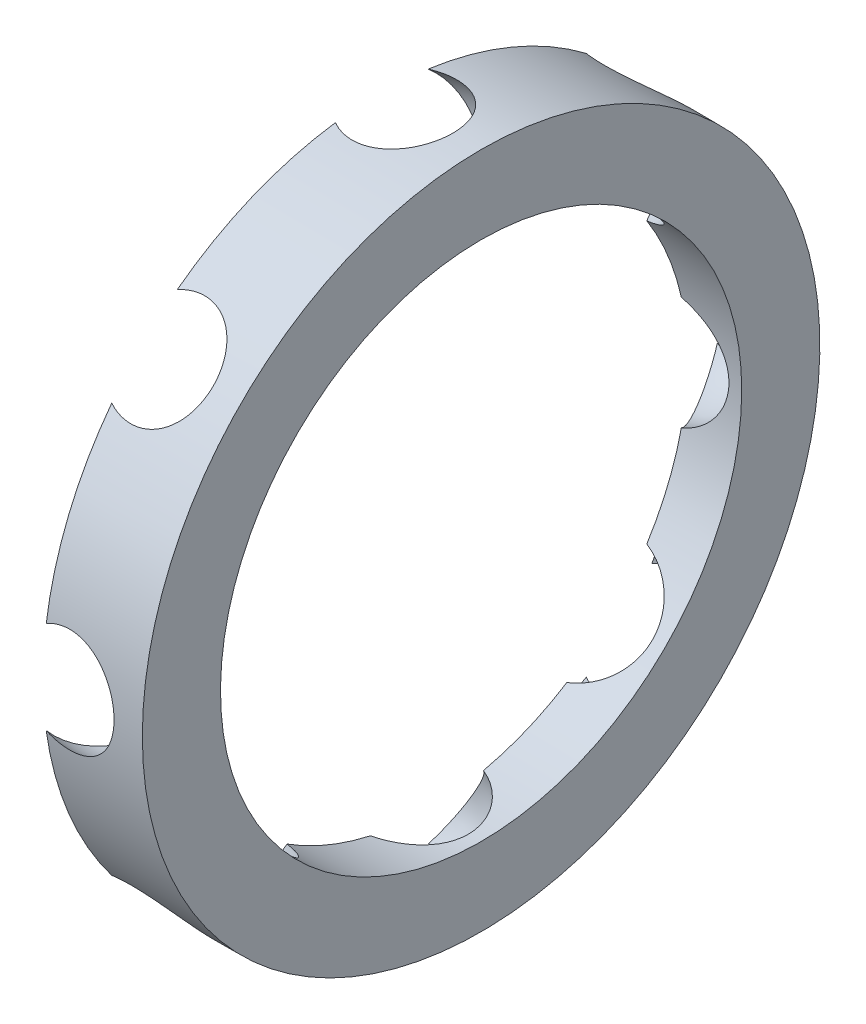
ISO-10303-21;
HEADER;
FILE_DESCRIPTION(('STEP AP214'),'2;1');
FILE_NAME('part.step','',(''),(''),'','','');
FILE_SCHEMA(('AUTOMOTIVE_DESIGN { 1 0 10303 214 1 1 1 1 }'));
ENDSEC;
DATA;
#1=APPLICATION_CONTEXT('core data for automotive mechanical design processes');
#2=APPLICATION_PROTOCOL_DEFINITION('international standard','automotive_design',2000,#1);
#3=PRODUCT_CONTEXT('',#1,'mechanical');
#4=PRODUCT('Part','Part','',(#3));
#5=PRODUCT_RELATED_PRODUCT_CATEGORY('part','',(#4));
#6=PRODUCT_DEFINITION_FORMATION('','',#4);
#7=PRODUCT_DEFINITION_CONTEXT('part definition',#1,'design');
#8=PRODUCT_DEFINITION('design','',#6,#7);
#9=PRODUCT_DEFINITION_SHAPE('','',#8);
#10=(LENGTH_UNIT() NAMED_UNIT(*) SI_UNIT(.MILLI.,.METRE.));
#11=(NAMED_UNIT(*) PLANE_ANGLE_UNIT() SI_UNIT($,.RADIAN.));
#12=(NAMED_UNIT(*) SI_UNIT($,.STERADIAN.) SOLID_ANGLE_UNIT());
#13=UNCERTAINTY_MEASURE_WITH_UNIT(LENGTH_MEASURE(1.E-05),#10,'distance_accuracy_value','');
#14=(GEOMETRIC_REPRESENTATION_CONTEXT(3) GLOBAL_UNCERTAINTY_ASSIGNED_CONTEXT((#13)) GLOBAL_UNIT_ASSIGNED_CONTEXT((#10,
#11,#12)) REPRESENTATION_CONTEXT('',''));
#15=CARTESIAN_POINT('',(0.,0.,0.));
#16=DIRECTION('',(0.,0.,1.));
#17=DIRECTION('',(1.,0.,0.));
#18=AXIS2_PLACEMENT_3D('',#15,#16,#17);
#19=DIRECTION('',(-0.499999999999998,0.86602540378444,0.));
#20=VECTOR('',#19,1.);
#21=CARTESIAN_POINT('',(7.,17.398,0.));
#22=LINE('',#21,#20);
#23=CARTESIAN_POINT('',(17.0447399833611,0.,0.));
#24=DIRECTION('',(-1.,0.,0.));
#25=AXIS1_PLACEMENT('',#23,#24);
#26=SURFACE_OF_REVOLUTION('',#22,#25);
#27=CARTESIAN_POINT('',(5.69056958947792,15.6763966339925,-11.8744323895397));
#28=CARTESIAN_POINT('',(5.72285650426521,15.6883003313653,-11.7661060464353));
#29=CARTESIAN_POINT('',(5.75682563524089,15.6956970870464,-11.6577878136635));
#30=CARTESIAN_POINT('',(5.8279645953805,15.7015071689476,-11.4419685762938));
#31=CARTESIAN_POINT('',(5.86513431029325,15.6999208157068,-11.3344675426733));
#32=CARTESIAN_POINT('',(5.94249116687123,15.6877994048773,-11.121136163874));
#33=CARTESIAN_POINT('',(5.98267659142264,15.6772694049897,-11.0153049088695));
#34=CARTESIAN_POINT('',(6.06589674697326,15.6473801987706,-10.8060383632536));
#35=CARTESIAN_POINT('',(6.10893143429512,15.6280211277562,-10.702603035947));
#36=CARTESIAN_POINT('',(6.19766353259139,15.5806358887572,-10.4988583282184));
#37=CARTESIAN_POINT('',(6.24336196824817,15.5526063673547,-10.3985501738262));
#38=CARTESIAN_POINT('',(6.33719825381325,15.4881053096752,-10.2018164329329));
#39=CARTESIAN_POINT('',(6.38533699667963,15.4516306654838,-10.1053922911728));
#40=CARTESIAN_POINT('',(6.48375942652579,15.3705655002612,-9.91725130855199));
#41=CARTESIAN_POINT('',(6.53404171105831,15.3259802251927,-9.82553147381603));
#42=CARTESIAN_POINT('',(6.63652898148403,15.2290121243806,-9.64739173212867));
#43=CARTESIAN_POINT('',(6.68873462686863,15.1766266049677,-9.5609736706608));
#44=CARTESIAN_POINT('',(6.79460635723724,15.0646369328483,-9.39436518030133));
#45=CARTESIAN_POINT('',(6.8482677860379,15.0050540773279,-9.31415747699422));
#46=CARTESIAN_POINT('',(6.95688156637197,14.8790019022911,-9.16029525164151));
#47=CARTESIAN_POINT('',(7.01183391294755,14.8125326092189,-9.08664070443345));
#48=CARTESIAN_POINT('',(7.1227240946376,14.6731648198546,-8.94639504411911));
#49=CARTESIAN_POINT('',(7.17866247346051,14.6002626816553,-8.87980797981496));
#50=CARTESIAN_POINT('',(7.29111278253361,14.4486271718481,-8.75426236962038));
#51=CARTESIAN_POINT('',(7.34762450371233,14.3698958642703,-8.69530114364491));
#52=CARTESIAN_POINT('',(7.46067615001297,14.2074121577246,-8.58558695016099));
#53=CARTESIAN_POINT('',(7.51721541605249,14.1236764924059,-8.53480851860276));
#54=CARTESIAN_POINT('',(7.63007659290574,13.9515887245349,-8.4416144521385));
#55=CARTESIAN_POINT('',(7.68639857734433,13.8632383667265,-8.39919568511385));
#56=CARTESIAN_POINT('',(7.79836841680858,13.682601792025,-8.3230267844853));
#57=CARTESIAN_POINT('',(7.85401686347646,13.5903194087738,-8.28926842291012));
#58=CARTESIAN_POINT('',(7.96423375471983,13.402410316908,-8.23059863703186));
#59=CARTESIAN_POINT('',(8.01880266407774,13.3067850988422,-8.20568332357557));
#60=CARTESIAN_POINT('',(8.11310481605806,13.1368180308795,-8.16988234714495));
#61=CARTESIAN_POINT('',(8.15316881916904,13.0630627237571,-8.15705079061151));
#62=CARTESIAN_POINT('',(8.23217123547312,12.9144161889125,-8.13651540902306));
#63=CARTESIAN_POINT('',(8.27111150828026,12.8395271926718,-8.12880258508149));
#64=CARTESIAN_POINT('',(8.30943041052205,12.7641390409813,-8.12364785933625));
#65=B_SPLINE_CURVE_WITH_KNOTS('',3,(#27,#28,#29,#30,#31,#32,#33,#34,#35,#36,#37,#38,#39,#40,#41,
#42,#43,#44,#45,#46,#47,#48,#49,#50,#51,#52,#53,#54,#55,#56,#57,#58,#59,#60,#61,#62,#63,#64),
.UNSPECIFIED.,.F.,.F.,(4,2,2,2,2,2,2,2,2,2,2,2,2,2,2,2,2,2,4),(0.,0.340878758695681,
0.681745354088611,1.02241931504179,1.36308805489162,1.70388871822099,2.04481500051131,
2.38552155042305,2.72634603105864,3.06618562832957,3.40602392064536,3.74605585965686,
4.08596796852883,4.42480097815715,4.76350679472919,5.10188961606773,5.44012343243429,
5.69468940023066,5.94880663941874),.UNSPECIFIED.);
#66=CARTESIAN_POINT('',(5.69056958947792,15.6763966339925,-11.8744323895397));
#67=VERTEX_POINT('',#66);
#68=CARTESIAN_POINT('',(8.30943041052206,12.7641390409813,-8.12364785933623));
#69=VERTEX_POINT('',#68);
#70=EDGE_CURVE('E11',#67,#69,#65,.T.);
#71=ORIENTED_EDGE('',*,*,#70,.T.);
#72=CARTESIAN_POINT('',(8.30943041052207,0.,0.));
#73=DIRECTION('',(-1.,0.,0.));
#74=DIRECTION('',(0.,1.,0.));
#75=AXIS2_PLACEMENT_3D('',#72,#73,#74);
#76=CIRCLE('',#75,15.13);
#77=CARTESIAN_POINT('',(8.30943041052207,14.769895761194,-3.28132278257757));
#78=VERTEX_POINT('',#77);
#79=EDGE_CURVE('E318',#78,#69,#76,.T.);
#80=ORIENTED_EDGE('',*,*,#79,.F.);
#81=CARTESIAN_POINT('',(8.30943041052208,14.769895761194,-3.28132278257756));
#82=CARTESIAN_POINT('',(8.25081269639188,14.8570027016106,-3.35730417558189));
#83=CARTESIAN_POINT('',(8.19073656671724,14.9475470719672,-3.42821384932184));
#84=CARTESIAN_POINT('',(8.06834418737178,15.1347343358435,-3.55932890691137));
#85=CARTESIAN_POINT('',(8.00602713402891,15.2313794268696,-3.61953040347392));
#86=CARTESIAN_POINT('',(7.88021491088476,15.4293895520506,-3.72831680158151));
#87=CARTESIAN_POINT('',(7.81672795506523,15.5307261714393,-3.77696288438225));
#88=CARTESIAN_POINT('',(7.68894798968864,15.7376376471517,-3.86258814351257));
#89=CARTESIAN_POINT('',(7.62465538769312,15.8432104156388,-3.8995729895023));
#90=CARTESIAN_POINT('',(7.48244732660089,16.0800270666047,-3.96800950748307));
#91=CARTESIAN_POINT('',(7.40447842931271,16.2120450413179,-3.99671246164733));
#92=CARTESIAN_POINT('',(7.24926951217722,16.4791553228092,-4.03624818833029));
#93=CARTESIAN_POINT('',(7.17202975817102,16.6142486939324,-4.04707467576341));
#94=CARTESIAN_POINT('',(6.9847112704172,16.946977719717,-4.05147850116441));
#95=CARTESIAN_POINT('',(6.87553349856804,17.145340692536,-4.03507384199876));
#96=CARTESIAN_POINT('',(6.66330493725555,17.5388275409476,-3.96461838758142));
#97=CARTESIAN_POINT('',(6.56026093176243,17.7339476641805,-3.91052672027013));
#98=CARTESIAN_POINT('',(6.36265961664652,18.1148555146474,-3.76625798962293));
#99=CARTESIAN_POINT('',(6.26810060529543,18.3006451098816,-3.676088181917));
#100=CARTESIAN_POINT('',(6.08940317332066,18.6571781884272,-3.46223545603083));
#101=CARTESIAN_POINT('',(6.00525451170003,18.827936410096,-3.33858586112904));
#102=CARTESIAN_POINT('',(5.88386420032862,19.0774235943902,-3.12338639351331));
#103=CARTESIAN_POINT('',(5.84245172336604,19.1632071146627,-3.04214697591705));
#104=CARTESIAN_POINT('',(5.76355079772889,19.3277107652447,-2.87135578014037));
#105=CARTESIAN_POINT('',(5.72605594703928,19.4064423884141,-2.78181802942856));
#106=CARTESIAN_POINT('',(5.69056958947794,19.4813780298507,-2.68839469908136));
#107=B_SPLINE_CURVE_WITH_KNOTS('',3,(#81,#82,#83,#84,#85,#86,#87,#88,#89,#90,#91,#92,#93,#94,
#95,#96,#97,#98,#99,#100,#101,#102,#103,#104,#105,#106),.UNSPECIFIED.,.F.,.F.,(4,2,2,2,2,2,2,2,
2,2,2,2,4),(0.,0.388652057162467,0.777444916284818,1.16413095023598,1.55062868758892,
2.01747554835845,2.48448651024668,3.16212827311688,3.84050609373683,4.51874755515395,
5.19631641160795,5.57142069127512,5.94590207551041),.UNSPECIFIED.);
#108=CARTESIAN_POINT('',(5.69056958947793,19.4813780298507,-2.68839469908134));
#109=VERTEX_POINT('',#108);
#110=EDGE_CURVE('E34',#78,#109,#107,.T.);
#111=ORIENTED_EDGE('',*,*,#110,.T.);
#112=CARTESIAN_POINT('',(5.69056958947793,0.,0.));
#113=DIRECTION('',(-1.,0.,0.));
#114=DIRECTION('',(0.,1.,0.));
#115=AXIS2_PLACEMENT_3D('',#112,#113,#114);
#116=CIRCLE('',#115,19.666);
#117=EDGE_CURVE('E313',#109,#67,#116,.T.);
#118=ORIENTED_EDGE('',*,*,#117,.T.);
#119=EDGE_LOOP('',(#71,#80,#111,#118));
#120=FACE_BOUND('',#119,.T.);
#121=ADVANCED_FACE('F17',(#120),#26,.F.);
#122=CARTESIAN_POINT('',(11.455,17.398,0.));
#123=DIRECTION('',(1.,0.,0.));
#124=DIRECTION('',(0.,0.,-1.));
#125=AXIS2_PLACEMENT_3D('',#122,#123,#124);
#126=PLANE('',#125);
#127=CARTESIAN_POINT('',(11.455,0.,0.));
#128=DIRECTION('',(-1.,0.,0.));
#129=DIRECTION('',(0.,1.,0.));
#130=AXIS2_PLACEMENT_3D('',#127,#128,#129);
#131=CIRCLE('',#130,15.13);
#132=CARTESIAN_POINT('',(11.455,15.13,0.));
#133=VERTEX_POINT('',#132);
#134=EDGE_CURVE('E317',#133,#133,#131,.T.);
#135=ORIENTED_EDGE('',*,*,#134,.T.);
#136=EDGE_LOOP('',(#135));
#137=FACE_BOUND('',#136,.T.);
#138=CARTESIAN_POINT('',(11.455,0.,0.));
#139=DIRECTION('',(-1.,0.,0.));
#140=DIRECTION('',(0.,1.,0.));
#141=AXIS2_PLACEMENT_3D('',#138,#139,#140);
#142=CIRCLE('',#141,19.666);
#143=CARTESIAN_POINT('',(11.455,19.666,0.));
#144=VERTEX_POINT('',#143);
#145=EDGE_CURVE('E181',#144,#144,#142,.T.);
#146=ORIENTED_EDGE('',*,*,#145,.F.);
#147=EDGE_LOOP('',(#146));
#148=FACE_BOUND('',#147,.T.);
#149=ADVANCED_FACE('F526',(#137,#148),#126,.T.);
#150=DIRECTION('',(-0.499999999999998,0.86602540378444,0.));
#151=VECTOR('',#150,1.);
#152=CARTESIAN_POINT('',(7.,17.398,0.));
#153=LINE('',#152,#151);
#154=CARTESIAN_POINT('',(17.0447399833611,0.,0.));
#155=DIRECTION('',(-1.,0.,0.));
#156=AXIS1_PLACEMENT('',#154,#155);
#157=SURFACE_OF_REVOLUTION('',#153,#156);
#158=CARTESIAN_POINT('',(8.30943041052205,12.7641390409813,8.12364785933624));
#159=CARTESIAN_POINT('',(8.25089925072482,12.8792899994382,8.13150264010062));
#160=CARTESIAN_POINT('',(8.19091302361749,12.993289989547,8.14535764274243));
#161=CARTESIAN_POINT('',(8.06872326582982,13.2180124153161,8.18490882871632));
#162=CARTESIAN_POINT('',(8.00651955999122,13.3287345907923,8.21060594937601));
#163=CARTESIAN_POINT('',(7.88073701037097,13.5456660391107,8.27361076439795));
#164=CARTESIAN_POINT('',(7.81716152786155,13.6518847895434,8.3108925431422));
#165=CARTESIAN_POINT('',(7.6891731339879,13.8590992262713,8.39675919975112));
#166=CARTESIAN_POINT('',(7.624760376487,13.9600958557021,8.44534202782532));
#167=CARTESIAN_POINT('',(7.50380197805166,14.1436907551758,8.54660816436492));
#168=CARTESIAN_POINT('',(7.44728008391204,14.2270101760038,8.59801845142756));
#169=CARTESIAN_POINT('',(7.33445379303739,14.388388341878,8.70880519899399));
#170=CARTESIAN_POINT('',(7.27814947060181,14.466445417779,8.76818416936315));
#171=CARTESIAN_POINT('',(7.16620749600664,14.6166338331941,8.89440551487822));
#172=CARTESIAN_POINT('',(7.11056930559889,14.688770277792,8.96124134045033));
#173=CARTESIAN_POINT('',(7.0002450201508,14.8266891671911,9.10195040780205));
#174=CARTESIAN_POINT('',(6.94555926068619,14.8924694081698,9.17582607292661));
#175=CARTESIAN_POINT('',(6.8375716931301,15.0170661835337,9.3299327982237));
#176=CARTESIAN_POINT('',(6.78426796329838,15.0758928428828,9.41015432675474));
#177=CARTESIAN_POINT('',(6.6792679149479,15.1862531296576,9.57645226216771));
#178=CARTESIAN_POINT('',(6.62757160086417,15.2377867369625,9.66252868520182));
#179=CARTESIAN_POINT('',(6.52603029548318,15.3332059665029,9.83996799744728));
#180=CARTESIAN_POINT('',(6.47618681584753,15.3770854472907,9.93133505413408));
#181=CARTESIAN_POINT('',(6.37867403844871,15.4567912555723,10.118582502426));
#182=CARTESIAN_POINT('',(6.33100400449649,15.4926203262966,10.2144613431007));
#183=CARTESIAN_POINT('',(6.23785488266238,15.5560995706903,10.4104844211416));
#184=CARTESIAN_POINT('',(6.19238641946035,15.583712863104,10.5106456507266));
#185=CARTESIAN_POINT('',(6.10410624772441,15.6303077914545,10.714052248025));
#186=CARTESIAN_POINT('',(6.06129355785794,15.6492926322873,10.8172964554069));
#187=CARTESIAN_POINT('',(5.97856737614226,15.6784574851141,11.0259901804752));
#188=CARTESIAN_POINT('',(5.93864995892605,15.6886496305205,11.1314364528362));
#189=CARTESIAN_POINT('',(5.86184622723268,15.7001636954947,11.3438564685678));
#190=CARTESIAN_POINT('',(5.82495829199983,15.7014903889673,11.4508293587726));
#191=CARTESIAN_POINT('',(5.7723631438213,15.6968399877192,11.6107936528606));
#192=CARTESIAN_POINT('',(5.75544382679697,15.6942411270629,11.6635070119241));
#193=CARTESIAN_POINT('',(5.72240850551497,15.6869129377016,11.7689551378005));
#194=CARTESIAN_POINT('',(5.70629140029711,15.6821866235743,11.8216897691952));
#195=CARTESIAN_POINT('',(5.69056958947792,15.6763966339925,11.8744323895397));
#196=B_SPLINE_CURVE_WITH_KNOTS('',3,(#158,#159,#160,#161,#162,#163,#164,#165,#166,#167,#168,
#169,#170,#171,#172,#173,#174,#175,#176,#177,#178,#179,#180,#181,#182,#183,#184,#185,#186,#187,
#188,#189,#190,#191,#192,#193,#194,#195),.UNSPECIFIED.,.F.,.F.,(4,2,2,2,2,2,2,2,2,2,2,2,2,2,2,2,
2,2,4),(0.,0.388082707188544,0.776196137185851,1.16344750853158,1.55062869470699,
1.88937995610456,2.22823816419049,2.56680105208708,2.90548090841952,3.24366138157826,
3.5818427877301,3.92029430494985,4.25863031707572,4.59846299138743,4.93816933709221,
5.27740615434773,5.61646028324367,5.78268938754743,5.94868368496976),.UNSPECIFIED.);
#197=CARTESIAN_POINT('',(8.30943041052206,12.7641390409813,8.12364785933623));
#198=VERTEX_POINT('',#197);
#199=CARTESIAN_POINT('',(5.69056958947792,15.6763966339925,11.8744323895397));
#200=VERTEX_POINT('',#199);
#201=EDGE_CURVE('E333',#198,#200,#196,.T.);
#202=ORIENTED_EDGE('',*,*,#201,.T.);
#203=CARTESIAN_POINT('',(5.69056958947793,0.,0.));
#204=DIRECTION('',(-1.,0.,0.));
#205=DIRECTION('',(0.,1.,0.));
#206=AXIS2_PLACEMENT_3D('',#203,#204,#205);
#207=CIRCLE('',#206,19.666);
#208=CARTESIAN_POINT('',(5.69056958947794,19.4813780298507,2.68839469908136));
#209=VERTEX_POINT('',#208);
#210=EDGE_CURVE('E329',#200,#209,#207,.T.);
#211=ORIENTED_EDGE('',*,*,#210,.T.);
#212=CARTESIAN_POINT('',(5.69056958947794,19.4813780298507,2.68839469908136));
#213=CARTESIAN_POINT('',(5.72283407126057,19.4132442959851,2.77335104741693));
#214=CARTESIAN_POINT('',(5.75677839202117,19.3419339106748,2.85511919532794));
#215=CARTESIAN_POINT('',(5.82786429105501,19.1935445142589,3.01173737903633));
#216=CARTESIAN_POINT('',(5.86500583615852,19.1164655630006,3.0865874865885));
#217=CARTESIAN_POINT('',(5.94235537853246,18.957058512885,3.22888658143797));
#218=CARTESIAN_POINT('',(5.98256580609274,18.8747262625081,3.29632959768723));
#219=CARTESIAN_POINT('',(6.0658390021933,18.7055081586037,3.42326587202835));
#220=CARTESIAN_POINT('',(6.10890165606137,18.6186224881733,3.48275944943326));
#221=CARTESIAN_POINT('',(6.19770960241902,18.4408950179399,3.59341675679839));
#222=CARTESIAN_POINT('',(6.24345689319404,18.350050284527,3.64457417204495));
#223=CARTESIAN_POINT('',(6.33737815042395,18.1651653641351,3.73813843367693));
#224=CARTESIAN_POINT('',(6.38555211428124,18.0711251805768,3.78054528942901));
#225=CARTESIAN_POINT('',(6.48398993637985,17.8807439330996,3.85623431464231));
#226=CARTESIAN_POINT('',(6.53424982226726,17.7844073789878,3.88953298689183));
#227=CARTESIAN_POINT('',(6.63665276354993,17.5900410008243,3.94685908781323));
#228=CARTESIAN_POINT('',(6.68879518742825,17.492011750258,3.97088959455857));
#229=CARTESIAN_POINT('',(6.79910178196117,17.2867619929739,4.01112617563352));
#230=CARTESIAN_POINT('',(6.85740615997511,17.1794549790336,4.02651553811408));
#231=CARTESIAN_POINT('',(6.97548873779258,16.9646590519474,4.04610442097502));
#232=CARTESIAN_POINT('',(7.03526706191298,16.8571701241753,4.05030299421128));
#233=CARTESIAN_POINT('',(7.20611842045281,16.5537100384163,4.04624935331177));
#234=CARTESIAN_POINT('',(7.31850919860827,16.358489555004,4.02474001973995));
#235=CARTESIAN_POINT('',(7.54401836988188,15.9760037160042,3.94442810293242));
#236=CARTESIAN_POINT('',(7.65713762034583,15.7887511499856,3.88556780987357));
#237=CARTESIAN_POINT('',(7.86239819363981,15.4571615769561,3.74473113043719));
#238=CARTESIAN_POINT('',(7.95495183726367,15.31080629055,3.66809082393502));
#239=CARTESIAN_POINT('',(8.09062951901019,15.1005834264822,3.53572606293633));
#240=CARTESIAN_POINT('',(8.13530374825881,15.0320996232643,3.48873759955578));
#241=CARTESIAN_POINT('',(8.22338218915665,14.8984461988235,3.38916887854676));
#242=CARTESIAN_POINT('',(8.26678626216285,14.8332769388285,3.33658801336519));
#243=CARTESIAN_POINT('',(8.30943041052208,14.769895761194,3.28132278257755));
#244=B_SPLINE_CURVE_WITH_KNOTS('',3,(#212,#213,#214,#215,#216,#217,#218,#219,#220,#221,#222,
#223,#224,#225,#226,#227,#228,#229,#230,#231,#232,#233,#234,#235,#236,#237,#238,#239,#240,#241,
#242,#243),.UNSPECIFIED.,.F.,.F.,(4,2,2,2,2,2,2,2,2,2,2,2,2,2,2,4),(0.,0.340641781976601,
0.681280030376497,1.02219089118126,1.36308805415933,1.70424226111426,2.04539610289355,
2.38592766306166,2.72634603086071,3.09506918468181,3.46382354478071,4.13922426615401,
4.81567107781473,5.38178835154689,5.66450348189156,5.94724935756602),.UNSPECIFIED.);
#245=CARTESIAN_POINT('',(8.30943041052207,14.769895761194,3.28132278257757));
#246=VERTEX_POINT('',#245);
#247=EDGE_CURVE('E334',#209,#246,#244,.T.);
#248=ORIENTED_EDGE('',*,*,#247,.T.);
#249=CARTESIAN_POINT('',(8.30943041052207,0.,0.));
#250=DIRECTION('',(-1.,0.,0.));
#251=DIRECTION('',(0.,1.,0.));
#252=AXIS2_PLACEMENT_3D('',#249,#250,#251);
#253=CIRCLE('',#252,15.13);
#254=EDGE_CURVE('E324',#198,#246,#253,.T.);
#255=ORIENTED_EDGE('',*,*,#254,.F.);
#256=EDGE_LOOP('',(#202,#211,#248,#255));
#257=FACE_BOUND('',#256,.T.);
#258=ADVANCED_FACE('F523',(#257),#157,.F.);
#259=DIRECTION('',(-0.499999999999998,0.86602540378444,0.));
#260=VECTOR('',#259,1.);
#261=CARTESIAN_POINT('',(7.,17.398,0.));
#262=LINE('',#261,#260);
#263=CARTESIAN_POINT('',(17.0447399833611,0.,0.));
#264=DIRECTION('',(-1.,0.,0.));
#265=AXIS1_PLACEMENT('',#263,#264);
#266=SURFACE_OF_REVOLUTION('',#262,#265);
#267=CARTESIAN_POINT('',(5.69056958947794,2.68839469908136,-19.4813780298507));
#268=CARTESIAN_POINT('',(5.72285650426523,2.77341017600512,-19.413196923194));
#269=CARTESIAN_POINT('',(5.75682563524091,2.85523302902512,-19.3418346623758));
#270=CARTESIAN_POINT('',(5.82796459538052,3.01194862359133,-19.1933357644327));
#271=CARTESIAN_POINT('',(5.86513431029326,3.08684161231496,-19.1161993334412));
#272=CARTESIAN_POINT('',(5.94249116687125,3.22911854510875,-18.9567801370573));
#273=CARTESIAN_POINT('',(5.98267659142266,3.2965067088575,-18.8745003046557));
#274=CARTESIAN_POINT('',(6.06589674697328,3.42334564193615,-18.7053916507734));
#275=CARTESIAN_POINT('',(6.10893143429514,3.4827965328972,-18.6185628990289));
#276=CARTESIAN_POINT('',(6.19766353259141,3.59335937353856,-18.4409872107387));
#277=CARTESIAN_POINT('',(6.24336196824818,3.64446808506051,-18.3502387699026));
#278=CARTESIAN_POINT('',(6.33719825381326,3.73797071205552,-18.1655178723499));
#279=CARTESIAN_POINT('',(6.38533699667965,3.78036140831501,-18.0715442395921));
#280=CARTESIAN_POINT('',(6.48375942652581,3.85607544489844,-17.881186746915));
#281=CARTESIAN_POINT('',(6.53404171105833,3.8894046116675,-17.7848044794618));
#282=CARTESIAN_POINT('',(6.63652898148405,3.94680162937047,-17.5902738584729));
#283=CARTESIAN_POINT('',(6.68873462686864,3.97086627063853,-17.4921249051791));
#284=CARTESIAN_POINT('',(6.79460635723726,4.00948760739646,-17.2951262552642));
#285=CARTESIAN_POINT('',(6.84826778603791,4.02407157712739,-17.1962794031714));
#286=CARTESIAN_POINT('',(6.95688156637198,4.04373625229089,-16.9983500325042));
#287=CARTESIAN_POINT('',(7.01183391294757,4.04881699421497,-16.8992675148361));
#288=CARTESIAN_POINT('',(7.12272409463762,4.04943774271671,-16.7015509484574));
#289=CARTESIAN_POINT('',(7.17866247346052,4.04497231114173,-16.6029171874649));
#290=CARTESIAN_POINT('',(7.29111278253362,4.02652396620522,-16.4069205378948));
#291=CARTESIAN_POINT('',(7.34762450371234,4.01254440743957,-16.3095572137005));
#292=CARTESIAN_POINT('',(7.46067615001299,3.97523072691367,-16.1170842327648));
#293=CARTESIAN_POINT('',(7.5172154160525,3.95192644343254,-16.021968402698));
#294=CARTESIAN_POINT('',(7.63007659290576,3.89614017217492,-15.8343858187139));
#295=CARTESIAN_POINT('',(7.68639857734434,3.86366163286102,-15.7419180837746));
#296=CARTESIAN_POINT('',(7.79836841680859,3.78979183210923,-15.5603291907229));
#297=CARTESIAN_POINT('',(7.85401686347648,3.74840909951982,-15.4712049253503));
#298=CARTESIAN_POINT('',(7.96423375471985,3.65702310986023,-15.2968473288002));
#299=CARTESIAN_POINT('',(8.01880266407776,3.60702365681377,-15.2116123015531));
#300=CARTESIAN_POINT('',(8.11310481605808,3.51215390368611,-15.066112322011));
#301=CARTESIAN_POINT('',(8.15316881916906,3.46907430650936,-15.0048861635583));
#302=CARTESIAN_POINT('',(8.23217123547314,3.37848604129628,-14.8852564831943));
#303=CARTESIAN_POINT('',(8.27111150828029,3.33098531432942,-14.8268481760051));
#304=CARTESIAN_POINT('',(8.30943041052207,3.28132278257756,-14.769895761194));
#305=B_SPLINE_CURVE_WITH_KNOTS('',3,(#267,#268,#269,#270,#271,#272,#273,#274,#275,#276,#277,
#278,#279,#280,#281,#282,#283,#284,#285,#286,#287,#288,#289,#290,#291,#292,#293,#294,#295,#296,
#297,#298,#299,#300,#301,#302,#303,#304),.UNSPECIFIED.,.F.,.F.,(4,2,2,2,2,2,2,2,2,2,2,2,2,2,2,2,
2,2,4),(0.,0.340878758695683,0.681745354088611,1.02241931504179,1.36308805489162,
1.70388871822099,2.0448150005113,2.38552155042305,2.72634603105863,3.06618562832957,
3.40602392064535,3.74605585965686,4.08596796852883,4.42480097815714,4.76350679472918,
5.10188961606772,5.44012343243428,5.69468940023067,5.94880663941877),.UNSPECIFIED.);
#306=CARTESIAN_POINT('',(5.69056958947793,2.68839469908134,-19.4813780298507));
#307=VERTEX_POINT('',#306);
#308=CARTESIAN_POINT('',(8.30943041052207,3.28132278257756,-14.769895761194));
#309=VERTEX_POINT('',#308);
#310=EDGE_CURVE('E677',#307,#309,#305,.T.);
#311=ORIENTED_EDGE('',*,*,#310,.T.);
#312=CARTESIAN_POINT('',(8.30943041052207,0.,0.));
#313=DIRECTION('',(-1.,0.,0.));
#314=DIRECTION('',(0.,1.,0.));
#315=AXIS2_PLACEMENT_3D('',#312,#313,#314);
#316=CIRCLE('',#315,15.13);
#317=CARTESIAN_POINT('',(8.30943041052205,8.12364785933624,-12.7641390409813));
#318=VERTEX_POINT('',#317);
#319=EDGE_CURVE('E341',#318,#309,#316,.T.);
#320=ORIENTED_EDGE('',*,*,#319,.F.);
#321=CARTESIAN_POINT('',(8.30943041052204,8.12364785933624,-12.7641390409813));
#322=CARTESIAN_POINT('',(8.25089944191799,8.13150261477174,-12.8792896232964));
#323=CARTESIAN_POINT('',(8.19091341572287,8.14535755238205,-12.9932892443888));
#324=CARTESIAN_POINT('',(8.06872407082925,8.18490853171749,-13.2180109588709));
#325=CARTESIAN_POINT('',(8.00652057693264,8.21060551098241,-13.3287327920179));
#326=CARTESIAN_POINT('',(7.8807380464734,8.27361017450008,-13.545664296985));
#327=CARTESIAN_POINT('',(7.81716236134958,8.31089201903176,-13.6518834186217));
#328=CARTESIAN_POINT('',(7.68917355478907,8.3967588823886,-13.8590985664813));
#329=CARTESIAN_POINT('',(7.62476058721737,8.44534185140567,-13.9600955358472));
#330=CARTESIAN_POINT('',(7.50380175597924,8.54660835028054,-14.1436910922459));
#331=CARTESIAN_POINT('',(7.44727963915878,8.59801885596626,-14.2270108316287));
#332=CARTESIAN_POINT('',(7.33445290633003,8.70880610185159,-14.3883895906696));
#333=CARTESIAN_POINT('',(7.27814836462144,8.76818535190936,-14.4664469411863));
#334=CARTESIAN_POINT('',(7.16620639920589,8.89440681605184,-14.6166352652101));
#335=CARTESIAN_POINT('',(7.11056843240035,8.961242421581,-14.6887713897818));
#336=CARTESIAN_POINT('',(7.00024458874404,9.1019509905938,-14.8266896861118));
#337=CARTESIAN_POINT('',(6.94555904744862,9.17582637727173,-14.8924696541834));
#338=CARTESIAN_POINT('',(6.83757237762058,9.32993182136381,-15.0170653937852));
#339=CARTESIAN_POINT('',(6.78426931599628,9.41015229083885,-15.075891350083));
#340=CARTESIAN_POINT('',(6.67927055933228,9.57644796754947,-15.1862504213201));
#341=CARTESIAN_POINT('',(6.62757486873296,9.66252319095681,-15.2377835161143));
#342=CARTESIAN_POINT('',(6.5260334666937,9.83996223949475,-15.3332031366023));
#343=CARTESIAN_POINT('',(6.47618931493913,9.93133036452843,-15.3770833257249));
#344=CARTESIAN_POINT('',(6.37867524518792,10.118580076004,-15.4567903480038));
#345=CARTESIAN_POINT('',(6.33100459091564,10.2144601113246,-15.4926199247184));
#346=CARTESIAN_POINT('',(6.23785273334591,10.4104889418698,-15.5561010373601));
#347=CARTESIAN_POINT('',(6.19238223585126,10.5106548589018,-15.5837154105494));
#348=CARTESIAN_POINT('',(6.10409825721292,10.7140710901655,-15.6303116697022));
#349=CARTESIAN_POINT('',(6.06128379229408,10.8173202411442,-15.6492967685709));
#350=CARTESIAN_POINT('',(5.97855783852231,11.0260150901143,-15.6784601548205));
#351=CARTESIAN_POINT('',(5.93864219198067,11.131457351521,-15.6886512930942));
#352=CARTESIAN_POINT('',(5.86184205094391,11.3438686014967,-15.7001638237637));
#353=CARTESIAN_POINT('',(5.82495588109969,11.450836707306,-15.7014901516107));
#354=CARTESIAN_POINT('',(5.77402468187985,11.6057401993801,-15.696986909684));
#355=CARTESIAN_POINT('',(5.75869694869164,11.6533835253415,-15.6947304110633));
#356=CARTESIAN_POINT('',(5.72869736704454,11.7486927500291,-15.6884761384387));
#357=CARTESIAN_POINT('',(5.7140246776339,11.7963585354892,-15.684480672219));
#358=CARTESIAN_POINT('',(5.69967356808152,11.8440385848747,-15.6796156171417));
#359=B_SPLINE_CURVE_WITH_KNOTS('',3,(#321,#322,#323,#324,#325,#326,#327,#328,#329,#330,#331,
#332,#333,#334,#335,#336,#337,#338,#339,#340,#341,#342,#343,#344,#345,#346,#347,#348,#349,#350,
#351,#352,#353,#354,#355,#356,#357,#358),.UNSPECIFIED.,.F.,.F.,(4,2,2,2,2,2,2,2,2,2,2,2,2,2,2,2,
2,2,4),(0.,0.388081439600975,0.776193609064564,1.163446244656,1.55062869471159,1.88938128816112,
2.2282408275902,2.566802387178,2.90548090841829,3.24365709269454,3.58183421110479,
3.92029002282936,4.25863031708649,4.59847865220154,4.93820034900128,5.27742475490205,
5.61646028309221,5.76672896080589,5.91679882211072),.UNSPECIFIED.);
#360=CARTESIAN_POINT('',(5.69967356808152,11.8440385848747,-15.6796156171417));
#361=VERTEX_POINT('',#360);
#362=EDGE_CURVE('E351',#318,#361,#359,.T.);
#363=ORIENTED_EDGE('',*,*,#362,.T.);
#364=CARTESIAN_POINT('',(5.69967409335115,11.8440385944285,-15.6796141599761));
#365=CARTESIAN_POINT('',(5.69661953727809,11.8541860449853,-15.6785796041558));
#366=CARTESIAN_POINT('',(5.69358455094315,11.8643179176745,-15.677506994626));
#367=CARTESIAN_POINT('',(5.69056958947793,11.8744323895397,-15.6763966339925));
#368=B_SPLINE_CURVE_WITH_KNOTS('',3,(#364,#365,#366,#367),.UNSPECIFIED.,.F.,.F.,(4,4),
(14.4801673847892,14.5099400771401),.UNSPECIFIED.);
#369=CARTESIAN_POINT('',(5.69056958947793,11.8744323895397,-15.6763966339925));
#370=VERTEX_POINT('',#369);
#371=EDGE_CURVE('E339',#361,#370,#368,.T.);
#372=ORIENTED_EDGE('',*,*,#371,.T.);
#373=CARTESIAN_POINT('',(5.69056958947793,0.,0.));
#374=DIRECTION('',(-1.,0.,0.));
#375=DIRECTION('',(0.,1.,0.));
#376=AXIS2_PLACEMENT_3D('',#373,#374,#375);
#377=CIRCLE('',#376,19.666);
#378=EDGE_CURVE('E335',#370,#307,#377,.T.);
#379=ORIENTED_EDGE('',*,*,#378,.T.);
#380=EDGE_LOOP('',(#311,#320,#363,#372,#379));
#381=FACE_BOUND('',#380,.T.);
#382=ADVANCED_FACE('F454',(#381),#266,.F.);
#383=DIRECTION('',(-0.499999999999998,0.86602540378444,0.));
#384=VECTOR('',#383,1.);
#385=CARTESIAN_POINT('',(7.,17.398,0.));
#386=LINE('',#385,#384);
#387=CARTESIAN_POINT('',(17.0447399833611,0.,0.));
#388=DIRECTION('',(-1.,0.,0.));
#389=AXIS1_PLACEMENT('',#387,#388);
#390=SURFACE_OF_REVOLUTION('',#386,#389);
#391=CARTESIAN_POINT('',(5.69056958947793,-11.8744323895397,-15.6763966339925));
#392=CARTESIAN_POINT('',(5.69358455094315,-11.8643179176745,-15.677506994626));
#393=CARTESIAN_POINT('',(5.69661953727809,-11.8541860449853,-15.6785796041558));
#394=CARTESIAN_POINT('',(5.69967409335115,-11.8440385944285,-15.6796141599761));
#395=B_SPLINE_CURVE_WITH_KNOTS('',3,(#391,#392,#393,#394),.UNSPECIFIED.,.F.,.F.,(4,4),
(-4.0589103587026,-4.02913766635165),.UNSPECIFIED.);
#396=CARTESIAN_POINT('',(5.69056958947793,-11.8744323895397,-15.6763966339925));
#397=VERTEX_POINT('',#396);
#398=CARTESIAN_POINT('',(5.69967409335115,-11.8440385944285,-15.6796141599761));
#399=VERTEX_POINT('',#398);
#400=EDGE_CURVE('E340',#397,#399,#395,.T.);
#401=ORIENTED_EDGE('',*,*,#400,.T.);
#402=CARTESIAN_POINT('',(5.69967356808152,-11.8440385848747,-15.6796156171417));
#403=CARTESIAN_POINT('',(5.73227103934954,-11.7357246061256,-15.69067957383));
#404=CARTESIAN_POINT('',(5.76654396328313,-11.6274562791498,-15.6972348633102));
#405=CARTESIAN_POINT('',(5.83827529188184,-11.4118112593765,-15.7013646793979));
#406=CARTESIAN_POINT('',(5.87573358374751,-11.3044345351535,-15.6989395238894));
#407=CARTESIAN_POINT('',(5.95365079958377,-11.0914247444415,-15.6851496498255));
#408=CARTESIAN_POINT('',(5.99410803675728,-10.9857907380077,-15.6737899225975));
#409=CARTESIAN_POINT('',(6.07785319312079,-10.7769911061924,-15.6422558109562));
#410=CARTESIAN_POINT('',(6.12114106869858,-10.673825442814,-15.6220815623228));
#411=CARTESIAN_POINT('',(6.21035927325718,-10.4706905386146,-15.5730859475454));
#412=CARTESIAN_POINT('',(6.25629062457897,-10.3707225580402,-15.5442612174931));
#413=CARTESIAN_POINT('',(6.35057043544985,-10.1747375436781,-15.4781953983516));
#414=CARTESIAN_POINT('',(6.39891977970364,-10.0787219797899,-15.4409512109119));
#415=CARTESIAN_POINT('',(6.49773850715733,-9.89146389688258,-15.3583791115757));
#416=CARTESIAN_POINT('',(6.5482064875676,-9.80021830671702,-15.3130564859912));
#417=CARTESIAN_POINT('',(6.65103873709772,-9.62308886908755,-15.2146499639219));
#418=CARTESIAN_POINT('',(6.70340365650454,-9.53720688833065,-15.161563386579));
#419=CARTESIAN_POINT('',(6.80956272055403,-9.37172990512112,-15.048217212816));
#420=CARTESIAN_POINT('',(6.8633522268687,-9.29211721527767,-14.9879790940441));
#421=CARTESIAN_POINT('',(6.97219147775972,-9.13949708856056,-14.8606623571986));
#422=CARTESIAN_POINT('',(7.02724121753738,-9.0664896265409,-14.7935837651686));
#423=CARTESIAN_POINT('',(7.13829465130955,-8.92758387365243,-14.6530453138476));
#424=CARTESIAN_POINT('',(7.19429889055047,-8.86168981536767,-14.579581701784));
#425=CARTESIAN_POINT('',(7.30684600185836,-8.73757154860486,-14.4268764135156));
#426=CARTESIAN_POINT('',(7.36338867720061,-8.67934464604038,-14.3476367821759));
#427=CARTESIAN_POINT('',(7.47646838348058,-8.57112917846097,-14.1841892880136));
#428=CARTESIAN_POINT('',(7.53300488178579,-8.52111548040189,-14.0999976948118));
#429=CARTESIAN_POINT('',(7.64582191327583,-8.42948037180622,-13.9270554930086));
#430=CARTESIAN_POINT('',(7.70210253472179,-8.3878558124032,-13.8383066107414));
#431=CARTESIAN_POINT('',(7.81394532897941,-8.3133001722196,-13.6569389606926));
#432=CARTESIAN_POINT('',(7.86950817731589,-8.28036024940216,-13.564324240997));
#433=CARTESIAN_POINT('',(7.97951198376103,-8.22334232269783,-13.3758116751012));
#434=CARTESIAN_POINT('',(8.03395344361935,-8.19926027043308,-13.2799153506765));
#435=CARTESIAN_POINT('',(8.12549851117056,-8.16583712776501,-13.1140499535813));
#436=CARTESIAN_POINT('',(8.16299590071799,-8.15424383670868,-13.0447426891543));
#437=CARTESIAN_POINT('',(8.23698670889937,-8.13557141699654,-12.905148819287));
#438=CARTESIAN_POINT('',(8.27348174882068,-8.12848453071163,-12.8348641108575));
#439=CARTESIAN_POINT('',(8.30943041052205,-8.12364785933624,-12.7641390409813));
#440=B_SPLINE_CURVE_WITH_KNOTS('',3,(#402,#403,#404,#405,#406,#407,#408,#409,#410,#411,#412,
#413,#414,#415,#416,#417,#418,#419,#420,#421,#422,#423,#424,#425,#426,#427,#428,#429,#430,#431,
#432,#433,#434,#435,#436,#437,#438,#439),.UNSPECIFIED.,.F.,.F.,(4,2,2,2,2,2,2,2,2,2,2,2,2,2,2,2,
2,2,4),(0.,0.340854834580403,0.681697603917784,1.0223500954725,1.36299733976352,
1.70377722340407,2.04468271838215,2.3853659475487,2.72616709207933,3.06596946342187,
3.40577054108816,3.74577270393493,4.0856550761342,4.42447717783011,4.76317186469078,
5.10152037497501,5.43971405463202,5.67852849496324,5.91693070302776),.UNSPECIFIED.);
#441=CARTESIAN_POINT('',(8.30943041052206,-8.12364785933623,-12.7641390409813));
#442=VERTEX_POINT('',#441);
#443=EDGE_CURVE('E359',#399,#442,#440,.T.);
#444=ORIENTED_EDGE('',*,*,#443,.T.);
#445=CARTESIAN_POINT('',(8.30943041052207,0.,0.));
#446=DIRECTION('',(-1.,0.,0.));
#447=DIRECTION('',(0.,1.,0.));
#448=AXIS2_PLACEMENT_3D('',#445,#446,#447);
#449=CIRCLE('',#448,15.13);
#450=CARTESIAN_POINT('',(8.30943041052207,-3.28132278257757,-14.769895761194));
#451=VERTEX_POINT('',#450);
#452=EDGE_CURVE('E360',#451,#442,#449,.T.);
#453=ORIENTED_EDGE('',*,*,#452,.F.);
#454=CARTESIAN_POINT('',(8.30943041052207,-3.28132278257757,-14.769895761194));
#455=CARTESIAN_POINT('',(8.25089925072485,-3.35719263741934,-14.8568739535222));
#456=CARTESIAN_POINT('',(8.19091302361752,-3.42800583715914,-14.9472810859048));
#457=CARTESIAN_POINT('',(8.06872326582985,-3.55894167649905,-15.1341507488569));
#458=CARTESIAN_POINT('',(8.00651955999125,-3.61906346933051,-15.2306137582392));
#459=CARTESIAN_POINT('',(7.880737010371,-3.72790603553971,-15.4285585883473));
#460=CARTESIAN_POINT('',(7.81716152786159,-3.77665183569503,-15.5300287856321));
#461=CARTESIAN_POINT('',(7.68917313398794,-3.8624576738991,-15.7372684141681));
#462=CARTESIAN_POINT('',(7.62476037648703,-3.8995198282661,-15.8430370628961));
#463=CARTESIAN_POINT('',(7.50380197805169,-3.95773505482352,-16.044464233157));
#464=CARTESIAN_POINT('',(7.44728008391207,-3.98029821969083,-16.1397325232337));
#465=CARTESIAN_POINT('',(7.33445379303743,-4.01607175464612,-16.3321821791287));
#466=CARTESIAN_POINT('',(7.27814947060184,-4.02927916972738,-16.4293641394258));
#467=CARTESIAN_POINT('',(7.16620749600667,-4.04622644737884,-16.6248153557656));
#468=CARTESIAN_POINT('',(7.11056930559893,-4.0499745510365,-16.7230835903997));
#469=CARTESIAN_POINT('',(7.00024502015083,-4.04800159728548,-16.9201033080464));
#470=CARTESIAN_POINT('',(6.94555926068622,-4.04227726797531,-17.0188549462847));
#471=CARTESIAN_POINT('',(6.83757169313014,-4.02141058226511,-17.2159280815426));
#472=CARTESIAN_POINT('',(6.78426796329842,-4.00628212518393,-17.3142499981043));
#473=CARTESIAN_POINT('',(6.67926791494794,-3.9667282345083,-17.5098769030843));
#474=CARTESIAN_POINT('',(6.62757160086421,-3.94230277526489,-17.6071818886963));
#475=CARTESIAN_POINT('',(6.52603029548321,-3.88430581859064,-17.8001220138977));
#476=CARTESIAN_POINT('',(6.47618681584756,-3.85072703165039,-17.8957557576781));
#477=CARTESIAN_POINT('',(6.37867403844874,-3.77468360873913,-18.084520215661));
#478=CARTESIAN_POINT('',(6.33100400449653,-3.7322220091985,-18.1776517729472));
#479=CARTESIAN_POINT('',(6.23785488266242,-3.63849936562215,-18.3611476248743));
#480=CARTESIAN_POINT('',(6.19238641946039,-3.58720022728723,-18.4514978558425));
#481=CARTESIAN_POINT('',(6.10410624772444,-3.47631763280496,-18.6282756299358));
#482=CARTESIAN_POINT('',(6.06129355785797,-3.41673726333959,-18.7147046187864));
#483=CARTESIAN_POINT('',(5.97856737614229,-3.28979118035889,-18.8828960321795));
#484=CARTESIAN_POINT('',(5.93864995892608,-3.22243634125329,-18.9646647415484));
#485=CARTESIAN_POINT('',(5.86184622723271,-3.08037438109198,-19.1230100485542));
#486=CARTESIAN_POINT('',(5.82495829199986,-3.00567123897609,-19.1995894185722));
#487=CARTESIAN_POINT('',(5.77236314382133,-2.88927107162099,-19.3094129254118));
#488=CARTESIAN_POINT('',(5.75544382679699,-2.85015942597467,-19.3448492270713));
#489=CARTESIAN_POINT('',(5.72240850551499,-2.77041452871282,-19.4142304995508));
#490=CARTESIAN_POINT('',(5.70629140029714,-2.72978350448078,-19.4481775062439));
#491=CARTESIAN_POINT('',(5.69056958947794,-2.68839469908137,-19.4813780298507));
#492=B_SPLINE_CURVE_WITH_KNOTS('',3,(#454,#455,#456,#457,#458,#459,#460,#461,#462,#463,#464,
#465,#466,#467,#468,#469,#470,#471,#472,#473,#474,#475,#476,#477,#478,#479,#480,#481,#482,#483,
#484,#485,#486,#487,#488,#489,#490,#491),.UNSPECIFIED.,.F.,.F.,(4,2,2,2,2,2,2,2,2,2,2,2,2,2,2,2,
2,2,4),(0.,0.388082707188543,0.776196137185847,1.16344750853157,1.55062869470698,
1.88937995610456,2.22823816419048,2.56680105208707,2.9054809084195,3.24366138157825,
3.58184278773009,3.92029430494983,4.2586303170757,4.59846299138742,4.9381693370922,
5.27740615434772,5.61646028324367,5.78268938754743,5.94868368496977),.UNSPECIFIED.);
#493=CARTESIAN_POINT('',(5.69056958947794,-2.68839469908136,-19.4813780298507));
#494=VERTEX_POINT('',#493);
#495=EDGE_CURVE('E371',#451,#494,#492,.T.);
#496=ORIENTED_EDGE('',*,*,#495,.T.);
#497=CARTESIAN_POINT('',(5.69056958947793,0.,0.));
#498=DIRECTION('',(-1.,0.,0.));
#499=DIRECTION('',(0.,1.,0.));
#500=AXIS2_PLACEMENT_3D('',#497,#498,#499);
#501=CIRCLE('',#500,19.666);
#502=EDGE_CURVE('E368',#494,#397,#501,.T.);
#503=ORIENTED_EDGE('',*,*,#502,.T.);
#504=EDGE_LOOP('',(#401,#444,#453,#496,#503));
#505=FACE_BOUND('',#504,.T.);
#506=ADVANCED_FACE('F449',(#505),#390,.F.);
#507=DIRECTION('',(-0.499999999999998,0.86602540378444,0.));
#508=VECTOR('',#507,1.);
#509=CARTESIAN_POINT('',(7.,17.398,0.));
#510=LINE('',#509,#508);
#511=CARTESIAN_POINT('',(17.0447399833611,0.,0.));
#512=DIRECTION('',(-1.,0.,0.));
#513=AXIS1_PLACEMENT('',#511,#512);
#514=SURFACE_OF_REVOLUTION('',#510,#513);
#515=CARTESIAN_POINT('',(5.69056958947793,0.,0.));
#516=DIRECTION('',(-1.,0.,0.));
#517=DIRECTION('',(0.,1.,0.));
#518=AXIS2_PLACEMENT_3D('',#515,#516,#517);
#519=CIRCLE('',#518,19.666);
#520=CARTESIAN_POINT('',(5.69056958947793,-15.6763966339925,-11.8744323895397));
#521=VERTEX_POINT('',#520);
#522=CARTESIAN_POINT('',(5.69056958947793,-19.4813780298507,-2.68839469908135));
#523=VERTEX_POINT('',#522);
#524=EDGE_CURVE('E372',#521,#523,#519,.T.);
#525=ORIENTED_EDGE('',*,*,#524,.T.);
#526=CARTESIAN_POINT('',(5.69056958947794,-19.4813780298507,-2.68839469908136));
#527=CARTESIAN_POINT('',(5.72283407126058,-19.4132442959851,-2.77335104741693));
#528=CARTESIAN_POINT('',(5.75677839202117,-19.3419339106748,-2.85511919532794));
#529=CARTESIAN_POINT('',(5.82786429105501,-19.1935445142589,-3.01173737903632));
#530=CARTESIAN_POINT('',(5.86500583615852,-19.1164655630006,-3.08658748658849));
#531=CARTESIAN_POINT('',(5.94235537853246,-18.957058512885,-3.22888658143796));
#532=CARTESIAN_POINT('',(5.98256580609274,-18.8747262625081,-3.29632959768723));
#533=CARTESIAN_POINT('',(6.0658390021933,-18.7055081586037,-3.42326587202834));
#534=CARTESIAN_POINT('',(6.10890165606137,-18.6186224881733,-3.48275944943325));
#535=CARTESIAN_POINT('',(6.19770960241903,-18.4408950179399,-3.59341675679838));
#536=CARTESIAN_POINT('',(6.24345689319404,-18.350050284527,-3.64457417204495));
#537=CARTESIAN_POINT('',(6.33737815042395,-18.1651653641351,-3.73813843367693));
#538=CARTESIAN_POINT('',(6.38555211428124,-18.0711251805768,-3.780545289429));
#539=CARTESIAN_POINT('',(6.48398993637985,-17.8807439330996,-3.8562343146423));
#540=CARTESIAN_POINT('',(6.53424982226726,-17.7844073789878,-3.88953298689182));
#541=CARTESIAN_POINT('',(6.63665276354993,-17.5900410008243,-3.94685908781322));
#542=CARTESIAN_POINT('',(6.68879518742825,-17.492011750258,-3.97088959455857));
#543=CARTESIAN_POINT('',(6.79910178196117,-17.2867619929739,-4.01112617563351));
#544=CARTESIAN_POINT('',(6.85740615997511,-17.1794549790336,-4.02651553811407));
#545=CARTESIAN_POINT('',(6.97548873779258,-16.9646590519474,-4.04610442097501));
#546=CARTESIAN_POINT('',(7.03526706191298,-16.8571701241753,-4.05030299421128));
#547=CARTESIAN_POINT('',(7.20611842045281,-16.5537100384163,-4.04624935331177));
#548=CARTESIAN_POINT('',(7.31850919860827,-16.358489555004,-4.02474001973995));
#549=CARTESIAN_POINT('',(7.54401836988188,-15.9760037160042,-3.94442810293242));
#550=CARTESIAN_POINT('',(7.65713762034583,-15.7887511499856,-3.88556780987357));
#551=CARTESIAN_POINT('',(7.86239819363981,-15.4571615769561,-3.74473113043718));
#552=CARTESIAN_POINT('',(7.95495183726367,-15.31080629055,-3.66809082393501));
#553=CARTESIAN_POINT('',(8.09062951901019,-15.1005834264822,-3.53572606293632));
#554=CARTESIAN_POINT('',(8.13530374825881,-15.0320996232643,-3.48873759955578));
#555=CARTESIAN_POINT('',(8.22338218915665,-14.8984461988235,-3.38916887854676));
#556=CARTESIAN_POINT('',(8.26678626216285,-14.8332769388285,-3.33658801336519));
#557=CARTESIAN_POINT('',(8.30943041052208,-14.769895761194,-3.28132278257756));
#558=B_SPLINE_CURVE_WITH_KNOTS('',3,(#526,#527,#528,#529,#530,#531,#532,#533,#534,#535,#536,
#537,#538,#539,#540,#541,#542,#543,#544,#545,#546,#547,#548,#549,#550,#551,#552,#553,#554,#555,
#556,#557),.UNSPECIFIED.,.F.,.F.,(4,2,2,2,2,2,2,2,2,2,2,2,2,2,2,4),(0.,0.3406417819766,
0.681280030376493,1.02219089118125,1.36308805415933,1.70424226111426,2.04539610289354,
2.38592766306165,2.72634603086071,3.0950691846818,3.46382354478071,4.13922426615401,
4.81567107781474,5.38178835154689,5.66450348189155,5.94724935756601),.UNSPECIFIED.);
#559=CARTESIAN_POINT('',(8.30943041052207,-14.769895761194,-3.28132278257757));
#560=VERTEX_POINT('',#559);
#561=EDGE_CURVE('E177',#523,#560,#558,.T.);
#562=ORIENTED_EDGE('',*,*,#561,.T.);
#563=CARTESIAN_POINT('',(8.30943041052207,0.,0.));
#564=DIRECTION('',(-1.,0.,0.));
#565=DIRECTION('',(0.,1.,0.));
#566=AXIS2_PLACEMENT_3D('',#563,#564,#565);
#567=CIRCLE('',#566,15.13);
#568=CARTESIAN_POINT('',(8.30943041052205,-12.7641390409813,-8.12364785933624));
#569=VERTEX_POINT('',#568);
#570=EDGE_CURVE('E197',#569,#560,#567,.T.);
#571=ORIENTED_EDGE('',*,*,#570,.F.);
#572=CARTESIAN_POINT('',(8.30943041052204,-12.7641390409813,-8.12364785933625));
#573=CARTESIAN_POINT('',(8.25089925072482,-12.8792899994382,-8.13150264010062));
#574=CARTESIAN_POINT('',(8.19091302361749,-12.993289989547,-8.14535764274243));
#575=CARTESIAN_POINT('',(8.06872326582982,-13.2180124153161,-8.18490882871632));
#576=CARTESIAN_POINT('',(8.00651955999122,-13.3287345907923,-8.210605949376));
#577=CARTESIAN_POINT('',(7.88073701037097,-13.5456660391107,-8.27361076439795));
#578=CARTESIAN_POINT('',(7.81716152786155,-13.6518847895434,-8.31089254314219));
#579=CARTESIAN_POINT('',(7.6891731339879,-13.8590992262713,-8.39675919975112));
#580=CARTESIAN_POINT('',(7.624760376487,-13.9600958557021,-8.44534202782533));
#581=CARTESIAN_POINT('',(7.50380197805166,-14.1436907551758,-8.54660816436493));
#582=CARTESIAN_POINT('',(7.44728008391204,-14.2270101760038,-8.59801845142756));
#583=CARTESIAN_POINT('',(7.33445379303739,-14.388388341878,-8.70880519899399));
#584=CARTESIAN_POINT('',(7.27814947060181,-14.466445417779,-8.76818416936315));
#585=CARTESIAN_POINT('',(7.16620749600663,-14.6166338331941,-8.89440551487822));
#586=CARTESIAN_POINT('',(7.11056930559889,-14.688770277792,-8.96124134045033));
#587=CARTESIAN_POINT('',(7.0002450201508,-14.8266891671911,-9.10195040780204));
#588=CARTESIAN_POINT('',(6.94555926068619,-14.8924694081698,-9.17582607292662));
#589=CARTESIAN_POINT('',(6.83757169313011,-15.0170661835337,-9.3299327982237));
#590=CARTESIAN_POINT('',(6.78426796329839,-15.0758928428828,-9.41015432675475));
#591=CARTESIAN_POINT('',(6.6792679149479,-15.1862531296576,-9.57645226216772));
#592=CARTESIAN_POINT('',(6.62757160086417,-15.2377867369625,-9.66252868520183));
#593=CARTESIAN_POINT('',(6.52603029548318,-15.3332059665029,-9.83996799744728));
#594=CARTESIAN_POINT('',(6.47618681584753,-15.3770854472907,-9.93133505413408));
#595=CARTESIAN_POINT('',(6.3786740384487,-15.4567912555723,-10.118582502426));
#596=CARTESIAN_POINT('',(6.33100400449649,-15.4926203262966,-10.2144613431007));
#597=CARTESIAN_POINT('',(6.23785488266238,-15.5560995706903,-10.4104844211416));
#598=CARTESIAN_POINT('',(6.19238641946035,-15.583712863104,-10.5106456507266));
#599=CARTESIAN_POINT('',(6.1041062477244,-15.6303077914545,-10.714052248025));
#600=CARTESIAN_POINT('',(6.06129355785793,-15.6492926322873,-10.8172964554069));
#601=CARTESIAN_POINT('',(5.97856737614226,-15.6784574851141,-11.0259901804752));
#602=CARTESIAN_POINT('',(5.93864995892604,-15.6886496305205,-11.1314364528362));
#603=CARTESIAN_POINT('',(5.86184622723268,-15.7001636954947,-11.3438564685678));
#604=CARTESIAN_POINT('',(5.82495829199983,-15.7014903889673,-11.4508293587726));
#605=CARTESIAN_POINT('',(5.7723631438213,-15.6968399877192,-11.6107936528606));
#606=CARTESIAN_POINT('',(5.75544382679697,-15.6942411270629,-11.6635070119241));
#607=CARTESIAN_POINT('',(5.72240850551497,-15.6869129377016,-11.7689551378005));
#608=CARTESIAN_POINT('',(5.70629140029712,-15.6821866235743,-11.8216897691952));
#609=CARTESIAN_POINT('',(5.69056958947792,-15.6763966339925,-11.8744323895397));
#610=B_SPLINE_CURVE_WITH_KNOTS('',3,(#572,#573,#574,#575,#576,#577,#578,#579,#580,#581,#582,
#583,#584,#585,#586,#587,#588,#589,#590,#591,#592,#593,#594,#595,#596,#597,#598,#599,#600,#601,
#602,#603,#604,#605,#606,#607,#608,#609),.UNSPECIFIED.,.F.,.F.,(4,2,2,2,2,2,2,2,2,2,2,2,2,2,2,2,
2,2,4),(0.,0.388082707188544,0.776196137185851,1.16344750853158,1.55062869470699,
1.88937995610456,2.22823816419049,2.56680105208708,2.90548090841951,3.24366138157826,
3.58184278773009,3.92029430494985,4.25863031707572,4.59846299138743,4.93816933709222,
5.27740615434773,5.61646028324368,5.78268938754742,5.94868368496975),.UNSPECIFIED.);
#611=EDGE_CURVE('E373',#569,#521,#610,.T.);
#612=ORIENTED_EDGE('',*,*,#611,.T.);
#613=EDGE_LOOP('',(#525,#562,#571,#612));
#614=FACE_BOUND('',#613,.T.);
#615=ADVANCED_FACE('F453',(#614),#514,.F.);
#616=DIRECTION('',(-0.499999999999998,0.86602540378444,0.));
#617=VECTOR('',#616,1.);
#618=CARTESIAN_POINT('',(7.,17.398,0.));
#619=LINE('',#618,#617);
#620=CARTESIAN_POINT('',(17.0447399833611,0.,0.));
#621=DIRECTION('',(-1.,0.,0.));
#622=AXIS1_PLACEMENT('',#620,#621);
#623=SURFACE_OF_REVOLUTION('',#619,#622);
#624=CARTESIAN_POINT('',(5.69056958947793,-15.6763966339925,11.8744323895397));
#625=CARTESIAN_POINT('',(5.72285650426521,-15.6883003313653,11.7661060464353));
#626=CARTESIAN_POINT('',(5.75682563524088,-15.6956970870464,11.6577878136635));
#627=CARTESIAN_POINT('',(5.8279645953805,-15.7015071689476,11.4419685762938));
#628=CARTESIAN_POINT('',(5.86513431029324,-15.6999208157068,11.3344675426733));
#629=CARTESIAN_POINT('',(5.94249116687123,-15.6877994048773,11.121136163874));
#630=CARTESIAN_POINT('',(5.98267659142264,-15.6772694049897,11.0153049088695));
#631=CARTESIAN_POINT('',(6.06589674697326,-15.6473801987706,10.8060383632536));
#632=CARTESIAN_POINT('',(6.10893143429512,-15.6280211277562,10.702603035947));
#633=CARTESIAN_POINT('',(6.19766353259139,-15.5806358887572,10.4988583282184));
#634=CARTESIAN_POINT('',(6.24336196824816,-15.5526063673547,10.3985501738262));
#635=CARTESIAN_POINT('',(6.33719825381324,-15.4881053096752,10.2018164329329));
#636=CARTESIAN_POINT('',(6.38533699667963,-15.4516306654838,10.1053922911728));
#637=CARTESIAN_POINT('',(6.48375942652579,-15.3705655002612,9.91725130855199));
#638=CARTESIAN_POINT('',(6.53404171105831,-15.3259802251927,9.82553147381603));
#639=CARTESIAN_POINT('',(6.63652898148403,-15.2290121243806,9.64739173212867));
#640=CARTESIAN_POINT('',(6.68873462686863,-15.1766266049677,9.5609736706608));
#641=CARTESIAN_POINT('',(6.79460635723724,-15.0646369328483,9.39436518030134));
#642=CARTESIAN_POINT('',(6.84826778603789,-15.0050540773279,9.31415747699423));
#643=CARTESIAN_POINT('',(6.95688156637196,-14.8790019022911,9.16029525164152));
#644=CARTESIAN_POINT('',(7.01183391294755,-14.8125326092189,9.08664070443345));
#645=CARTESIAN_POINT('',(7.1227240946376,-14.6731648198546,8.94639504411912));
#646=CARTESIAN_POINT('',(7.17866247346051,-14.6002626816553,8.87980797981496));
#647=CARTESIAN_POINT('',(7.2911127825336,-14.4486271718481,8.75426236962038));
#648=CARTESIAN_POINT('',(7.34762450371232,-14.3698958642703,8.69530114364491));
#649=CARTESIAN_POINT('',(7.46067615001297,-14.2074121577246,8.58558695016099));
#650=CARTESIAN_POINT('',(7.51721541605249,-14.1236764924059,8.53480851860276));
#651=CARTESIAN_POINT('',(7.63007659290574,-13.9515887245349,8.4416144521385));
#652=CARTESIAN_POINT('',(7.68639857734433,-13.8632383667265,8.39919568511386));
#653=CARTESIAN_POINT('',(7.79836841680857,-13.682601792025,8.3230267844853));
#654=CARTESIAN_POINT('',(7.85401686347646,-13.5903194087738,8.28926842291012));
#655=CARTESIAN_POINT('',(7.96423375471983,-13.402410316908,8.23059863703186));
#656=CARTESIAN_POINT('',(8.01880266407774,-13.3067850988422,8.20568332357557));
#657=CARTESIAN_POINT('',(8.11310481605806,-13.1368180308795,8.16988234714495));
#658=CARTESIAN_POINT('',(8.15316881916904,-13.0630627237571,8.15705079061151));
#659=CARTESIAN_POINT('',(8.23217123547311,-12.9144161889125,8.13651540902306));
#660=CARTESIAN_POINT('',(8.27111150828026,-12.8395271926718,8.12880258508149));
#661=CARTESIAN_POINT('',(8.30943041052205,-12.7641390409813,8.12364785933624));
#662=B_SPLINE_CURVE_WITH_KNOTS('',3,(#624,#625,#626,#627,#628,#629,#630,#631,#632,#633,#634,
#635,#636,#637,#638,#639,#640,#641,#642,#643,#644,#645,#646,#647,#648,#649,#650,#651,#652,#653,
#654,#655,#656,#657,#658,#659,#660,#661),.UNSPECIFIED.,.F.,.F.,(4,2,2,2,2,2,2,2,2,2,2,2,2,2,2,2,
2,2,4),(0.,0.34087875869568,0.68174535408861,1.02241931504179,1.36308805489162,1.70388871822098,
2.0448150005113,2.38552155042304,2.72634603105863,3.06618562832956,3.40602392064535,
3.74605585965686,4.08596796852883,4.42480097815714,4.76350679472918,5.10188961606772,
5.44012343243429,5.69468940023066,5.94880663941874),.UNSPECIFIED.);
#663=CARTESIAN_POINT('',(5.69056958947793,-15.6763966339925,11.8744323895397));
#664=VERTEX_POINT('',#663);
#665=CARTESIAN_POINT('',(8.30943041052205,-12.7641390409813,8.12364785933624));
#666=VERTEX_POINT('',#665);
#667=EDGE_CURVE('E172',#664,#666,#662,.T.);
#668=ORIENTED_EDGE('',*,*,#667,.T.);
#669=CARTESIAN_POINT('',(8.30943041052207,0.,0.));
#670=DIRECTION('',(-1.,0.,0.));
#671=DIRECTION('',(0.,1.,0.));
#672=AXIS2_PLACEMENT_3D('',#669,#670,#671);
#673=CIRCLE('',#672,15.13);
#674=CARTESIAN_POINT('',(8.30943041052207,-14.769895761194,3.28132278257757));
#675=VERTEX_POINT('',#674);
#676=EDGE_CURVE('E169',#675,#666,#673,.T.);
#677=ORIENTED_EDGE('',*,*,#676,.F.);
#678=CARTESIAN_POINT('',(8.30943041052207,-14.769895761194,3.28132278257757));
#679=CARTESIAN_POINT('',(8.25081269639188,-14.8570027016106,3.3573041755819));
#680=CARTESIAN_POINT('',(8.19073656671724,-14.9475470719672,3.42821384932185));
#681=CARTESIAN_POINT('',(8.06834418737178,-15.1347343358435,3.55932890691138));
#682=CARTESIAN_POINT('',(8.0060271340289,-15.2313794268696,3.61953040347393));
#683=CARTESIAN_POINT('',(7.88021491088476,-15.4293895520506,3.72831680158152));
#684=CARTESIAN_POINT('',(7.81672795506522,-15.5307261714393,3.77696288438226));
#685=CARTESIAN_POINT('',(7.68894798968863,-15.7376376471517,3.86258814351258));
#686=CARTESIAN_POINT('',(7.62465538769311,-15.8432104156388,3.89957298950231));
#687=CARTESIAN_POINT('',(7.48244732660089,-16.0800270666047,3.96800950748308));
#688=CARTESIAN_POINT('',(7.40447842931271,-16.2120450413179,3.99671246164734));
#689=CARTESIAN_POINT('',(7.24926951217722,-16.4791553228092,4.03624818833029));
#690=CARTESIAN_POINT('',(7.17202975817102,-16.6142486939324,4.04707467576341));
#691=CARTESIAN_POINT('',(6.9847112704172,-16.946977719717,4.05147850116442));
#692=CARTESIAN_POINT('',(6.87553349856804,-17.145340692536,4.03507384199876));
#693=CARTESIAN_POINT('',(6.66330493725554,-17.5388275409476,3.96461838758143));
#694=CARTESIAN_POINT('',(6.56026093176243,-17.7339476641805,3.91052672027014));
#695=CARTESIAN_POINT('',(6.36265961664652,-18.1148555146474,3.76625798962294));
#696=CARTESIAN_POINT('',(6.26810060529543,-18.3006451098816,3.67608818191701));
#697=CARTESIAN_POINT('',(6.08940317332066,-18.6571781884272,3.46223545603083));
#698=CARTESIAN_POINT('',(6.00525451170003,-18.827936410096,3.33858586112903));
#699=CARTESIAN_POINT('',(5.88386420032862,-19.0774235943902,3.12338639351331));
#700=CARTESIAN_POINT('',(5.84245172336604,-19.1632071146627,3.04214697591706));
#701=CARTESIAN_POINT('',(5.76355079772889,-19.3277107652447,2.87135578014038));
#702=CARTESIAN_POINT('',(5.72605594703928,-19.4064423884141,2.78181802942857));
#703=CARTESIAN_POINT('',(5.69056958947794,-19.4813780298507,2.68839469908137));
#704=B_SPLINE_CURVE_WITH_KNOTS('',3,(#678,#679,#680,#681,#682,#683,#684,#685,#686,#687,#688,
#689,#690,#691,#692,#693,#694,#695,#696,#697,#698,#699,#700,#701,#702,#703),.UNSPECIFIED.,.F.,
.F.,(4,2,2,2,2,2,2,2,2,2,2,2,4),(0.,0.388652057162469,0.777444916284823,1.16413095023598,
1.55062868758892,2.01747554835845,2.48448651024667,3.16212827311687,3.84050609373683,
4.51874755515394,5.19631641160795,5.57142069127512,5.9459020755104),.UNSPECIFIED.);
#705=CARTESIAN_POINT('',(5.69056958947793,-19.4813780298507,2.68839469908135));
#706=VERTEX_POINT('',#705);
#707=EDGE_CURVE('E162',#675,#706,#704,.T.);
#708=ORIENTED_EDGE('',*,*,#707,.T.);
#709=CARTESIAN_POINT('',(5.69056958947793,0.,0.));
#710=DIRECTION('',(-1.,0.,0.));
#711=DIRECTION('',(0.,1.,0.));
#712=AXIS2_PLACEMENT_3D('',#709,#710,#711);
#713=CIRCLE('',#712,19.666);
#714=EDGE_CURVE('E166',#706,#664,#713,.T.);
#715=ORIENTED_EDGE('',*,*,#714,.T.);
#716=EDGE_LOOP('',(#668,#677,#708,#715));
#717=FACE_BOUND('',#716,.T.);
#718=ADVANCED_FACE('F165',(#717),#623,.F.);
#719=DIRECTION('',(-0.499999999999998,0.86602540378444,0.));
#720=VECTOR('',#719,1.);
#721=CARTESIAN_POINT('',(7.,17.398,0.));
#722=LINE('',#721,#720);
#723=CARTESIAN_POINT('',(17.0447399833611,0.,0.));
#724=DIRECTION('',(-1.,0.,0.));
#725=AXIS1_PLACEMENT('',#723,#724);
#726=SURFACE_OF_REVOLUTION('',#722,#725);
#727=CARTESIAN_POINT('',(5.69056958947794,-2.68839469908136,19.4813780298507));
#728=CARTESIAN_POINT('',(5.72285650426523,-2.77341017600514,19.413196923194));
#729=CARTESIAN_POINT('',(5.75682563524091,-2.85523302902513,19.3418346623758));
#730=CARTESIAN_POINT('',(5.82796459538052,-3.01194862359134,19.1933357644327));
#731=CARTESIAN_POINT('',(5.86513431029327,-3.08684161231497,19.1161993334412));
#732=CARTESIAN_POINT('',(5.94249116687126,-3.22911854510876,18.9567801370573));
#733=CARTESIAN_POINT('',(5.98267659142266,-3.29650670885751,18.8745003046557));
#734=CARTESIAN_POINT('',(6.06589674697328,-3.42334564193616,18.7053916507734));
#735=CARTESIAN_POINT('',(6.10893143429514,-3.48279653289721,18.6185628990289));
#736=CARTESIAN_POINT('',(6.19766353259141,-3.59335937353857,18.4409872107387));
#737=CARTESIAN_POINT('',(6.24336196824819,-3.64446808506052,18.3502387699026));
#738=CARTESIAN_POINT('',(6.33719825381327,-3.73797071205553,18.1655178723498));
#739=CARTESIAN_POINT('',(6.38533699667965,-3.78036140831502,18.0715442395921));
#740=CARTESIAN_POINT('',(6.48375942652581,-3.85607544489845,17.881186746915));
#741=CARTESIAN_POINT('',(6.53404171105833,-3.88940461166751,17.7848044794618));
#742=CARTESIAN_POINT('',(6.63652898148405,-3.94680162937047,17.5902738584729));
#743=CARTESIAN_POINT('',(6.68873462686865,-3.97086627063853,17.4921249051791));
#744=CARTESIAN_POINT('',(6.79460635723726,-4.00948760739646,17.2951262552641));
#745=CARTESIAN_POINT('',(6.84826778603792,-4.02407157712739,17.1962794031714));
#746=CARTESIAN_POINT('',(6.95688156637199,-4.04373625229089,16.9983500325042));
#747=CARTESIAN_POINT('',(7.01183391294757,-4.04881699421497,16.8992675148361));
#748=CARTESIAN_POINT('',(7.12272409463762,-4.04943774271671,16.7015509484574));
#749=CARTESIAN_POINT('',(7.17866247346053,-4.04497231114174,16.6029171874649));
#750=CARTESIAN_POINT('',(7.29111278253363,-4.02652396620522,16.4069205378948));
#751=CARTESIAN_POINT('',(7.34762450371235,-4.01254440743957,16.3095572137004));
#752=CARTESIAN_POINT('',(7.46067615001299,-3.97523072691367,16.1170842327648));
#753=CARTESIAN_POINT('',(7.5172154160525,-3.95192644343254,16.021968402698));
#754=CARTESIAN_POINT('',(7.63007659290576,-3.89614017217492,15.8343858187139));
#755=CARTESIAN_POINT('',(7.68639857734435,-3.86366163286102,15.7419180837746));
#756=CARTESIAN_POINT('',(7.7983684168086,-3.78979183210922,15.5603291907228));
#757=CARTESIAN_POINT('',(7.85401686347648,-3.74840909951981,15.4712049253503));
#758=CARTESIAN_POINT('',(7.96423375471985,-3.65702310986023,15.2968473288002));
#759=CARTESIAN_POINT('',(8.01880266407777,-3.60702365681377,15.211612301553));
#760=CARTESIAN_POINT('',(8.11310481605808,-3.51215390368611,15.066112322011));
#761=CARTESIAN_POINT('',(8.15316881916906,-3.46907430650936,15.0048861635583));
#762=CARTESIAN_POINT('',(8.23217123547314,-3.37848604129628,14.8852564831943));
#763=CARTESIAN_POINT('',(8.27111150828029,-3.33098531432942,14.8268481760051));
#764=CARTESIAN_POINT('',(8.30943041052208,-3.28132278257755,14.769895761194));
#765=B_SPLINE_CURVE_WITH_KNOTS('',3,(#727,#728,#729,#730,#731,#732,#733,#734,#735,#736,#737,
#738,#739,#740,#741,#742,#743,#744,#745,#746,#747,#748,#749,#750,#751,#752,#753,#754,#755,#756,
#757,#758,#759,#760,#761,#762,#763,#764),.UNSPECIFIED.,.F.,.F.,(4,2,2,2,2,2,2,2,2,2,2,2,2,2,2,2,
2,2,4),(0.,0.340878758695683,0.681745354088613,1.0224193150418,1.36308805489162,
1.70388871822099,2.0448150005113,2.38552155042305,2.72634603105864,3.06618562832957,
3.40602392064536,3.74605585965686,4.08596796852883,4.42480097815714,4.76350679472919,
5.10188961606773,5.44012343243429,5.69468940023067,5.94880663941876),.UNSPECIFIED.);
#766=CARTESIAN_POINT('',(5.69056958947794,-2.68839469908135,19.4813780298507));
#767=VERTEX_POINT('',#766);
#768=CARTESIAN_POINT('',(8.30943041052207,-3.28132278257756,14.769895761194));
#769=VERTEX_POINT('',#768);
#770=EDGE_CURVE('E185',#767,#769,#765,.T.);
#771=ORIENTED_EDGE('',*,*,#770,.T.);
#772=CARTESIAN_POINT('',(8.30943041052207,0.,0.));
#773=DIRECTION('',(-1.,0.,0.));
#774=DIRECTION('',(0.,1.,0.));
#775=AXIS2_PLACEMENT_3D('',#772,#773,#774);
#776=CIRCLE('',#775,15.13);
#777=CARTESIAN_POINT('',(8.30943041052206,-8.12364785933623,12.7641390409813));
#778=VERTEX_POINT('',#777);
#779=EDGE_CURVE('E209',#778,#769,#776,.T.);
#780=ORIENTED_EDGE('',*,*,#779,.F.);
#781=CARTESIAN_POINT('',(8.30943041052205,-8.12364785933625,12.7641390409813));
#782=CARTESIAN_POINT('',(8.25089944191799,-8.13150261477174,12.8792896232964));
#783=CARTESIAN_POINT('',(8.19091341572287,-8.14535755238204,12.9932892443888));
#784=CARTESIAN_POINT('',(8.06872407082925,-8.18490853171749,13.2180109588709));
#785=CARTESIAN_POINT('',(8.00652057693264,-8.21060551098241,13.3287327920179));
#786=CARTESIAN_POINT('',(7.8807380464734,-8.27361017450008,13.545664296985));
#787=CARTESIAN_POINT('',(7.81716236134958,-8.31089201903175,13.6518834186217));
#788=CARTESIAN_POINT('',(7.68917355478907,-8.3967588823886,13.8590985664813));
#789=CARTESIAN_POINT('',(7.62476058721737,-8.44534185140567,13.9600955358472));
#790=CARTESIAN_POINT('',(7.50380175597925,-8.54660835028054,14.1436910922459));
#791=CARTESIAN_POINT('',(7.44727963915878,-8.59801885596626,14.2270108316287));
#792=CARTESIAN_POINT('',(7.33445290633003,-8.70880610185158,14.3883895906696));
#793=CARTESIAN_POINT('',(7.27814836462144,-8.76818535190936,14.4664469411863));
#794=CARTESIAN_POINT('',(7.16620639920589,-8.89440681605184,14.6166352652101));
#795=CARTESIAN_POINT('',(7.11056843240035,-8.961242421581,14.6887713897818));
#796=CARTESIAN_POINT('',(7.00024458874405,-9.1019509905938,14.8266896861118));
#797=CARTESIAN_POINT('',(6.94555904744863,-9.17582637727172,14.8924696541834));
#798=CARTESIAN_POINT('',(6.83757237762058,-9.3299318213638,15.0170653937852));
#799=CARTESIAN_POINT('',(6.78426931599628,-9.41015229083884,15.075891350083));
#800=CARTESIAN_POINT('',(6.67927055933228,-9.57644796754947,15.1862504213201));
#801=CARTESIAN_POINT('',(6.62757486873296,-9.66252319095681,15.2377835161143));
#802=CARTESIAN_POINT('',(6.52603346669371,-9.83996223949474,15.3332031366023));
#803=CARTESIAN_POINT('',(6.47618931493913,-9.93133036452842,15.3770833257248));
#804=CARTESIAN_POINT('',(6.37867524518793,-10.118580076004,15.4567903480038));
#805=CARTESIAN_POINT('',(6.33100459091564,-10.2144601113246,15.4926199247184));
#806=CARTESIAN_POINT('',(6.23785273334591,-10.4104889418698,15.5561010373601));
#807=CARTESIAN_POINT('',(6.19238223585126,-10.5106548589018,15.5837154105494));
#808=CARTESIAN_POINT('',(6.10409825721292,-10.7140710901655,15.6303116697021));
#809=CARTESIAN_POINT('',(6.06128379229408,-10.8173202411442,15.6492967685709));
#810=CARTESIAN_POINT('',(5.97855783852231,-11.0260150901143,15.6784601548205));
#811=CARTESIAN_POINT('',(5.93864219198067,-11.131457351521,15.6886512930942));
#812=CARTESIAN_POINT('',(5.86184205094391,-11.3438686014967,15.7001638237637));
#813=CARTESIAN_POINT('',(5.82495588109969,-11.450836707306,15.7014901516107));
#814=CARTESIAN_POINT('',(5.77402468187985,-11.6057401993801,15.696986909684));
#815=CARTESIAN_POINT('',(5.75869694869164,-11.6533835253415,15.6947304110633));
#816=CARTESIAN_POINT('',(5.72869736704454,-11.7486927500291,15.6884761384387));
#817=CARTESIAN_POINT('',(5.7140246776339,-11.7963585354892,15.684480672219));
#818=CARTESIAN_POINT('',(5.69967356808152,-11.8440385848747,15.6796156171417));
#819=B_SPLINE_CURVE_WITH_KNOTS('',3,(#781,#782,#783,#784,#785,#786,#787,#788,#789,#790,#791,
#792,#793,#794,#795,#796,#797,#798,#799,#800,#801,#802,#803,#804,#805,#806,#807,#808,#809,#810,
#811,#812,#813,#814,#815,#816,#817,#818),.UNSPECIFIED.,.F.,.F.,(4,2,2,2,2,2,2,2,2,2,2,2,2,2,2,2,
2,2,4),(0.,0.388081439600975,0.776193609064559,1.16344624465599,1.55062869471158,
1.88938128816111,2.22824082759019,2.56680238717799,2.90548090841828,3.24365709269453,
3.58183421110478,3.92029002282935,4.25863031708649,4.59847865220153,4.93820034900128,
5.27742475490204,5.6164602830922,5.76672896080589,5.91679882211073),.UNSPECIFIED.);
#820=CARTESIAN_POINT('',(5.69967409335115,-11.8440385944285,15.6796141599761));
#821=VERTEX_POINT('',#820);
#822=EDGE_CURVE('E193',#778,#821,#819,.T.);
#823=ORIENTED_EDGE('',*,*,#822,.T.);
#824=CARTESIAN_POINT('',(5.69967409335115,-11.8440385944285,15.6796141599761));
#825=CARTESIAN_POINT('',(5.69661953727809,-11.8541860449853,15.6785796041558));
#826=CARTESIAN_POINT('',(5.69358455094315,-11.8643179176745,15.677506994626));
#827=CARTESIAN_POINT('',(5.69056958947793,-11.8744323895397,15.6763966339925));
#828=B_SPLINE_CURVE_WITH_KNOTS('',3,(#824,#825,#826,#827),.UNSPECIFIED.,.F.,.F.,(4,4),
(14.4801673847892,14.5099400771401),.UNSPECIFIED.);
#829=CARTESIAN_POINT('',(5.69056958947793,-11.8744323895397,15.6763966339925));
#830=VERTEX_POINT('',#829);
#831=EDGE_CURVE('E207',#821,#830,#828,.T.);
#832=ORIENTED_EDGE('',*,*,#831,.T.);
#833=CARTESIAN_POINT('',(5.69056958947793,0.,0.));
#834=DIRECTION('',(-1.,0.,0.));
#835=DIRECTION('',(0.,1.,0.));
#836=AXIS2_PLACEMENT_3D('',#833,#834,#835);
#837=CIRCLE('',#836,19.666);
#838=EDGE_CURVE('E203',#830,#767,#837,.T.);
#839=ORIENTED_EDGE('',*,*,#838,.T.);
#840=EDGE_LOOP('',(#771,#780,#823,#832,#839));
#841=FACE_BOUND('',#840,.T.);
#842=ADVANCED_FACE('F471',(#841),#726,.F.);
#843=DIRECTION('',(-0.499999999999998,0.86602540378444,0.));
#844=VECTOR('',#843,1.);
#845=CARTESIAN_POINT('',(7.,17.398,0.));
#846=LINE('',#845,#844);
#847=CARTESIAN_POINT('',(17.0447399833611,0.,0.));
#848=DIRECTION('',(-1.,0.,0.));
#849=AXIS1_PLACEMENT('',#847,#848);
#850=SURFACE_OF_REVOLUTION('',#846,#849);
#851=CARTESIAN_POINT('',(5.69056958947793,11.8744323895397,15.6763966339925));
#852=CARTESIAN_POINT('',(5.69358455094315,11.8643179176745,15.677506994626));
#853=CARTESIAN_POINT('',(5.69661953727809,11.8541860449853,15.6785796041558));
#854=CARTESIAN_POINT('',(5.69967409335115,11.8440385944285,15.6796141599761));
#855=B_SPLINE_CURVE_WITH_KNOTS('',3,(#851,#852,#853,#854),.UNSPECIFIED.,.F.,.F.,(4,4),
(-4.0589103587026,-4.02913766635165),.UNSPECIFIED.);
#856=CARTESIAN_POINT('',(5.69056958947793,11.8744323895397,15.6763966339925));
#857=VERTEX_POINT('',#856);
#858=CARTESIAN_POINT('',(5.69967356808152,11.8440385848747,15.6796156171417));
#859=VERTEX_POINT('',#858);
#860=EDGE_CURVE('E208',#857,#859,#855,.T.);
#861=ORIENTED_EDGE('',*,*,#860,.T.);
#862=CARTESIAN_POINT('',(5.69967356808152,11.8440385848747,15.6796156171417));
#863=CARTESIAN_POINT('',(5.73227103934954,11.7357246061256,15.69067957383));
#864=CARTESIAN_POINT('',(5.76654396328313,11.6274562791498,15.6972348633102));
#865=CARTESIAN_POINT('',(5.83827529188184,11.4118112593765,15.7013646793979));
#866=CARTESIAN_POINT('',(5.8757335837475,11.3044345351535,15.6989395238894));
#867=CARTESIAN_POINT('',(5.95365079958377,11.0914247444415,15.6851496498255));
#868=CARTESIAN_POINT('',(5.99410803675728,10.9857907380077,15.6737899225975));
#869=CARTESIAN_POINT('',(6.07785319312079,10.7769911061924,15.6422558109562));
#870=CARTESIAN_POINT('',(6.12114106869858,10.673825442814,15.6220815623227));
#871=CARTESIAN_POINT('',(6.21035927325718,10.4706905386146,15.5730859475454));
#872=CARTESIAN_POINT('',(6.25629062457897,10.3707225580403,15.5442612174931));
#873=CARTESIAN_POINT('',(6.35057043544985,10.1747375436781,15.4781953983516));
#874=CARTESIAN_POINT('',(6.39891977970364,10.0787219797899,15.4409512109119));
#875=CARTESIAN_POINT('',(6.49773850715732,9.89146389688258,15.3583791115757));
#876=CARTESIAN_POINT('',(6.5482064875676,9.80021830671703,15.3130564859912));
#877=CARTESIAN_POINT('',(6.65103873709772,9.62308886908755,15.2146499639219));
#878=CARTESIAN_POINT('',(6.70340365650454,9.53720688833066,15.161563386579));
#879=CARTESIAN_POINT('',(6.80956272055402,9.37172990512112,15.048217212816));
#880=CARTESIAN_POINT('',(6.8633522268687,9.29211721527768,14.9879790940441));
#881=CARTESIAN_POINT('',(6.97219147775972,9.13949708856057,14.8606623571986));
#882=CARTESIAN_POINT('',(7.02724121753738,9.06648962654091,14.7935837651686));
#883=CARTESIAN_POINT('',(7.13829465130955,8.92758387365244,14.6530453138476));
#884=CARTESIAN_POINT('',(7.19429889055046,8.86168981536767,14.579581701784));
#885=CARTESIAN_POINT('',(7.30684600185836,8.73757154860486,14.4268764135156));
#886=CARTESIAN_POINT('',(7.36338867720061,8.67934464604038,14.3476367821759));
#887=CARTESIAN_POINT('',(7.47646838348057,8.57112917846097,14.1841892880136));
#888=CARTESIAN_POINT('',(7.53300488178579,8.52111548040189,14.0999976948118));
#889=CARTESIAN_POINT('',(7.64582191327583,8.42948037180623,13.9270554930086));
#890=CARTESIAN_POINT('',(7.70210253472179,8.3878558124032,13.8383066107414));
#891=CARTESIAN_POINT('',(7.81394532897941,8.3133001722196,13.6569389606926));
#892=CARTESIAN_POINT('',(7.8695081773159,8.28036024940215,13.564324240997));
#893=CARTESIAN_POINT('',(7.97951198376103,8.22334232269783,13.3758116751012));
#894=CARTESIAN_POINT('',(8.03395344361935,8.19926027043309,13.2799153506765));
#895=CARTESIAN_POINT('',(8.12549851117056,8.16583712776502,13.1140499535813));
#896=CARTESIAN_POINT('',(8.16299590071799,8.15424383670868,13.0447426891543));
#897=CARTESIAN_POINT('',(8.23698670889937,8.13557141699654,12.905148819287));
#898=CARTESIAN_POINT('',(8.27348174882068,8.12848453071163,12.8348641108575));
#899=CARTESIAN_POINT('',(8.30943041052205,8.12364785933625,12.7641390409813));
#900=B_SPLINE_CURVE_WITH_KNOTS('',3,(#862,#863,#864,#865,#866,#867,#868,#869,#870,#871,#872,
#873,#874,#875,#876,#877,#878,#879,#880,#881,#882,#883,#884,#885,#886,#887,#888,#889,#890,#891,
#892,#893,#894,#895,#896,#897,#898,#899),.UNSPECIFIED.,.F.,.F.,(4,2,2,2,2,2,2,2,2,2,2,2,2,2,2,2,
2,2,4),(0.,0.340854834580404,0.681697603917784,1.02235009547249,1.36299733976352,
1.70377722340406,2.04468271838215,2.38536594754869,2.72616709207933,3.06596946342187,
3.40577054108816,3.74577270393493,4.0856550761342,4.42447717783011,4.76317186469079,
5.10152037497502,5.43971405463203,5.67852849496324,5.91693070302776),.UNSPECIFIED.);
#901=CARTESIAN_POINT('',(8.30943041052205,8.12364785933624,12.7641390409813));
#902=VERTEX_POINT('',#901);
#903=EDGE_CURVE('E226',#859,#902,#900,.T.);
#904=ORIENTED_EDGE('',*,*,#903,.T.);
#905=CARTESIAN_POINT('',(8.30943041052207,0.,0.));
#906=DIRECTION('',(-1.,0.,0.));
#907=DIRECTION('',(0.,1.,0.));
#908=AXIS2_PLACEMENT_3D('',#905,#906,#907);
#909=CIRCLE('',#908,15.13);
#910=CARTESIAN_POINT('',(8.30943041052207,3.28132278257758,14.769895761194));
#911=VERTEX_POINT('',#910);
#912=EDGE_CURVE('E227',#911,#902,#909,.T.);
#913=ORIENTED_EDGE('',*,*,#912,.F.);
#914=CARTESIAN_POINT('',(8.30943041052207,3.28132278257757,14.769895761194));
#915=CARTESIAN_POINT('',(8.25089925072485,3.35719263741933,14.8568739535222));
#916=CARTESIAN_POINT('',(8.19091302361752,3.42800583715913,14.9472810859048));
#917=CARTESIAN_POINT('',(8.06872326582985,3.55894167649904,15.1341507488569));
#918=CARTESIAN_POINT('',(8.00651955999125,3.61906346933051,15.2306137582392));
#919=CARTESIAN_POINT('',(7.880737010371,3.72790603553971,15.4285585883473));
#920=CARTESIAN_POINT('',(7.81716152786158,3.77665183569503,15.5300287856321));
#921=CARTESIAN_POINT('',(7.68917313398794,3.8624576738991,15.7372684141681));
#922=CARTESIAN_POINT('',(7.62476037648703,3.8995198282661,15.8430370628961));
#923=CARTESIAN_POINT('',(7.50380197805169,3.95773505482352,16.044464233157));
#924=CARTESIAN_POINT('',(7.44728008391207,3.98029821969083,16.1397325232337));
#925=CARTESIAN_POINT('',(7.33445379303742,4.01607175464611,16.3321821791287));
#926=CARTESIAN_POINT('',(7.27814947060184,4.02927916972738,16.4293641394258));
#927=CARTESIAN_POINT('',(7.16620749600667,4.04622644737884,16.6248153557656));
#928=CARTESIAN_POINT('',(7.11056930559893,4.04997455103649,16.7230835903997));
#929=CARTESIAN_POINT('',(7.00024502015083,4.04800159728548,16.9201033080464));
#930=CARTESIAN_POINT('',(6.94555926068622,4.04227726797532,17.0188549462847));
#931=CARTESIAN_POINT('',(6.83757169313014,4.02141058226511,17.2159280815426));
#932=CARTESIAN_POINT('',(6.78426796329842,4.00628212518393,17.3142499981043));
#933=CARTESIAN_POINT('',(6.67926791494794,3.96672823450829,17.5098769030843));
#934=CARTESIAN_POINT('',(6.6275716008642,3.94230277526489,17.6071818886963));
#935=CARTESIAN_POINT('',(6.52603029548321,3.88430581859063,17.8001220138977));
#936=CARTESIAN_POINT('',(6.47618681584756,3.85072703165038,17.8957557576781));
#937=CARTESIAN_POINT('',(6.37867403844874,3.77468360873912,18.0845202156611));
#938=CARTESIAN_POINT('',(6.33100400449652,3.73222200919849,18.1776517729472));
#939=CARTESIAN_POINT('',(6.23785488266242,3.63849936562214,18.3611476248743));
#940=CARTESIAN_POINT('',(6.19238641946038,3.58720022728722,18.4514978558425));
#941=CARTESIAN_POINT('',(6.10410624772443,3.47631763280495,18.6282756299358));
#942=CARTESIAN_POINT('',(6.06129355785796,3.41673726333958,18.7147046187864));
#943=CARTESIAN_POINT('',(5.97856737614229,3.28979118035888,18.8828960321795));
#944=CARTESIAN_POINT('',(5.93864995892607,3.22243634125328,18.9646647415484));
#945=CARTESIAN_POINT('',(5.8618462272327,3.08037438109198,19.1230100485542));
#946=CARTESIAN_POINT('',(5.82495829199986,3.00567123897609,19.1995894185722));
#947=CARTESIAN_POINT('',(5.77236314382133,2.88927107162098,19.3094129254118));
#948=CARTESIAN_POINT('',(5.75544382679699,2.85015942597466,19.3448492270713));
#949=CARTESIAN_POINT('',(5.72240850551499,2.77041452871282,19.4142304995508));
#950=CARTESIAN_POINT('',(5.70629140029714,2.72978350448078,19.4481775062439));
#951=CARTESIAN_POINT('',(5.69056958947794,2.68839469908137,19.4813780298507));
#952=B_SPLINE_CURVE_WITH_KNOTS('',3,(#914,#915,#916,#917,#918,#919,#920,#921,#922,#923,#924,
#925,#926,#927,#928,#929,#930,#931,#932,#933,#934,#935,#936,#937,#938,#939,#940,#941,#942,#943,
#944,#945,#946,#947,#948,#949,#950,#951),.UNSPECIFIED.,.F.,.F.,(4,2,2,2,2,2,2,2,2,2,2,2,2,2,2,2,
2,2,4),(0.,0.38808270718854,0.776196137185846,1.16344750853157,1.55062869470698,
1.88937995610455,2.22823816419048,2.56680105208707,2.9054809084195,3.24366138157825,
3.58184278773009,3.92029430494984,4.25863031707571,4.59846299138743,4.93816933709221,
5.27740615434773,5.61646028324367,5.78268938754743,5.94868368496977),.UNSPECIFIED.);
#953=CARTESIAN_POINT('',(5.69056958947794,2.68839469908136,19.4813780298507));
#954=VERTEX_POINT('',#953);
#955=EDGE_CURVE('E239',#911,#954,#952,.T.);
#956=ORIENTED_EDGE('',*,*,#955,.T.);
#957=CARTESIAN_POINT('',(5.69056958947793,0.,0.));
#958=DIRECTION('',(-1.,0.,0.));
#959=DIRECTION('',(0.,1.,0.));
#960=AXIS2_PLACEMENT_3D('',#957,#958,#959);
#961=CIRCLE('',#960,19.666);
#962=EDGE_CURVE('E235',#954,#857,#961,.T.);
#963=ORIENTED_EDGE('',*,*,#962,.T.);
#964=EDGE_LOOP('',(#861,#904,#913,#956,#963));
#965=FACE_BOUND('',#964,.T.);
#966=ADVANCED_FACE('F475',(#965),#850,.F.);
#967=CARTESIAN_POINT('',(7.,11.8440385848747,11.8440385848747));
#968=DIRECTION('',(0.761631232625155,0.151605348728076,0.630026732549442));
#969=DIRECTION('',(0.082478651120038,0.941660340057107,-0.326302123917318));
#970=AXIS2_PLACEMENT_3D('',#967,#968,#969);
#971=SPHERICAL_SURFACE('',#970,4.05);
#972=CARTESIAN_POINT('',(10.0846064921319,12.4580402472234,14.3956468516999));
#973=VERTEX_POINT('',#972);
#974=VERTEX_LOOP('',#973);
#975=FACE_BOUND('',#974,.T.);
#976=ORIENTED_EDGE('',*,*,#860,.F.);
#977=CARTESIAN_POINT('',(5.75947899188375,11.8440421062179,15.6993701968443));
#978=CARTESIAN_POINT('',(5.73629996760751,11.8539259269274,15.6919135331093));
#979=CARTESIAN_POINT('',(5.71332436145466,11.8640596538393,15.6842536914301));
#980=CARTESIAN_POINT('',(5.69056958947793,11.8744323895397,15.6763966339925));
#981=B_SPLINE_CURVE_WITH_KNOTS('',3,(#977,#978,#979,#980),.UNSPECIFIED.,.F.,.F.,(4,4),
(12.6193718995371,12.6935862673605),.UNSPECIFIED.);
#982=CARTESIAN_POINT('',(5.75947735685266,11.8440396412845,15.6993720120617));
#983=VERTEX_POINT('',#982);
#984=EDGE_CURVE('E258',#983,#857,#981,.T.);
#985=ORIENTED_EDGE('',*,*,#984,.F.);
#986=CARTESIAN_POINT('',(5.69056958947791,15.6763966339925,11.8744323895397));
#987=CARTESIAN_POINT('',(5.75469855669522,15.6985447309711,11.8451905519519));
#988=CARTESIAN_POINT('',(5.82032163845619,15.7190413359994,11.8179635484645));
#989=CARTESIAN_POINT('',(5.95414990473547,15.7566257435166,11.7678077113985));
#990=CARTESIAN_POINT('',(6.02235556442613,15.7737129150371,11.7448796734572));
#991=CARTESIAN_POINT('',(6.16092187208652,15.8043650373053,11.7036003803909));
#992=CARTESIAN_POINT('',(6.23128261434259,15.8179298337,11.685249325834));
#993=CARTESIAN_POINT('',(6.37364933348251,15.8414487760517,11.653344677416));
#994=CARTESIAN_POINT('',(6.4456551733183,15.8514032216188,11.6397906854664));
#995=CARTESIAN_POINT('',(6.66365582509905,15.8757654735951,11.6065691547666));
#996=CARTESIAN_POINT('',(6.81153023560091,15.8846493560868,11.5943730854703));
#997=CARTESIAN_POINT('',(7.10750522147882,15.8873844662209,11.5906240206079));
#998=CARTESIAN_POINT('',(7.25560557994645,15.8812457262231,11.5990572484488));
#999=CARTESIAN_POINT('',(7.54561197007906,15.854354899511,11.635784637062));
#1000=CARTESIAN_POINT('',(7.68757839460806,15.8338304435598,11.6637694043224));
#1001=CARTESIAN_POINT('',(7.96389562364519,15.7789310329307,11.7379300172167));
#1002=CARTESIAN_POINT('',(8.09824354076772,15.7445508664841,11.7841127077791));
#1003=CARTESIAN_POINT('',(8.35877101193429,15.6618801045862,11.8937739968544));
#1004=CARTESIAN_POINT('',(8.48471152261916,15.6133051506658,11.9576045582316));
#1005=CARTESIAN_POINT('',(8.72235249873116,15.5036770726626,12.0994035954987));
#1006=CARTESIAN_POINT('',(8.83405117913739,15.4426223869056,12.177373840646));
#1007=CARTESIAN_POINT('',(9.04750671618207,15.3051719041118,12.3497419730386));
#1008=CARTESIAN_POINT('',(9.14822329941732,15.2280614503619,12.4448570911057));
#1009=CARTESIAN_POINT('',(9.32944857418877,15.0628446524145,12.6443284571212));
#1010=CARTESIAN_POINT('',(9.40995000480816,14.9747343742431,12.7486880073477));
#1011=CARTESIAN_POINT('',(9.55463341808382,14.7825085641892,12.9712034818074));
#1012=CARTESIAN_POINT('',(9.61719466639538,14.677694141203,13.0898103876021));
#1013=CARTESIAN_POINT('',(9.71673946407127,14.45979709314,13.3301220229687));
#1014=CARTESIAN_POINT('',(9.7537155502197,14.3467120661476,13.4518276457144));
#1015=CARTESIAN_POINT('',(9.80293708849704,14.1083465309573,13.7017346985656));
#1016=CARTESIAN_POINT('',(9.81368678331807,13.9827376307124,13.8299194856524));
#1017=CARTESIAN_POINT('',(9.80597177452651,13.7284801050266,14.0823472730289));
#1018=CARTESIAN_POINT('',(9.78750337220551,13.5998310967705,14.2065897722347));
#1019=CARTESIAN_POINT('',(9.72093507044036,13.3406518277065,14.4502875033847));
#1020=CARTESIAN_POINT('',(9.67225875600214,13.2101344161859,14.5696002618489));
#1021=CARTESIAN_POINT('',(9.54551126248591,12.9541379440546,14.7976787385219));
#1022=CARTESIAN_POINT('',(9.46742928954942,12.8286607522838,14.9064405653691));
#1023=CARTESIAN_POINT('',(9.28526916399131,12.5903458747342,15.1082281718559));
#1024=CARTESIAN_POINT('',(9.18182675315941,12.4772846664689,15.2015570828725));
#1025=CARTESIAN_POINT('',(9.00849177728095,12.3187193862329,15.3298849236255));
#1026=CARTESIAN_POINT('',(8.94772025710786,12.2677250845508,15.3706988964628));
#1027=CARTESIAN_POINT('',(8.82045453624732,12.1699558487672,15.4482234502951));
#1028=CARTESIAN_POINT('',(8.75396302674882,12.1231789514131,15.4849359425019));
#1029=CARTESIAN_POINT('',(8.615699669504,12.0344638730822,15.5539834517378));
#1030=CARTESIAN_POINT('',(8.54392861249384,11.9925249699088,15.5863191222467));
#1031=CARTESIAN_POINT('',(8.39564812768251,11.9140743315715,15.6463678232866));
#1032=CARTESIAN_POINT('',(8.31913809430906,11.877563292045,15.6740802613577));
#1033=CARTESIAN_POINT('',(8.11014668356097,11.7884403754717,15.7413185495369));
#1034=CARTESIAN_POINT('',(7.97398126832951,11.7410556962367,15.7766086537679));
#1035=CARTESIAN_POINT('',(7.69361304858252,11.6649935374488,15.8329323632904));
#1036=CARTESIAN_POINT('',(7.54940411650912,11.6363305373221,15.8539549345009));
#1037=CARTESIAN_POINT('',(7.25691101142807,11.5991575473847,15.8811725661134));
#1038=CARTESIAN_POINT('',(7.10862417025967,11.5906610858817,15.8873576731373));
#1039=CARTESIAN_POINT('',(6.81242541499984,11.594310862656,15.8846945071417));
#1040=CARTESIAN_POINT('',(6.66451355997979,11.6064601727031,15.8758439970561));
#1041=CARTESIAN_POINT('',(6.38645519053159,11.6487925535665,15.8448031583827));
#1042=CARTESIAN_POINT('',(6.25590503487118,11.6772607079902,15.8238802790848));
#1043=CARTESIAN_POINT('',(6.06536573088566,11.7314635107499,15.7836882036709));
#1044=CARTESIAN_POINT('',(6.00272669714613,11.7514508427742,15.7688206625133));
#1045=CARTESIAN_POINT('',(5.87949724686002,11.7950641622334,15.7362242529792));
#1046=CARTESIAN_POINT('',(5.81890669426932,11.8186899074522,15.7184955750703));
#1047=CARTESIAN_POINT('',(5.75947665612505,11.8440385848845,15.699372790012));
#1048=B_SPLINE_CURVE_WITH_KNOTS('',3,(#986,#987,#988,#989,#990,#991,#992,#993,#994,#995,#996,
#997,#998,#999,#1000,#1001,#1002,#1003,#1004,#1005,#1006,#1007,#1008,#1009,#1010,#1011,#1012,
#1013,#1014,#1015,#1016,#1017,#1018,#1019,#1020,#1021,#1022,#1023,#1024,#1025,#1026,#1027,#1028,
#1029,#1030,#1031,#1032,#1033,#1034,#1035,#1036,#1037,#1038,#1039,#1040,#1041,#1042,#1043,#1044,
#1045,#1046,#1047),.UNSPECIFIED.,.F.,.F.,(4,2,2,2,2,2,2,2,2,2,2,2,2,2,2,2,2,2,2,2,2,2,2,2,2,2,2,
2,2,2,4),(0.,0.221582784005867,0.443206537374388,0.664840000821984,0.886455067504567,
1.33001237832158,1.77327355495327,2.20967469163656,2.64624013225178,3.09223305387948,
3.53828181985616,4.01188258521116,4.48565321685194,4.99401623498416,5.50252748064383,
6.03942524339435,6.57639097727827,7.12393199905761,7.67167420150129,8.20688269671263,
8.47421633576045,8.74142487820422,9.00859348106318,9.27579629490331,9.71893211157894,
10.1624102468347,10.6061857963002,11.0500273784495,11.4540666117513,11.6561328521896,
11.8581856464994),.UNSPECIFIED.);
#1049=EDGE_CURVE('E267',#200,#983,#1048,.T.);
#1050=ORIENTED_EDGE('',*,*,#1049,.F.);
#1051=ORIENTED_EDGE('',*,*,#201,.F.);
#1052=CARTESIAN_POINT('',(8.30943041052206,8.12364785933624,12.7641390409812));
#1053=CARTESIAN_POINT('',(8.40697957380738,8.15330274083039,12.7452594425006));
#1054=CARTESIAN_POINT('',(8.50309576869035,8.18625514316,12.7241477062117));
#1055=CARTESIAN_POINT('',(8.69182320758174,8.25844823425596,12.6774138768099));
#1056=CARTESIAN_POINT('',(8.78443388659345,8.29768993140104,12.6517910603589));
#1057=CARTESIAN_POINT('',(8.9656213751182,8.38221129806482,12.595951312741));
#1058=CARTESIAN_POINT('',(9.05419163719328,8.42750033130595,12.5657272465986));
#1059=CARTESIAN_POINT('',(9.22645581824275,8.52364953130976,12.5007068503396));
#1060=CARTESIAN_POINT('',(9.31015003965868,8.57450935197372,12.4659108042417));
#1061=CARTESIAN_POINT('',(9.55321266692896,8.73499058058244,12.3545051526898));
#1062=CARTESIAN_POINT('',(9.70443326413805,8.85245388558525,12.2709167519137));
#1063=CARTESIAN_POINT('',(9.97953928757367,9.10365309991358,12.0857214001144));
#1064=CARTESIAN_POINT('',(10.1034501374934,9.23737369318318,11.9841313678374));
#1065=CARTESIAN_POINT('',(10.3160224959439,9.51143682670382,11.7677052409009));
#1066=CARTESIAN_POINT('',(10.4057222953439,9.65140948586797,11.6534242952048));
#1067=CARTESIAN_POINT('',(10.5521067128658,9.93668640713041,11.4111394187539));
#1068=CARTESIAN_POINT('',(10.6087973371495,10.0819896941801,11.2831379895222));
#1069=CARTESIAN_POINT('',(10.6846618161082,10.3643180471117,11.0241751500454));
#1070=CARTESIAN_POINT('',(10.705763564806,10.5013498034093,10.8937835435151));
#1071=CARTESIAN_POINT('',(10.7157033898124,10.7710068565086,10.6272397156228));
#1072=CARTESIAN_POINT('',(10.704534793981,10.9036312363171,10.4910863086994));
#1073=CARTESIAN_POINT('',(10.6511059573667,11.1570917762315,10.2210386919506));
#1074=CARTESIAN_POINT('',(10.6096888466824,11.2781488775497,10.0871820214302));
#1075=CARTESIAN_POINT('',(10.4982240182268,11.5094455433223,9.82244230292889));
#1076=CARTESIAN_POINT('',(10.4282357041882,11.6197069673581,9.69155367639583));
#1077=CARTESIAN_POINT('',(10.3288034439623,11.7441175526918,9.53906062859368));
#1078=CARTESIAN_POINT('',(10.3118348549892,11.7644561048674,9.51396352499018));
#1079=CARTESIAN_POINT('',(10.2768953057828,11.804627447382,9.46407379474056));
#1080=CARTESIAN_POINT('',(10.2589246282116,11.8244603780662,9.43928108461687));
#1081=CARTESIAN_POINT('',(10.188975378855,11.8986244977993,9.34597927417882));
#1082=CARTESIAN_POINT('',(10.1336448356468,11.9512303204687,9.27857047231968));
#1083=CARTESIAN_POINT('',(10.015801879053,12.0522870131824,9.14692153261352));
#1084=CARTESIAN_POINT('',(9.95328469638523,12.1007350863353,9.08268353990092));
#1085=CARTESIAN_POINT('',(9.8213816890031,12.1935047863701,8.95775739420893));
#1086=CARTESIAN_POINT('',(9.75197053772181,12.2378099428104,8.89708373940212));
#1087=CARTESIAN_POINT('',(9.60706098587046,12.3220106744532,8.78009961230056));
#1088=CARTESIAN_POINT('',(9.53156204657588,12.3619058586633,8.72378952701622));
#1089=CARTESIAN_POINT('',(9.36857326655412,12.4403849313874,8.61155015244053));
#1090=CARTESIAN_POINT('',(9.28060833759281,12.4785845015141,8.55604117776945));
#1091=CARTESIAN_POINT('',(9.09900937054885,12.5497764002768,8.4512734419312));
#1092=CARTESIAN_POINT('',(9.00537409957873,12.5827675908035,8.40201604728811));
#1093=CARTESIAN_POINT('',(8.81360641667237,12.643448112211,8.31042366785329));
#1094=CARTESIAN_POINT('',(8.71549232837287,12.6711569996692,8.26806323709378));
#1095=CARTESIAN_POINT('',(8.51526721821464,12.7214645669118,8.19044125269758));
#1096=CARTESIAN_POINT('',(8.41315752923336,12.7440649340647,8.15517735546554));
#1097=CARTESIAN_POINT('',(8.30943041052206,12.7641390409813,8.12364785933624));
#1098=B_SPLINE_CURVE_WITH_KNOTS('',3,(#1052,#1053,#1054,#1055,#1056,#1057,#1058,#1059,#1060,
#1061,#1062,#1063,#1064,#1065,#1066,#1067,#1068,#1069,#1070,#1071,#1072,#1073,#1074,#1075,#1076,
#1077,#1078,#1079,#1080,#1081,#1082,#1083,#1084,#1085,#1086,#1087,#1088,#1089,#1090,#1091,#1092,
#1093,#1094,#1095,#1096,#1097),.UNSPECIFIED.,.F.,.F.,(4,2,2,2,2,2,2,2,2,2,2,2,2,2,2,2,2,2,2,2,2,
2,4),(0.,0.31098599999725,0.622021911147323,0.933545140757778,1.24504902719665,1.86849022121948,
2.49134855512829,3.09342205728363,3.69538597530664,4.26354840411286,4.83182831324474,
5.3848451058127,5.93671790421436,6.04617980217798,6.1556109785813,6.46071556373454,
6.76602380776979,7.07249835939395,7.37900006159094,7.71096623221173,8.04300484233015,
8.37378920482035,8.70446414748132),.UNSPECIFIED.);
#1099=EDGE_CURVE('E234',#902,#198,#1098,.T.);
#1100=ORIENTED_EDGE('',*,*,#1099,.F.);
#1101=ORIENTED_EDGE('',*,*,#903,.F.);
#1102=EDGE_LOOP('',(#976,#985,#1050,#1051,#1100,#1101));
#1103=FACE_BOUND('',#1102,.T.);
#1104=ADVANCED_FACE('F498',(#975,#1103),#971,.F.);
#1105=CARTESIAN_POINT('',(8.57278479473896,0.,0.));
#1106=DIRECTION('',(-1.,0.,0.));
#1107=DIRECTION('',(0.,0.,1.));
#1108=AXIS2_PLACEMENT_3D('',#1105,#1106,#1107);
#1109=CYLINDRICAL_SURFACE('',#1108,19.666);
#1110=CARTESIAN_POINT('',(5.69056958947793,-19.4813780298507,2.68839469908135));
#1111=CARTESIAN_POINT('',(5.75469869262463,-19.476361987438,2.7247329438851));
#1112=CARTESIAN_POINT('',(5.82032191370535,-19.4716028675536,2.75847869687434));
#1113=CARTESIAN_POINT('',(5.95415046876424,-19.4627135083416,2.82052052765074));
#1114=CARTESIAN_POINT('',(6.02235627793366,-19.4585833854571,2.84881559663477));
#1115=CARTESIAN_POINT('',(6.16092260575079,-19.4510688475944,2.89967873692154));
#1116=CARTESIAN_POINT('',(6.23128320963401,-19.4476844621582,2.92224658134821));
#1117=CARTESIAN_POINT('',(6.37364962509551,-19.4417548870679,2.96143688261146));
#1118=CARTESIAN_POINT('',(6.44565529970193,-19.4392096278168,2.97805983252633));
#1119=CARTESIAN_POINT('',(6.66365582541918,-19.4329451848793,3.01877761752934));
#1120=CARTESIAN_POINT('',(6.81153040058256,-19.4306031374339,3.03368321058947));
#1121=CARTESIAN_POINT('',(7.10750486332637,-19.4298861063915,3.03826867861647));
#1122=CARTESIAN_POINT('',(7.25560453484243,-19.4315084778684,3.02796537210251));
#1123=CARTESIAN_POINT('',(7.54561232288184,-19.438464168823,2.98297889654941));
#1124=CARTESIAN_POINT('',(7.68758079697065,-19.4437396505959,2.94867561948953));
#1125=CARTESIAN_POINT('',(7.9638907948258,-19.4573585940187,2.85742284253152));
#1126=CARTESIAN_POINT('',(8.09822935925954,-19.4657032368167,2.80046462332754));
#1127=CARTESIAN_POINT('',(8.35878933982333,-19.4847916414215,2.66443917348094));
#1128=CARTESIAN_POINT('',(8.48477240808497,-19.4955833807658,2.58492048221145));
#1129=CARTESIAN_POINT('',(8.66294519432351,-19.5126385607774,2.45163143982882));
#1130=CARTESIAN_POINT('',(8.72054748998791,-19.5184696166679,2.40485456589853));
#1131=CARTESIAN_POINT('',(8.83197047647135,-19.5302857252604,2.30693174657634));
#1132=CARTESIAN_POINT('',(8.88578835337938,-19.5362708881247,2.25578261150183));
#1133=CARTESIAN_POINT('',(9.04743885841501,-19.5549697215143,2.08986910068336));
#1134=CARTESIAN_POINT('',(9.1481868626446,-19.5677043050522,1.96807228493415));
#1135=CARTESIAN_POINT('',(9.3294608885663,-19.5919308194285,1.71013392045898));
#1136=CARTESIAN_POINT('',(9.40997694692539,-19.6034221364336,1.57398535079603));
#1137=CARTESIAN_POINT('',(9.51724932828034,-19.6193048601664,1.3565686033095));
#1138=CARTESIAN_POINT('',(9.55164841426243,-19.6245222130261,1.27903519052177));
#1139=CARTESIAN_POINT('',(9.61412256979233,-19.6341556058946,1.1214730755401));
#1140=CARTESIAN_POINT('',(9.64220301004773,-19.6385723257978,1.04144655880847));
#1141=CARTESIAN_POINT('',(9.69194350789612,-19.6464924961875,0.879466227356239));
#1142=CARTESIAN_POINT('',(9.71360947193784,-19.6499967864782,0.797514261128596));
#1143=CARTESIAN_POINT('',(9.75048608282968,-19.6560116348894,0.632145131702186));
#1144=CARTESIAN_POINT('',(9.76569751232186,-19.6585223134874,0.548728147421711));
#1145=CARTESIAN_POINT('',(9.78862789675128,-19.6623247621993,0.387892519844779));
#1146=CARTESIAN_POINT('',(9.79686309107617,-19.6637002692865,0.310549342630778));
#1147=CARTESIAN_POINT('',(9.80784803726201,-19.6655386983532,0.155483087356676));
#1148=CARTESIAN_POINT('',(9.81059785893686,-19.6660016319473,0.0777600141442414));
#1149=CARTESIAN_POINT('',(9.81058832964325,-19.6659962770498,-0.177393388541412));
#1150=CARTESIAN_POINT('',(9.7962556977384,-19.6635748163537,-0.354979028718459));
#1151=CARTESIAN_POINT('',(9.73904488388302,-19.6541233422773,-0.705603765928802));
#1152=CARTESIAN_POINT('',(9.69611615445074,-19.6470851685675,-0.878634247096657));
#1153=CARTESIAN_POINT('',(9.58223601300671,-19.6291420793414,-1.21521320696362));
#1154=CARTESIAN_POINT('',(9.51126376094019,-19.6182342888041,-1.37875453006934));
#1155=CARTESIAN_POINT('',(9.34248484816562,-19.5937821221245,-1.69109774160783));
#1156=CARTESIAN_POINT('',(9.24469091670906,-19.5802389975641,-1.8399065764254));
#1157=CARTESIAN_POINT('',(9.02630574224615,-19.5524122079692,-2.1150699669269));
#1158=CARTESIAN_POINT('',(8.90618630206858,-19.538147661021,-2.24179955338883));
#1159=CARTESIAN_POINT('',(8.64478029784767,-19.5104432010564,-2.47134967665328));
#1160=CARTESIAN_POINT('',(8.50349894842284,-19.4970030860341,-2.57417608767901));
#1161=CARTESIAN_POINT('',(8.21469404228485,-19.4736637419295,-2.74497674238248));
#1162=CARTESIAN_POINT('',(8.06835693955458,-19.4635789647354,-2.81493076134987));
#1163=CARTESIAN_POINT('',(7.76533675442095,-19.4469979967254,-2.9273008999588));
#1164=CARTESIAN_POINT('',(7.60866299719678,-19.4404986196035,-2.96974147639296));
#1165=CARTESIAN_POINT('',(7.30148342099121,-19.432254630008,-3.02319470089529));
#1166=CARTESIAN_POINT('',(7.15133426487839,-19.4302040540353,-3.03623233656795));
#1167=CARTESIAN_POINT('',(6.85085697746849,-19.4301874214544,-3.03634523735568));
#1168=CARTESIAN_POINT('',(6.70052879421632,-19.4322234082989,-3.0234075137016));
#1169=CARTESIAN_POINT('',(6.4769586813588,-19.4381892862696,-2.98470965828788));
#1170=CARTESIAN_POINT('',(6.40193465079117,-19.4407080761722,-2.96830113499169));
#1171=CARTESIAN_POINT('',(6.25359813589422,-19.4466623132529,-2.92904133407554));
#1172=CARTESIAN_POINT('',(6.1802858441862,-19.450097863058,-2.90618933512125));
#1173=CARTESIAN_POINT('',(6.03591509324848,-19.4577851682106,-2.85426741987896));
#1174=CARTESIAN_POINT('',(5.96485763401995,-19.4620372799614,-2.82519478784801));
#1175=CARTESIAN_POINT('',(5.82551837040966,-19.4712263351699,-2.76114643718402));
#1176=CARTESIAN_POINT('',(5.75723596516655,-19.476163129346,-2.72617200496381));
#1177=CARTESIAN_POINT('',(5.69056958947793,-19.4813780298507,-2.68839469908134));
#1178=B_SPLINE_CURVE_WITH_KNOTS('',3,(#1110,#1111,#1112,#1113,#1114,#1115,#1116,#1117,#1118,
#1119,#1120,#1121,#1122,#1123,#1124,#1125,#1126,#1127,#1128,#1129,#1130,#1131,#1132,#1133,#1134,
#1135,#1136,#1137,#1138,#1139,#1140,#1141,#1142,#1143,#1144,#1145,#1146,#1147,#1148,#1149,#1150,
#1151,#1152,#1153,#1154,#1155,#1156,#1157,#1158,#1159,#1160,#1161,#1162,#1163,#1164,#1165,#1166,
#1167,#1168,#1169,#1170,#1171,#1172,#1173,#1174,#1175,#1176,#1177),.UNSPECIFIED.,.F.,.F.,(4,2,2,
2,2,2,2,2,2,2,2,2,2,2,2,2,2,2,2,2,2,2,2,2,2,2,2,2,2,2,2,2,2,4),(0.,0.221583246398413,
0.443207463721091,0.664840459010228,0.886455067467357,1.33001223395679,1.77327355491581,
2.20967278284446,2.64624013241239,3.09224801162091,3.31535173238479,3.53861962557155,
4.01218894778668,4.48599102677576,4.74070021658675,4.99519208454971,5.2494488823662,
5.50367484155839,5.73684324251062,5.97000867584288,6.50192738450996,7.03478883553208,
7.56804702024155,8.10105256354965,8.62386368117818,9.14654618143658,9.63150494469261,
10.1160320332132,10.566013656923,11.0162203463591,11.2464921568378,11.476789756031,
11.7071881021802,11.9375362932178),.UNSPECIFIED.);
#1179=EDGE_CURVE('E22',#706,#523,#1178,.T.);
#1180=ORIENTED_EDGE('',*,*,#1179,.T.);
#1181=ORIENTED_EDGE('',*,*,#524,.F.);
#1182=CARTESIAN_POINT('',(5.69056958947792,-15.6763966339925,-11.8744323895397));
#1183=CARTESIAN_POINT('',(5.75469855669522,-15.6985447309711,-11.8451905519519));
#1184=CARTESIAN_POINT('',(5.82032163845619,-15.7190413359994,-11.8179635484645));
#1185=CARTESIAN_POINT('',(5.95414990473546,-15.7566257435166,-11.7678077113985));
#1186=CARTESIAN_POINT('',(6.02235556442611,-15.7737129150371,-11.7448796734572));
#1187=CARTESIAN_POINT('',(6.16092187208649,-15.8043650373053,-11.7036003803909));
#1188=CARTESIAN_POINT('',(6.23128261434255,-15.8179298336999,-11.685249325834));
#1189=CARTESIAN_POINT('',(6.37364933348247,-15.8414487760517,-11.6533446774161));
#1190=CARTESIAN_POINT('',(6.44565517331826,-15.8514032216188,-11.6397906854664));
#1191=CARTESIAN_POINT('',(6.66365582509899,-15.8757654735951,-11.6065691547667));
#1192=CARTESIAN_POINT('',(6.81153023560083,-15.8846493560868,-11.5943730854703));
#1193=CARTESIAN_POINT('',(7.10750522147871,-15.8873844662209,-11.5906240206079));
#1194=CARTESIAN_POINT('',(7.25560557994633,-15.8812457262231,-11.5990572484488));
#1195=CARTESIAN_POINT('',(7.54561197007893,-15.854354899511,-11.6357846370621));
#1196=CARTESIAN_POINT('',(7.68757839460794,-15.8338304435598,-11.6637694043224));
#1197=CARTESIAN_POINT('',(7.96389562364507,-15.7789310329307,-11.7379300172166));
#1198=CARTESIAN_POINT('',(8.0982435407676,-15.7445508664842,-11.784112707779));
#1199=CARTESIAN_POINT('',(8.35877101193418,-15.6618801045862,-11.8937739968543));
#1200=CARTESIAN_POINT('',(8.48471152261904,-15.6133051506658,-11.9576045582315));
#1201=CARTESIAN_POINT('',(8.72235249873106,-15.5036770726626,-12.0994035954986));
#1202=CARTESIAN_POINT('',(8.8340511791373,-15.4426223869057,-12.1773738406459));
#1203=CARTESIAN_POINT('',(9.04750671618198,-15.3051719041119,-12.3497419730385));
#1204=CARTESIAN_POINT('',(9.14822329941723,-15.228061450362,-12.4448570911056));
#1205=CARTESIAN_POINT('',(9.32944857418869,-15.0628446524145,-12.6443284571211));
#1206=CARTESIAN_POINT('',(9.4099500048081,-14.9747343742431,-12.7486880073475));
#1207=CARTESIAN_POINT('',(9.55463341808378,-14.7825085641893,-12.9712034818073));
#1208=CARTESIAN_POINT('',(9.61719466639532,-14.6776941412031,-13.089810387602));
#1209=CARTESIAN_POINT('',(9.71673946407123,-14.4597970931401,-13.3301220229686));
#1210=CARTESIAN_POINT('',(9.7537155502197,-14.3467120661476,-13.4518276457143));
#1211=CARTESIAN_POINT('',(9.80293708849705,-14.1083465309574,-13.7017346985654));
#1212=CARTESIAN_POINT('',(9.81368678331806,-13.9827376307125,-13.8299194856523));
#1213=CARTESIAN_POINT('',(9.80597177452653,-13.7284801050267,-14.0823472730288));
#1214=CARTESIAN_POINT('',(9.78750337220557,-13.5998310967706,-14.2065897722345));
#1215=CARTESIAN_POINT('',(9.72093507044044,-13.3406518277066,-14.4502875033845));
#1216=CARTESIAN_POINT('',(9.6722587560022,-13.210134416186,-14.5696002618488));
#1217=CARTESIAN_POINT('',(9.54551126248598,-12.9541379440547,-14.7976787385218));
#1218=CARTESIAN_POINT('',(9.46742928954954,-12.8286607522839,-14.9064405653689));
#1219=CARTESIAN_POINT('',(9.28526916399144,-12.5903458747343,-15.1082281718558));
#1220=CARTESIAN_POINT('',(9.18182675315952,-12.477284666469,-15.2015570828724));
#1221=CARTESIAN_POINT('',(9.00849177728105,-12.318719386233,-15.3298849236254));
#1222=CARTESIAN_POINT('',(8.94772025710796,-12.2677250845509,-15.3706988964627));
#1223=CARTESIAN_POINT('',(8.82045453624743,-12.1699558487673,-15.448223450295));
#1224=CARTESIAN_POINT('',(8.75396302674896,-12.1231789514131,-15.4849359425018));
#1225=CARTESIAN_POINT('',(8.61569966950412,-12.0344638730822,-15.5539834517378));
#1226=CARTESIAN_POINT('',(8.54392861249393,-11.9925249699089,-15.5863191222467));
#1227=CARTESIAN_POINT('',(8.39564812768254,-11.9140743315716,-15.6463678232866));
#1228=CARTESIAN_POINT('',(8.31913809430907,-11.877563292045,-15.6740802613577));
#1229=CARTESIAN_POINT('',(8.11014668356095,-11.7884403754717,-15.7413185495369));
#1230=CARTESIAN_POINT('',(7.97398126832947,-11.7410556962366,-15.7766086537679));
#1231=CARTESIAN_POINT('',(7.69361304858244,-11.6649935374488,-15.8329323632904));
#1232=CARTESIAN_POINT('',(7.54940411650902,-11.6363305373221,-15.853954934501));
#1233=CARTESIAN_POINT('',(7.25691101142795,-11.5991575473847,-15.8811725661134));
#1234=CARTESIAN_POINT('',(7.10862417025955,-11.5906610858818,-15.8873576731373));
#1235=CARTESIAN_POINT('',(6.81242541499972,-11.594310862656,-15.8846945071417));
#1236=CARTESIAN_POINT('',(6.66451355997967,-11.6064601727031,-15.8758439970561));
#1237=CARTESIAN_POINT('',(6.3864551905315,-11.6487925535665,-15.8448031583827));
#1238=CARTESIAN_POINT('',(6.25590503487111,-11.6772607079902,-15.8238802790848));
#1239=CARTESIAN_POINT('',(6.06536573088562,-11.7314635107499,-15.7836882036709));
#1240=CARTESIAN_POINT('',(6.00272669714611,-11.7514508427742,-15.7688206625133));
#1241=CARTESIAN_POINT('',(5.87949724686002,-11.7950641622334,-15.7362242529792));
#1242=CARTESIAN_POINT('',(5.81890669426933,-11.8186899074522,-15.7184955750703));
#1243=CARTESIAN_POINT('',(5.75947665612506,-11.8440385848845,-15.699372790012));
#1244=B_SPLINE_CURVE_WITH_KNOTS('',3,(#1182,#1183,#1184,#1185,#1186,#1187,#1188,#1189,#1190,
#1191,#1192,#1193,#1194,#1195,#1196,#1197,#1198,#1199,#1200,#1201,#1202,#1203,#1204,#1205,#1206,
#1207,#1208,#1209,#1210,#1211,#1212,#1213,#1214,#1215,#1216,#1217,#1218,#1219,#1220,#1221,#1222,
#1223,#1224,#1225,#1226,#1227,#1228,#1229,#1230,#1231,#1232,#1233,#1234,#1235,#1236,#1237,#1238,
#1239,#1240,#1241,#1242,#1243),.UNSPECIFIED.,.F.,.F.,(4,2,2,2,2,2,2,2,2,2,2,2,2,2,2,2,2,2,2,2,2,
2,2,2,2,2,2,2,2,2,4),(0.,0.221582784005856,0.443206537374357,0.664840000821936,
0.886455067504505,1.33001237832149,1.77327355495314,2.20967469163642,2.64624013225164,
3.09223305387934,3.53828181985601,4.01188258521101,4.48565321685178,4.994016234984,
5.50252748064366,6.03942524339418,6.57639097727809,7.12393199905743,7.67167420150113,
8.20688269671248,8.47421633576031,8.74142487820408,9.00859348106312,9.27579629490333,
9.71893211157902,10.1624102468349,10.6061857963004,11.0500273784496,11.4540666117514,
11.6561328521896,11.8581856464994),.UNSPECIFIED.);
#1245=CARTESIAN_POINT('',(5.75947735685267,-11.8440396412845,-15.6993720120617));
#1246=VERTEX_POINT('',#1245);
#1247=EDGE_CURVE('E240',#521,#1246,#1244,.T.);
#1248=ORIENTED_EDGE('',*,*,#1247,.T.);
#1249=CARTESIAN_POINT('',(5.75947899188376,-11.8440421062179,-15.6993701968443));
#1250=CARTESIAN_POINT('',(5.73629996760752,-11.8539259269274,-15.6919135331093));
#1251=CARTESIAN_POINT('',(5.71332436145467,-11.8640596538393,-15.6842536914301));
#1252=CARTESIAN_POINT('',(5.69056958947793,-11.8744323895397,-15.6763966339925));
#1253=B_SPLINE_CURVE_WITH_KNOTS('',3,(#1249,#1250,#1251,#1252),.UNSPECIFIED.,.F.,.F.,(4,4),
(12.6193718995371,12.6935862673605),.UNSPECIFIED.);
#1254=EDGE_CURVE('E241',#1246,#397,#1253,.T.);
#1255=ORIENTED_EDGE('',*,*,#1254,.T.);
#1256=ORIENTED_EDGE('',*,*,#502,.F.);
#1257=CARTESIAN_POINT('',(5.69056958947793,-2.68839469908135,-19.4813780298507));
#1258=CARTESIAN_POINT('',(5.75469869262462,-2.7247329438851,-19.476361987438));
#1259=CARTESIAN_POINT('',(5.82032191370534,-2.75847869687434,-19.4716028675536));
#1260=CARTESIAN_POINT('',(5.95415046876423,-2.82052052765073,-19.4627135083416));
#1261=CARTESIAN_POINT('',(6.02235627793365,-2.84881559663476,-19.4585833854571));
#1262=CARTESIAN_POINT('',(6.16092260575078,-2.89967873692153,-19.4510688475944));
#1263=CARTESIAN_POINT('',(6.23128320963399,-2.92224658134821,-19.4476844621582));
#1264=CARTESIAN_POINT('',(6.37364962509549,-2.96143688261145,-19.4417548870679));
#1265=CARTESIAN_POINT('',(6.44565529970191,-2.97805983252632,-19.4392096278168));
#1266=CARTESIAN_POINT('',(6.66365582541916,-3.01877761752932,-19.4329451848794));
#1267=CARTESIAN_POINT('',(6.81153040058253,-3.03368321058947,-19.4306031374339));
#1268=CARTESIAN_POINT('',(7.10750486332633,-3.03826867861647,-19.4298861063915));
#1269=CARTESIAN_POINT('',(7.25560453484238,-3.0279653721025,-19.4315084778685));
#1270=CARTESIAN_POINT('',(7.54561232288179,-2.9829788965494,-19.438464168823));
#1271=CARTESIAN_POINT('',(7.6875807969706,-2.94867561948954,-19.4437396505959));
#1272=CARTESIAN_POINT('',(7.96389079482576,-2.85742284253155,-19.4573585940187));
#1273=CARTESIAN_POINT('',(8.09822935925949,-2.80046462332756,-19.4657032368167));
#1274=CARTESIAN_POINT('',(8.3587893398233,-2.66443917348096,-19.4847916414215));
#1275=CARTESIAN_POINT('',(8.48477240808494,-2.58492048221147,-19.4955833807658));
#1276=CARTESIAN_POINT('',(8.66294519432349,-2.45163143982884,-19.5126385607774));
#1277=CARTESIAN_POINT('',(8.72054748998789,-2.40485456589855,-19.5184696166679));
#1278=CARTESIAN_POINT('',(8.83197047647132,-2.30693174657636,-19.5302857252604));
#1279=CARTESIAN_POINT('',(8.88578835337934,-2.25578261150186,-19.5362708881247));
#1280=CARTESIAN_POINT('',(9.04743885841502,-2.08986910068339,-19.5549697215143));
#1281=CARTESIAN_POINT('',(9.14818686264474,-1.96807228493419,-19.5677043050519));
#1282=CARTESIAN_POINT('',(9.32946088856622,-1.71013392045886,-19.5919308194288));
#1283=CARTESIAN_POINT('',(9.40997694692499,-1.57398535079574,-19.6034221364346));
#1284=CARTESIAN_POINT('',(9.51724932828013,-1.35656860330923,-19.619304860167));
#1285=CARTESIAN_POINT('',(9.55164841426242,-1.27903519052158,-19.6245222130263));
#1286=CARTESIAN_POINT('',(9.61412256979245,-1.12147307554,-19.6341556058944));
#1287=CARTESIAN_POINT('',(9.64220301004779,-1.04144655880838,-19.6385723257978));
#1288=CARTESIAN_POINT('',(9.69194350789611,-0.879466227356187,-19.6464924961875));
#1289=CARTESIAN_POINT('',(9.71360947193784,-0.79751426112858,-19.6499967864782));
#1290=CARTESIAN_POINT('',(9.75048608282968,-0.632145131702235,-19.6560116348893));
#1291=CARTESIAN_POINT('',(9.76569751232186,-0.548728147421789,-19.6585223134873));
#1292=CARTESIAN_POINT('',(9.78862789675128,-0.38789251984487,-19.6623247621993));
#1293=CARTESIAN_POINT('',(9.79686309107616,-0.310549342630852,-19.6637002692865));
#1294=CARTESIAN_POINT('',(9.80784803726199,-0.155483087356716,-19.6655386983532));
#1295=CARTESIAN_POINT('',(9.81059785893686,-0.0777600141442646,-19.6660016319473));
#1296=CARTESIAN_POINT('',(9.81058832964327,0.17739338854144,-19.6659962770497));
#1297=CARTESIAN_POINT('',(9.79625569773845,0.354979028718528,-19.6635748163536));
#1298=CARTESIAN_POINT('',(9.73904488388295,0.705603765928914,-19.6541233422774));
#1299=CARTESIAN_POINT('',(9.69611615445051,0.878634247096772,-19.647085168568));
#1300=CARTESIAN_POINT('',(9.58223601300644,1.21521320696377,-19.6291420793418));
#1301=CARTESIAN_POINT('',(9.51126376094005,1.37875453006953,-19.6182342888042));
#1302=CARTESIAN_POINT('',(9.34248484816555,1.69109774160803,-19.5937821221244));
#1303=CARTESIAN_POINT('',(9.24469091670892,1.83990657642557,-19.5802389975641));
#1304=CARTESIAN_POINT('',(9.02630574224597,2.11506996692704,-19.5524122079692));
#1305=CARTESIAN_POINT('',(8.90618630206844,2.24179955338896,-19.538147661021));
#1306=CARTESIAN_POINT('',(8.64478029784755,2.47134967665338,-19.5104432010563));
#1307=CARTESIAN_POINT('',(8.50349894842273,2.5741760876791,-19.497003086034));
#1308=CARTESIAN_POINT('',(8.21469404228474,2.74497674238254,-19.4736637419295));
#1309=CARTESIAN_POINT('',(8.06835693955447,2.81493076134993,-19.4635789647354));
#1310=CARTESIAN_POINT('',(7.76533675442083,2.92730089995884,-19.4469979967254));
#1311=CARTESIAN_POINT('',(7.60866299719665,2.96974147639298,-19.4404986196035));
#1312=CARTESIAN_POINT('',(7.30148342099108,3.0231947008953,-19.432254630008));
#1313=CARTESIAN_POINT('',(7.15133426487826,3.03623233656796,-19.4302040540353));
#1314=CARTESIAN_POINT('',(6.85085697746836,3.03634523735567,-19.4301874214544));
#1315=CARTESIAN_POINT('',(6.70052879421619,3.02340751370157,-19.4322234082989));
#1316=CARTESIAN_POINT('',(6.47695868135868,2.98470965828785,-19.4381892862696));
#1317=CARTESIAN_POINT('',(6.40193465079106,2.96830113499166,-19.4407080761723));
#1318=CARTESIAN_POINT('',(6.25359813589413,2.92904133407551,-19.4466623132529));
#1319=CARTESIAN_POINT('',(6.18028584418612,2.90618933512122,-19.450097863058));
#1320=CARTESIAN_POINT('',(6.03591509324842,2.85426741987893,-19.4577851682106));
#1321=CARTESIAN_POINT('',(5.9648576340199,2.82519478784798,-19.4620372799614));
#1322=CARTESIAN_POINT('',(5.82551837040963,2.761146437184,-19.4712263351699));
#1323=CARTESIAN_POINT('',(5.75723596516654,2.7261720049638,-19.476163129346));
#1324=CARTESIAN_POINT('',(5.69056958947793,2.68839469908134,-19.4813780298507));
#1325=B_SPLINE_CURVE_WITH_KNOTS('',3,(#1257,#1258,#1259,#1260,#1261,#1262,#1263,#1264,#1265,
#1266,#1267,#1268,#1269,#1270,#1271,#1272,#1273,#1274,#1275,#1276,#1277,#1278,#1279,#1280,#1281,
#1282,#1283,#1284,#1285,#1286,#1287,#1288,#1289,#1290,#1291,#1292,#1293,#1294,#1295,#1296,#1297,
#1298,#1299,#1300,#1301,#1302,#1303,#1304,#1305,#1306,#1307,#1308,#1309,#1310,#1311,#1312,#1313,
#1314,#1315,#1316,#1317,#1318,#1319,#1320,#1321,#1322,#1323,#1324),.UNSPECIFIED.,.F.,.F.,(4,2,2,
2,2,2,2,2,2,2,2,2,2,2,2,2,2,2,2,2,2,2,2,2,2,2,2,2,2,2,2,2,2,4),(0.,0.221583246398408,
0.443207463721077,0.664840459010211,0.886455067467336,1.33001223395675,1.77327355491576,
2.2096727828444,2.64624013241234,3.09224801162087,3.31535173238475,3.53861962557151,
4.01218894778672,4.48599102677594,4.74070021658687,4.99519208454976,5.24944888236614,
5.50367484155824,5.73684324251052,5.97000867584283,6.50192738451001,7.03478883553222,
7.56804702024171,8.10105256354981,8.62386368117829,9.14654618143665,9.63150494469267,
10.1160320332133,10.5660136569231,11.0162203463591,11.2464921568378,11.476789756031,
11.7071881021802,11.9375362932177),.UNSPECIFIED.);
#1326=EDGE_CURVE('E247',#494,#307,#1325,.T.);
#1327=ORIENTED_EDGE('',*,*,#1326,.T.);
#1328=ORIENTED_EDGE('',*,*,#378,.F.);
#1329=CARTESIAN_POINT('',(5.69056958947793,11.8744323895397,-15.6763966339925));
#1330=CARTESIAN_POINT('',(5.71332436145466,11.8640596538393,-15.6842536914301));
#1331=CARTESIAN_POINT('',(5.73629996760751,11.8539259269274,-15.6919135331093));
#1332=CARTESIAN_POINT('',(5.75947899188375,11.8440421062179,-15.6993701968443));
#1333=B_SPLINE_CURVE_WITH_KNOTS('',3,(#1329,#1330,#1331,#1332),.UNSPECIFIED.,.F.,.F.,(4,4),
(1.33326413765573,1.40747850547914),.UNSPECIFIED.);
#1334=CARTESIAN_POINT('',(5.75947735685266,11.8440396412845,-15.6993720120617));
#1335=VERTEX_POINT('',#1334);
#1336=EDGE_CURVE('E248',#370,#1335,#1333,.T.);
#1337=ORIENTED_EDGE('',*,*,#1336,.T.);
#1338=CARTESIAN_POINT('',(5.75947665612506,11.8440385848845,-15.699372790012));
#1339=CARTESIAN_POINT('',(5.82470452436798,11.8162094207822,-15.7203658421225));
#1340=CARTESIAN_POINT('',(5.89136238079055,11.7904555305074,-15.7396810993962));
#1341=CARTESIAN_POINT('',(6.02711531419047,11.7433543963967,-15.7748554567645));
#1342=CARTESIAN_POINT('',(6.09621080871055,11.7220079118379,-15.7907139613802));
#1343=CARTESIAN_POINT('',(6.2363964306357,11.6839866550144,-15.8188675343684));
#1344=CARTESIAN_POINT('',(6.3074866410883,11.6673120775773,-15.8311624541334));
#1345=CARTESIAN_POINT('',(6.45113836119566,11.6388369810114,-15.8521082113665));
#1346=CARTESIAN_POINT('',(6.52369974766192,11.6270360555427,-15.8607593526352));
#1347=CARTESIAN_POINT('',(6.7430849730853,11.5991654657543,-15.8811685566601));
#1348=CARTESIAN_POINT('',(6.89150869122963,11.5906555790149,-15.8873621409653));
#1349=CARTESIAN_POINT('',(7.18775829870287,11.5943202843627,-15.8846871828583));
#1350=CARTESIAN_POINT('',(7.33558461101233,11.6064759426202,-15.8758324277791));
#1351=CARTESIAN_POINT('',(7.61345718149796,11.6487784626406,-15.844813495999));
#1352=CARTESIAN_POINT('',(7.74390919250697,11.6772144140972,-15.8239138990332));
#1353=CARTESIAN_POINT('',(7.99798419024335,11.7494781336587,-15.7703308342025));
#1354=CARTESIAN_POINT('',(8.12160352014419,11.7933140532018,-15.7376411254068));
#1355=CARTESIAN_POINT('',(8.38717848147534,11.9065934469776,-15.652179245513));
#1356=CARTESIAN_POINT('',(8.52668638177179,11.9796248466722,-15.5965014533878));
#1357=CARTESIAN_POINT('',(8.78748948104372,12.1428524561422,-15.4697553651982));
#1358=CARTESIAN_POINT('',(8.90877163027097,12.2330608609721,-15.3986761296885));
#1359=CARTESIAN_POINT('',(9.12994442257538,12.426233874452,-15.243213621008));
#1360=CARTESIAN_POINT('',(9.22990383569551,12.5291557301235,-15.1588746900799));
#1361=CARTESIAN_POINT('',(9.40707224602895,12.7440167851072,-14.9786928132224));
#1362=CARTESIAN_POINT('',(9.48428197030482,12.8559556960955,-14.8828502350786));
#1363=CARTESIAN_POINT('',(9.61692794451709,13.0889274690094,-14.6784299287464));
#1364=CARTESIAN_POINT('',(9.67156476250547,13.2101383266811,-14.569537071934));
#1365=CARTESIAN_POINT('',(9.75455237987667,13.4545058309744,-14.3441789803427));
#1366=CARTESIAN_POINT('',(9.78289710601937,13.5776629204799,-14.2277120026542));
#1367=CARTESIAN_POINT('',(9.81370645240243,13.8289317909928,-13.9837194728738));
#1368=CARTESIAN_POINT('',(9.81474661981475,13.9569676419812,-13.855933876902));
#1369=CARTESIAN_POINT('',(9.78728913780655,14.2079235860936,-13.5984851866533));
#1370=CARTESIAN_POINT('',(9.75878620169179,14.3308427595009,-13.4688217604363));
#1371=CARTESIAN_POINT('',(9.67207776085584,14.5698961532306,-13.2098873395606));
#1372=CARTESIAN_POINT('',(9.6134966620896,14.6859233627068,-13.0806426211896));
#1373=CARTESIAN_POINT('',(9.46735888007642,14.9064295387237,-12.8287933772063));
#1374=CARTESIAN_POINT('',(9.37980457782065,15.0109094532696,-12.7061883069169));
#1375=CARTESIAN_POINT('',(9.1805320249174,15.2025242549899,-12.4762394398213));
#1376=CARTESIAN_POINT('',(9.06964569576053,15.2900959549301,-12.3685407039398));
#1377=CARTESIAN_POINT('',(8.82466717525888,15.4494231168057,-12.1689447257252));
#1378=CARTESIAN_POINT('',(8.6905849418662,15.5211853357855,-12.077040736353));
#1379=CARTESIAN_POINT('',(8.41261832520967,15.6425312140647,-11.9193972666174));
#1380=CARTESIAN_POINT('',(8.27001362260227,15.6932881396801,-11.8523069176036));
#1381=CARTESIAN_POINT('',(7.97186135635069,15.7777673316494,-11.7396173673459));
#1382=CARTESIAN_POINT('',(7.81632165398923,15.8114998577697,-11.6940052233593));
#1383=CARTESIAN_POINT('',(7.50943176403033,15.8590319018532,-11.6294518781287));
#1384=CARTESIAN_POINT('',(7.35865140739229,15.8741437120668,-11.6087575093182));
#1385=CARTESIAN_POINT('',(7.05489775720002,15.8885022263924,-11.5890990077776));
#1386=CARTESIAN_POINT('',(6.90192448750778,15.8877491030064,-11.5901346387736));
#1387=CARTESIAN_POINT('',(6.60492608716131,15.8707699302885,-11.6133714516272));
#1388=CARTESIAN_POINT('',(6.46079268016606,15.8551856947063,-11.6346946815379));
#1389=CARTESIAN_POINT('',(6.17903266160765,15.8098792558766,-11.6961836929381));
#1390=CARTESIAN_POINT('',(6.04139759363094,15.7801760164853,-11.7363241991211));
#1391=CARTESIAN_POINT('',(5.8716352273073,15.7336283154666,-11.7985074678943));
#1392=CARTESIAN_POINT('',(5.83478951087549,15.7228904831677,-11.8128158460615));
#1393=CARTESIAN_POINT('',(5.76200703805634,15.7004017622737,-11.8426894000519));
#1394=CARTESIAN_POINT('',(5.72606880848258,15.6886526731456,-11.8582523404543));
#1395=CARTESIAN_POINT('',(5.69056958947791,15.6763966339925,-11.8744323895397));
#1396=B_SPLINE_CURVE_WITH_KNOTS('',3,(#1338,#1339,#1340,#1341,#1342,#1343,#1344,#1345,#1346,
#1347,#1348,#1349,#1350,#1351,#1352,#1353,#1354,#1355,#1356,#1357,#1358,#1359,#1360,#1361,#1362,
#1363,#1364,#1365,#1366,#1367,#1368,#1369,#1370,#1371,#1372,#1373,#1374,#1375,#1376,#1377,#1378,
#1379,#1380,#1381,#1382,#1383,#1384,#1385,#1386,#1387,#1388,#1389,#1390,#1391,#1392,#1393,#1394,
#1395),.UNSPECIFIED.,.F.,.F.,(4,2,2,2,2,2,2,2,2,2,2,2,2,2,2,2,2,2,2,2,2,2,2,2,2,2,2,2,4),(0.,
0.221818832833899,0.443675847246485,0.665542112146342,0.887389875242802,1.33140173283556,
1.77500700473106,2.17883641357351,2.58287989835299,3.08115722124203,3.57978963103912,
4.07678868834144,4.57377186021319,5.08709674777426,5.6005401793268,6.14071905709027,
6.68099461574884,7.22818702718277,7.77533448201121,8.30554441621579,8.83552729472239,
9.32960119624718,9.82337698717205,10.2798848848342,10.736387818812,11.173993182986,
11.6110124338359,11.7338635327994,11.8565003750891),.UNSPECIFIED.);
#1397=EDGE_CURVE('E257',#1335,#67,#1396,.T.);
#1398=ORIENTED_EDGE('',*,*,#1397,.T.);
#1399=ORIENTED_EDGE('',*,*,#117,.F.);
#1400=CARTESIAN_POINT('',(5.69056958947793,19.4813780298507,-2.68839469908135));
#1401=CARTESIAN_POINT('',(5.75469869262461,19.476361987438,-2.72473294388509));
#1402=CARTESIAN_POINT('',(5.82032191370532,19.4716028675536,-2.75847869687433));
#1403=CARTESIAN_POINT('',(5.9541504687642,19.4627135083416,-2.82052052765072));
#1404=CARTESIAN_POINT('',(6.02235627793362,19.4585833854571,-2.84881559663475));
#1405=CARTESIAN_POINT('',(6.16092260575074,19.4510688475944,-2.89967873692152));
#1406=CARTESIAN_POINT('',(6.23128320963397,19.4476844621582,-2.92224658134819));
#1407=CARTESIAN_POINT('',(6.37364962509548,19.4417548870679,-2.96143688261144));
#1408=CARTESIAN_POINT('',(6.44565529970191,19.4392096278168,-2.97805983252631));
#1409=CARTESIAN_POINT('',(6.66365582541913,19.4329451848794,-3.0187776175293));
#1410=CARTESIAN_POINT('',(6.81153040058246,19.430603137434,-3.03368321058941));
#1411=CARTESIAN_POINT('',(7.10750486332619,19.4298861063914,-3.03826867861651));
#1412=CARTESIAN_POINT('',(7.25560453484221,19.4315084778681,-3.02796537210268));
#1413=CARTESIAN_POINT('',(7.5456123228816,19.4384641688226,-2.98297889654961));
#1414=CARTESIAN_POINT('',(7.68758079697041,19.4437396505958,-2.94867561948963));
#1415=CARTESIAN_POINT('',(7.96389079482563,19.4573585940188,-2.85742284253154));
#1416=CARTESIAN_POINT('',(8.09822935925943,19.4657032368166,-2.80046462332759));
#1417=CARTESIAN_POINT('',(8.35878933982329,19.4847916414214,-2.664439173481));
#1418=CARTESIAN_POINT('',(8.48477240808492,19.4955833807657,-2.58492048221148));
#1419=CARTESIAN_POINT('',(8.66294519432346,19.5126385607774,-2.45163143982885));
#1420=CARTESIAN_POINT('',(8.72054748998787,19.5184696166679,-2.40485456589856));
#1421=CARTESIAN_POINT('',(8.8319704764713,19.5302857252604,-2.30693174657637));
#1422=CARTESIAN_POINT('',(8.88578835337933,19.5362708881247,-2.25578261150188));
#1423=CARTESIAN_POINT('',(9.04743885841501,19.5549697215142,-2.08986910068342));
#1424=CARTESIAN_POINT('',(9.14818686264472,19.5677043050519,-1.96807228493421));
#1425=CARTESIAN_POINT('',(9.3294608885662,19.5919308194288,-1.71013392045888));
#1426=CARTESIAN_POINT('',(9.40997694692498,19.6034221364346,-1.57398535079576));
#1427=CARTESIAN_POINT('',(9.51724932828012,19.619304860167,-1.35656860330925));
#1428=CARTESIAN_POINT('',(9.55164841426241,19.6245222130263,-1.27903519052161));
#1429=CARTESIAN_POINT('',(9.61412256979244,19.6341556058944,-1.12147307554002));
#1430=CARTESIAN_POINT('',(9.64220301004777,19.6385723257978,-1.0414465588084));
#1431=CARTESIAN_POINT('',(9.6919435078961,19.6464924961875,-0.879466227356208));
#1432=CARTESIAN_POINT('',(9.71360947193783,19.6499967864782,-0.797514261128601));
#1433=CARTESIAN_POINT('',(9.75048608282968,19.6560116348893,-0.632145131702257));
#1434=CARTESIAN_POINT('',(9.76569751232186,19.6585223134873,-0.548728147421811));
#1435=CARTESIAN_POINT('',(9.78862789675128,19.6623247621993,-0.387892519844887));
#1436=CARTESIAN_POINT('',(9.79686309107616,19.6637002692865,-0.310549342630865));
#1437=CARTESIAN_POINT('',(9.80784803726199,19.6655386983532,-0.15548308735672));
#1438=CARTESIAN_POINT('',(9.81059785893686,19.6660016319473,-0.0777600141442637));
#1439=CARTESIAN_POINT('',(9.81058832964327,19.6659962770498,0.177393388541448));
#1440=CARTESIAN_POINT('',(9.79625569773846,19.6635748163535,0.354979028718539));
#1441=CARTESIAN_POINT('',(9.73904488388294,19.6541233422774,0.705603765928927));
#1442=CARTESIAN_POINT('',(9.69611615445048,19.647085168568,0.878634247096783));
#1443=CARTESIAN_POINT('',(9.58223601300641,19.6291420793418,1.21521320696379));
#1444=CARTESIAN_POINT('',(9.51126376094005,19.6182342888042,1.37875453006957));
#1445=CARTESIAN_POINT('',(9.34248484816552,19.5937821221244,1.69109774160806));
#1446=CARTESIAN_POINT('',(9.24469091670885,19.5802389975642,1.83990657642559));
#1447=CARTESIAN_POINT('',(9.02630574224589,19.5524122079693,2.11506996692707));
#1448=CARTESIAN_POINT('',(8.9061863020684,19.538147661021,2.24179955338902));
#1449=CARTESIAN_POINT('',(8.6447802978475,19.5104432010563,2.47134967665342));
#1450=CARTESIAN_POINT('',(8.50349894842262,19.4970030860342,2.57417608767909));
#1451=CARTESIAN_POINT('',(8.21469404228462,19.4736637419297,2.74497674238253));
#1452=CARTESIAN_POINT('',(8.06835693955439,19.4635789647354,2.81493076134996));
#1453=CARTESIAN_POINT('',(7.76533675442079,19.4469979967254,2.92730089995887));
#1454=CARTESIAN_POINT('',(7.60866299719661,19.4404986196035,2.96974147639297));
#1455=CARTESIAN_POINT('',(7.30148342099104,19.4322546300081,3.02319470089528));
#1456=CARTESIAN_POINT('',(7.15133426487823,19.4302040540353,3.03623233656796));
#1457=CARTESIAN_POINT('',(6.85085697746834,19.4301874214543,3.03634523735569));
#1458=CARTESIAN_POINT('',(6.70052879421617,19.4322234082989,3.02340751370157));
#1459=CARTESIAN_POINT('',(6.47695868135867,19.4381892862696,2.98470965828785));
#1460=CARTESIAN_POINT('',(6.40193465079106,19.4407080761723,2.96830113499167));
#1461=CARTESIAN_POINT('',(6.25359813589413,19.4466623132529,2.92904133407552));
#1462=CARTESIAN_POINT('',(6.18028584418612,19.450097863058,2.90618933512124));
#1463=CARTESIAN_POINT('',(6.03591509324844,19.4577851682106,2.85426741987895));
#1464=CARTESIAN_POINT('',(5.96485763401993,19.4620372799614,2.825194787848));
#1465=CARTESIAN_POINT('',(5.82551837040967,19.4712263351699,2.76114643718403));
#1466=CARTESIAN_POINT('',(5.75723596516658,19.476163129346,2.72617200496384));
#1467=CARTESIAN_POINT('',(5.69056958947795,19.4813780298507,2.6883946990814));
#1468=B_SPLINE_CURVE_WITH_KNOTS('',3,(#1400,#1401,#1402,#1403,#1404,#1405,#1406,#1407,#1408,
#1409,#1410,#1411,#1412,#1413,#1414,#1415,#1416,#1417,#1418,#1419,#1420,#1421,#1422,#1423,#1424,
#1425,#1426,#1427,#1428,#1429,#1430,#1431,#1432,#1433,#1434,#1435,#1436,#1437,#1438,#1439,#1440,
#1441,#1442,#1443,#1444,#1445,#1446,#1447,#1448,#1449,#1450,#1451,#1452,#1453,#1454,#1455,#1456,
#1457,#1458,#1459,#1460,#1461,#1462,#1463,#1464,#1465,#1466,#1467),.UNSPECIFIED.,.F.,.F.,(4,2,2,
2,2,2,2,2,2,2,2,2,2,2,2,2,2,2,2,2,2,2,2,2,2,2,2,2,2,2,2,2,2,4),(0.,0.221583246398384,
0.443207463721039,0.664840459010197,0.886455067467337,1.33001223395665,1.77327355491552,
2.20967278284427,2.64624013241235,3.09224801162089,3.31535173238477,3.53861962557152,
4.01218894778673,4.48599102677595,4.74070021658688,4.99519208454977,5.24944888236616,
5.50367484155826,5.73684324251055,5.97000867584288,6.50192738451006,7.03478883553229,
7.56804702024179,8.1010525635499,8.62386368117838,9.14654618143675,9.63150494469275,
10.1160320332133,10.5660136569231,11.0162203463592,11.2464921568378,11.476789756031,
11.7071881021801,11.9375362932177),.UNSPECIFIED.);
#1469=EDGE_CURVE('E322',#109,#209,#1468,.T.);
#1470=ORIENTED_EDGE('',*,*,#1469,.T.);
#1471=ORIENTED_EDGE('',*,*,#210,.F.);
#1472=ORIENTED_EDGE('',*,*,#1049,.T.);
#1473=ORIENTED_EDGE('',*,*,#984,.T.);
#1474=ORIENTED_EDGE('',*,*,#962,.F.);
#1475=CARTESIAN_POINT('',(5.69056958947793,2.68839469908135,19.4813780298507));
#1476=CARTESIAN_POINT('',(5.75469867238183,2.72473293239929,19.4763619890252));
#1477=CARTESIAN_POINT('',(5.82032187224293,2.75847867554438,19.4716028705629));
#1478=CARTESIAN_POINT('',(5.95415038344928,2.82052049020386,19.4627135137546));
#1479=CARTESIAN_POINT('',(6.02235616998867,2.84881555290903,19.4585833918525));
#1480=CARTESIAN_POINT('',(6.16092249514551,2.89967870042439,19.451068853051));
#1481=CARTESIAN_POINT('',(6.23128312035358,2.92224655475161,19.4476844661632));
#1482=CARTESIAN_POINT('',(6.373649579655,2.96143687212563,19.4417548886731));
#1483=CARTESIAN_POINT('',(6.44565527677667,2.97805982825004,19.4392096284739));
#1484=CARTESIAN_POINT('',(6.66365585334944,3.01877762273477,19.4329451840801));
#1485=CARTESIAN_POINT('',(6.81153045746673,3.03368321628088,19.4306031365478));
#1486=CARTESIAN_POINT('',(7.10750492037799,3.03826867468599,19.4298861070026));
#1487=CARTESIAN_POINT('',(7.25560456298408,3.02796536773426,19.4315084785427));
#1488=CARTESIAN_POINT('',(7.54561230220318,2.9829788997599,19.4384641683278));
#1489=CARTESIAN_POINT('',(7.68758075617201,2.94867562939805,19.4437396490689));
#1490=CARTESIAN_POINT('',(7.96389075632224,2.85742285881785,19.4573585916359));
#1491=CARTESIAN_POINT('',(8.09822934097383,2.8004646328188,19.465703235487));
#1492=CARTESIAN_POINT('',(8.35878919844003,2.66443924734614,19.4847916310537));
#1493=CARTESIAN_POINT('',(8.48477213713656,2.5849206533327,19.495583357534));
#1494=CARTESIAN_POINT('',(8.66294488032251,2.45163169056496,19.5126385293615));
#1495=CARTESIAN_POINT('',(8.72054724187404,2.40485477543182,19.5184695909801));
#1496=CARTESIAN_POINT('',(8.83197035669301,2.30693186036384,19.530285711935));
#1497=CARTESIAN_POINT('',(8.88578829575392,2.2557826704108,19.5362708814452));
#1498=CARTESIAN_POINT('',(9.04743888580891,2.08986907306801,19.554969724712));
#1499=CARTESIAN_POINT('',(9.1481869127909,1.96807222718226,19.5677043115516));
#1500=CARTESIAN_POINT('',(9.32946092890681,1.71013384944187,19.5919308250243));
#1501=CARTESIAN_POINT('',(9.40997696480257,1.57398530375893,19.6034221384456));
#1502=CARTESIAN_POINT('',(9.5172471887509,1.35657294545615,19.6193045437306));
#1503=CARTESIAN_POINT('',(9.55164448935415,1.27904405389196,19.6245216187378));
#1504=CARTESIAN_POINT('',(9.61411584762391,1.12149106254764,19.6341545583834));
#1505=CARTESIAN_POINT('',(9.64219526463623,1.04146914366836,19.6385711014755));
#1506=CARTESIAN_POINT('',(9.69193731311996,0.879489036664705,19.6464915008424));
#1507=CARTESIAN_POINT('',(9.71360511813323,0.797532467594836,19.6499960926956));
#1508=CARTESIAN_POINT('',(9.75048443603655,0.63215383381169,19.6560113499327));
#1509=CARTESIAN_POINT('',(9.76569677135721,0.548731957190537,19.6585221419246));
#1510=CARTESIAN_POINT('',(9.78863020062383,0.387877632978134,19.662325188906));
#1511=CARTESIAN_POINT('',(9.79686675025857,0.310520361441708,19.6637010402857));
#1512=CARTESIAN_POINT('',(9.80784880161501,0.155449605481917,19.6655386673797));
#1513=CARTESIAN_POINT('',(9.81059658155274,0.0777362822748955,19.6660008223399));
#1514=CARTESIAN_POINT('',(9.81059210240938,-0.136306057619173,19.6659985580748));
#1515=CARTESIAN_POINT('',(9.80213603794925,-0.272682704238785,19.6645736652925));
#1516=CARTESIAN_POINT('',(9.76836237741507,-0.543415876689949,19.6589588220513));
#1517=CARTESIAN_POINT('',(9.74302054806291,-0.677769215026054,19.6547648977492));
#1518=CARTESIAN_POINT('',(9.66551849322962,-0.981823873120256,19.642226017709));
#1519=CARTESIAN_POINT('',(9.60760020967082,-1.15006380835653,19.6330141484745));
#1520=CARTESIAN_POINT('',(9.46438985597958,-1.47431885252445,19.6113337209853));
#1521=CARTESIAN_POINT('',(9.3790868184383,-1.6303290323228,19.5988638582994));
#1522=CARTESIAN_POINT('',(9.18304284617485,-1.92443559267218,19.5721697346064));
#1523=CARTESIAN_POINT('',(9.07240831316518,-2.06260322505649,19.5579529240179));
#1524=CARTESIAN_POINT('',(8.82793779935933,-2.31663648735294,19.5294936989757));
#1525=CARTESIAN_POINT('',(8.69411207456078,-2.43251192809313,19.5152512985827));
#1526=CARTESIAN_POINT('',(8.4165075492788,-2.63022262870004,19.4895558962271));
#1527=CARTESIAN_POINT('',(8.27399483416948,-2.71381740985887,19.4779799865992));
#1528=CARTESIAN_POINT('',(7.9759757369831,-2.85377538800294,19.4579691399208));
#1529=CARTESIAN_POINT('',(7.82047717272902,-2.91015483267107,19.4495323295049));
#1530=CARTESIAN_POINT('',(7.51361958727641,-2.98993562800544,19.437421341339));
#1531=CARTESIAN_POINT('',(7.36283450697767,-3.01550556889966,19.4334356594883));
#1532=CARTESIAN_POINT('',(7.05902772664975,-3.04004992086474,19.4296119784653));
#1533=CARTESIAN_POINT('',(6.90600606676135,-3.0390248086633,19.4297739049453));
#1534=CARTESIAN_POINT('',(6.60890829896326,-3.01103924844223,19.4341290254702));
#1535=CARTESIAN_POINT('',(6.46472496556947,-2.98516014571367,19.4381541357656));
#1536=CARTESIAN_POINT('',(6.18282932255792,-2.91006424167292,19.4495374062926));
#1537=CARTESIAN_POINT('',(6.04510870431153,-2.8608783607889,19.456891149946));
#1538=CARTESIAN_POINT('',(5.87461779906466,-2.78396543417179,19.467957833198));
#1539=CARTESIAN_POINT('',(5.83715579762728,-2.76600930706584,19.4705188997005));
#1540=CARTESIAN_POINT('',(5.76316893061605,-2.72843860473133,19.4758193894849));
#1541=CARTESIAN_POINT('',(5.72664252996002,-2.70882700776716,19.4785584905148));
#1542=CARTESIAN_POINT('',(5.69056958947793,-2.68839469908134,19.4813780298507));
#1543=B_SPLINE_CURVE_WITH_KNOTS('',3,(#1475,#1476,#1477,#1478,#1479,#1480,#1481,#1482,#1483,
#1484,#1485,#1486,#1487,#1488,#1489,#1490,#1491,#1492,#1493,#1494,#1495,#1496,#1497,#1498,#1499,
#1500,#1501,#1502,#1503,#1504,#1505,#1506,#1507,#1508,#1509,#1510,#1511,#1512,#1513,#1514,#1515,
#1516,#1517,#1518,#1519,#1520,#1521,#1522,#1523,#1524,#1525,#1526,#1527,#1528,#1529,#1530,#1531,
#1532,#1533,#1534,#1535,#1536,#1537,#1538,#1539,#1540,#1541,#1542),.UNSPECIFIED.,.F.,.F.,(4,2,2,
2,2,2,2,2,2,2,2,2,2,2,2,2,2,2,2,2,2,2,2,2,2,2,2,2,2,2,2,2,2,4),(0.,0.221583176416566,
0.443207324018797,0.664840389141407,0.886455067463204,1.33001231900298,1.77327355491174,
2.20967272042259,2.6462401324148,3.0922475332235,3.31535148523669,3.53861962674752,
4.01218906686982,4.48599102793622,4.74068568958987,4.99516347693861,5.2494353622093,
5.50367484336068,5.7368901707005,5.97000867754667,6.37876844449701,6.78811610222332,
7.32003232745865,7.85216184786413,8.38209594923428,8.91179628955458,9.40603548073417,
9.8999792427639,10.3566278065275,10.8132681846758,11.250900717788,11.6879542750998,
11.8127925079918,11.9374107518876),.UNSPECIFIED.);
#1544=EDGE_CURVE('E268',#954,#767,#1543,.T.);
#1545=ORIENTED_EDGE('',*,*,#1544,.T.);
#1546=ORIENTED_EDGE('',*,*,#838,.F.);
#1547=CARTESIAN_POINT('',(5.69056958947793,-11.8744323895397,15.6763966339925));
#1548=CARTESIAN_POINT('',(5.71332436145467,-11.8640596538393,15.6842536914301));
#1549=CARTESIAN_POINT('',(5.73629996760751,-11.8539259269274,15.6919135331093));
#1550=CARTESIAN_POINT('',(5.75947899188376,-11.8440421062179,15.6993701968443));
#1551=B_SPLINE_CURVE_WITH_KNOTS('',3,(#1547,#1548,#1549,#1550),.UNSPECIFIED.,.F.,.F.,(4,4),
(1.33326413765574,1.40747850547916),.UNSPECIFIED.);
#1552=CARTESIAN_POINT('',(5.75947735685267,-11.8440396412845,15.6993720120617));
#1553=VERTEX_POINT('',#1552);
#1554=EDGE_CURVE('E269',#830,#1553,#1551,.T.);
#1555=ORIENTED_EDGE('',*,*,#1554,.T.);
#1556=CARTESIAN_POINT('',(5.75947665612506,-11.8440385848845,15.699372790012));
#1557=CARTESIAN_POINT('',(5.82470452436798,-11.8162094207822,15.7203658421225));
#1558=CARTESIAN_POINT('',(5.89136238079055,-11.7904555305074,15.7396810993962));
#1559=CARTESIAN_POINT('',(6.02711531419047,-11.7433543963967,15.7748554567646));
#1560=CARTESIAN_POINT('',(6.09621080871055,-11.7220079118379,15.7907139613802));
#1561=CARTESIAN_POINT('',(6.2363964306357,-11.6839866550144,15.8188675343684));
#1562=CARTESIAN_POINT('',(6.30748664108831,-11.6673120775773,15.8311624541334));
#1563=CARTESIAN_POINT('',(6.45113836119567,-11.6388369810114,15.8521082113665));
#1564=CARTESIAN_POINT('',(6.52369974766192,-11.6270360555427,15.8607593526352));
#1565=CARTESIAN_POINT('',(6.7430849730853,-11.5991654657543,15.8811685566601));
#1566=CARTESIAN_POINT('',(6.89150869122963,-11.5906555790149,15.8873621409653));
#1567=CARTESIAN_POINT('',(7.18775829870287,-11.5943202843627,15.8846871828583));
#1568=CARTESIAN_POINT('',(7.33558461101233,-11.6064759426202,15.8758324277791));
#1569=CARTESIAN_POINT('',(7.61345718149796,-11.6487784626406,15.8448134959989));
#1570=CARTESIAN_POINT('',(7.74390919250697,-11.6772144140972,15.8239138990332));
#1571=CARTESIAN_POINT('',(7.99798419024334,-11.7494781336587,15.7703308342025));
#1572=CARTESIAN_POINT('',(8.12160352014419,-11.7933140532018,15.7376411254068));
#1573=CARTESIAN_POINT('',(8.38717848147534,-11.9065934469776,15.652179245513));
#1574=CARTESIAN_POINT('',(8.52668638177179,-11.9796248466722,15.5965014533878));
#1575=CARTESIAN_POINT('',(8.78748948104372,-12.1428524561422,15.4697553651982));
#1576=CARTESIAN_POINT('',(8.90877163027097,-12.2330608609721,15.3986761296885));
#1577=CARTESIAN_POINT('',(9.12994442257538,-12.4262338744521,15.243213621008));
#1578=CARTESIAN_POINT('',(9.22990383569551,-12.5291557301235,15.1588746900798));
#1579=CARTESIAN_POINT('',(9.40707224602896,-12.7440167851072,14.9786928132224));
#1580=CARTESIAN_POINT('',(9.48428197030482,-12.8559556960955,14.8828502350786));
#1581=CARTESIAN_POINT('',(9.61692794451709,-13.0889274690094,14.6784299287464));
#1582=CARTESIAN_POINT('',(9.67156476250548,-13.2101383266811,14.569537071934));
#1583=CARTESIAN_POINT('',(9.75455237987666,-13.4545058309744,14.3441789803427));
#1584=CARTESIAN_POINT('',(9.78289710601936,-13.57766292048,14.2277120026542));
#1585=CARTESIAN_POINT('',(9.81370645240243,-13.8289317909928,13.9837194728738));
#1586=CARTESIAN_POINT('',(9.81474661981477,-13.9569676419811,13.855933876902));
#1587=CARTESIAN_POINT('',(9.78728913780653,-14.2079235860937,13.5984851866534));
#1588=CARTESIAN_POINT('',(9.75878620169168,-14.3308427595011,13.4688217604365));
#1589=CARTESIAN_POINT('',(9.67207776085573,-14.5698961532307,13.2098873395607));
#1590=CARTESIAN_POINT('',(9.61349666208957,-14.6859233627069,13.0806426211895));
#1591=CARTESIAN_POINT('',(9.4673588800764,-14.9064295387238,12.8287933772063));
#1592=CARTESIAN_POINT('',(9.37980457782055,-15.0109094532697,12.7061883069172));
#1593=CARTESIAN_POINT('',(9.18053202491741,-15.2025242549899,12.476239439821));
#1594=CARTESIAN_POINT('',(9.06964569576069,-15.2900959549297,12.3685407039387));
#1595=CARTESIAN_POINT('',(8.82466717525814,-15.4494231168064,12.1689447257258));
#1596=CARTESIAN_POINT('',(8.69058494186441,-15.5211853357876,12.0770407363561));
#1597=CARTESIAN_POINT('',(8.41261832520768,-15.6425312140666,11.9193972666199));
#1598=CARTESIAN_POINT('',(8.27001362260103,-15.6932881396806,11.8523069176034));
#1599=CARTESIAN_POINT('',(7.97186135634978,-15.7777673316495,11.7396173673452));
#1600=CARTESIAN_POINT('',(7.81632165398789,-15.8114998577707,11.694005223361));
#1601=CARTESIAN_POINT('',(7.50943176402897,-15.8590319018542,11.6294518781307));
#1602=CARTESIAN_POINT('',(7.35865140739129,-15.8741437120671,11.6087575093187));
#1603=CARTESIAN_POINT('',(7.05489775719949,-15.8885022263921,11.5890990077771));
#1604=CARTESIAN_POINT('',(6.90192448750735,-15.8877491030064,11.5901346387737));
#1605=CARTESIAN_POINT('',(6.60492608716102,-15.8707699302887,11.6133714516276));
#1606=CARTESIAN_POINT('',(6.46079268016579,-15.8551856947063,11.6346946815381));
#1607=CARTESIAN_POINT('',(6.17903266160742,-15.8098792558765,11.6961836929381));
#1608=CARTESIAN_POINT('',(6.04139759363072,-15.7801760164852,11.7363241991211));
#1609=CARTESIAN_POINT('',(5.87163522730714,-15.7336283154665,11.7985074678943));
#1610=CARTESIAN_POINT('',(5.83478951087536,-15.7228904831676,11.8128158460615));
#1611=CARTESIAN_POINT('',(5.76200703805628,-15.7004017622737,11.842689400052));
#1612=CARTESIAN_POINT('',(5.72606880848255,-15.6886526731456,11.8582523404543));
#1613=CARTESIAN_POINT('',(5.69056958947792,-15.6763966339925,11.8744323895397));
#1614=B_SPLINE_CURVE_WITH_KNOTS('',3,(#1556,#1557,#1558,#1559,#1560,#1561,#1562,#1563,#1564,
#1565,#1566,#1567,#1568,#1569,#1570,#1571,#1572,#1573,#1574,#1575,#1576,#1577,#1578,#1579,#1580,
#1581,#1582,#1583,#1584,#1585,#1586,#1587,#1588,#1589,#1590,#1591,#1592,#1593,#1594,#1595,#1596,
#1597,#1598,#1599,#1600,#1601,#1602,#1603,#1604,#1605,#1606,#1607,#1608,#1609,#1610,#1611,#1612,
#1613),.UNSPECIFIED.,.F.,.F.,(4,2,2,2,2,2,2,2,2,2,2,2,2,2,2,2,2,2,2,2,2,2,2,2,2,2,2,2,4),(0.,
0.221818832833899,0.443675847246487,0.665542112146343,0.887389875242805,1.33140173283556,
1.77500700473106,2.17883641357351,2.58287989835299,3.08115722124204,3.57978963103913,
4.07678868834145,4.5737718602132,5.08709674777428,5.60054017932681,6.14071905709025,
6.68099461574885,7.22818702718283,7.7753344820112,8.30554441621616,8.83552729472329,
9.32960119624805,9.82337698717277,10.2798848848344,10.7363878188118,11.1739931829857,
11.6110124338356,11.7338635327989,11.8565003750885),.UNSPECIFIED.);
#1615=EDGE_CURVE('E156',#1553,#664,#1614,.T.);
#1616=ORIENTED_EDGE('',*,*,#1615,.T.);
#1617=ORIENTED_EDGE('',*,*,#714,.F.);
#1618=EDGE_LOOP('',(#1180,#1181,#1248,#1255,#1256,#1327,#1328,#1337,#1398,#1399,#1470,#1471,
#1472,#1473,#1474,#1545,#1546,#1555,#1616,#1617));
#1619=FACE_BOUND('',#1618,.T.);
#1620=ORIENTED_EDGE('',*,*,#145,.T.);
#1621=EDGE_LOOP('',(#1620));
#1622=FACE_BOUND('',#1621,.T.);
#1623=ADVANCED_FACE('F182',(#1619,#1622),#1109,.T.);
#1624=CARTESIAN_POINT('',(7.,0.,16.75));
#1625=DIRECTION('',(0.761631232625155,0.151605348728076,0.630026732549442));
#1626=DIRECTION('',(0.082478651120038,0.941660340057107,-0.326302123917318));
#1627=AXIS2_PLACEMENT_3D('',#1624,#1625,#1626);
#1628=SPHERICAL_SURFACE('',#1627,4.05);
#1629=CARTESIAN_POINT('',(10.0846064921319,0.61400166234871,19.3016082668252));
#1630=VERTEX_POINT('',#1629);
#1631=VERTEX_LOOP('',#1630);
#1632=FACE_BOUND('',#1631,.T.);
#1633=ORIENTED_EDGE('',*,*,#1544,.F.);
#1634=ORIENTED_EDGE('',*,*,#955,.F.);
#1635=CARTESIAN_POINT('',(8.30943041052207,-3.28132278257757,14.769895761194));
#1636=CARTESIAN_POINT('',(8.40698942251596,-3.24700045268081,14.7775157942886));
#1637=CARTESIAN_POINT('',(8.50311534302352,-3.20876691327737,14.7858893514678));
#1638=CARTESIAN_POINT('',(8.69186152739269,-3.12466246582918,14.8038938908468));
#1639=CARTESIAN_POINT('',(8.78448122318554,-3.07879032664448,14.8135250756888));
#1640=CARTESIAN_POINT('',(8.96566689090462,-2.97953738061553,14.8338064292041));
#1641=CARTESIAN_POINT('',(9.05422716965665,-2.92614643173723,14.8444579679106));
#1642=CARTESIAN_POINT('',(9.22647346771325,-2.81219089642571,14.8664673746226));
#1643=CARTESIAN_POINT('',(9.31015979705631,-2.75162676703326,14.8778251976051));
#1644=CARTESIAN_POINT('',(9.55318107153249,-2.55941203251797,14.9125208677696));
#1645=CARTESIAN_POINT('',(9.70436421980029,-2.41730134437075,14.9364675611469));
#1646=CARTESIAN_POINT('',(9.97951023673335,-2.10866768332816,14.983144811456));
#1647=CARTESIAN_POINT('',(10.1034888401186,-1.94215891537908,15.0058760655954));
#1648=CARTESIAN_POINT('',(10.2638521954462,-1.68055658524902,15.0366240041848));
#1649=CARTESIAN_POINT('',(10.3124312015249,-1.59293211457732,15.0461823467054));
#1650=CARTESIAN_POINT('',(10.401737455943,-1.41366502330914,15.0640812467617));
#1651=CARTESIAN_POINT('',(10.4424680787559,-1.32202415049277,15.0724223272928));
#1652=CARTESIAN_POINT('',(10.5156409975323,-1.13549602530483,15.0876206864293));
#1653=CARTESIAN_POINT('',(10.5480926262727,-1.04061256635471,15.0944796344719));
#1654=CARTESIAN_POINT('',(10.6044347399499,-0.848269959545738,15.1065091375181));
#1655=CARTESIAN_POINT('',(10.6283284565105,-0.750811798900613,15.1116803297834));
#1656=CARTESIAN_POINT('',(10.6690880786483,-0.545151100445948,15.1205567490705));
#1657=CARTESIAN_POINT('',(10.6851214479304,-0.436774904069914,15.1240867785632));
#1658=CARTESIAN_POINT('',(10.7065198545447,-0.21892899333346,15.128808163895));
#1659=CARTESIAN_POINT('',(10.7118857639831,-0.109459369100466,15.1299997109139));
#1660=CARTESIAN_POINT('',(10.7118867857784,0.0942912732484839,15.1300002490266));
#1661=CARTESIAN_POINT('',(10.7079058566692,0.188574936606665,15.1291165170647));
#1662=CARTESIAN_POINT('',(10.6920202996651,0.376470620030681,15.1256074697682));
#1663=CARTESIAN_POINT('',(10.6801132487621,0.470082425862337,15.1229816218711));
#1664=CARTESIAN_POINT('',(10.6484637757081,0.656014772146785,15.1160577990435));
#1665=CARTESIAN_POINT('',(10.628713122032,0.748333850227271,15.1117580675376));
#1666=CARTESIAN_POINT('',(10.5815681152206,0.93092323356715,15.1016114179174));
#1667=CARTESIAN_POINT('',(10.5541708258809,1.02119273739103,15.0957639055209));
#1668=CARTESIAN_POINT('',(10.4609854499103,1.28754032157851,15.076161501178));
#1669=CARTESIAN_POINT('',(10.3841057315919,1.45972661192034,15.0603240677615));
#1670=CARTESIAN_POINT('',(10.2034841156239,1.78871090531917,15.0248093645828));
#1671=CARTESIAN_POINT('',(10.0997486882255,1.94551260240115,15.0051330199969));
#1672=CARTESIAN_POINT('',(9.86612840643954,2.24350465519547,14.9635130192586));
#1673=CARTESIAN_POINT('',(9.7357251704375,2.38428262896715,14.9415294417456));
#1674=CARTESIAN_POINT('',(9.45406454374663,2.64326926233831,14.8978961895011));
#1675=CARTESIAN_POINT('',(9.30280067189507,2.76147088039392,14.8762466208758));
#1676=CARTESIAN_POINT('',(9.01362337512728,2.95318685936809,14.8392488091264));
#1677=CARTESIAN_POINT('',(8.87853239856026,3.03092461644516,14.8234805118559));
#1678=CARTESIAN_POINT('',(8.59985147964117,3.16915674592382,14.7945307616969));
#1679=CARTESIAN_POINT('',(8.45627789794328,3.22968308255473,14.7813445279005));
#1680=CARTESIAN_POINT('',(8.30943041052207,3.28132278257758,14.769895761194));
#1681=B_SPLINE_CURVE_WITH_KNOTS('',3,(#1635,#1636,#1637,#1638,#1639,#1640,#1641,#1642,#1643,
#1644,#1645,#1646,#1647,#1648,#1649,#1650,#1651,#1652,#1653,#1654,#1655,#1656,#1657,#1658,#1659,
#1660,#1661,#1662,#1663,#1664,#1665,#1666,#1667,#1668,#1669,#1670,#1671,#1672,#1673,#1674,#1675,
#1676,#1677,#1678,#1679,#1680),.UNSPECIFIED.,.F.,.F.,(4,2,2,2,2,2,2,2,2,2,2,2,2,2,2,2,2,2,2,2,2,
2,4),(0.,0.311017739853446,0.622085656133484,0.93357726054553,1.24504902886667,1.86837952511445,
2.4913485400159,2.79295626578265,3.09443402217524,3.39557041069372,3.69659296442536,
4.02487990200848,4.35313999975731,4.63591216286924,4.91877080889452,5.20192709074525,
5.48519225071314,6.05001086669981,6.61469352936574,7.19162425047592,7.76873462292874,
8.23753325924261,8.70545549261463),.UNSPECIFIED.);
#1682=EDGE_CURVE('E212',#769,#911,#1681,.T.);
#1683=ORIENTED_EDGE('',*,*,#1682,.F.);
#1684=ORIENTED_EDGE('',*,*,#770,.F.);
#1685=EDGE_LOOP('',(#1633,#1634,#1683,#1684));
#1686=FACE_BOUND('',#1685,.T.);
#1687=ADVANCED_FACE('F405',(#1632,#1686),#1628,.F.);
#1688=CARTESIAN_POINT('',(7.,-11.8440385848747,11.8440385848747));
#1689=DIRECTION('',(0.761631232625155,0.151605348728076,0.630026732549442));
#1690=DIRECTION('',(0.082478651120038,0.941660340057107,-0.326302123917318));
#1691=AXIS2_PLACEMENT_3D('',#1688,#1689,#1690);
#1692=SPHERICAL_SURFACE('',#1691,4.05);
#1693=CARTESIAN_POINT('',(10.0846064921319,-11.230036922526,14.3956468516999));
#1694=VERTEX_POINT('',#1693);
#1695=VERTEX_LOOP('',#1694);
#1696=FACE_BOUND('',#1695,.T.);
#1697=CARTESIAN_POINT('',(8.30943041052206,-12.7641390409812,8.12364785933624));
#1698=CARTESIAN_POINT('',(8.40694202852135,-12.7452666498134,8.15329142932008));
#1699=CARTESIAN_POINT('',(8.50302156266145,-12.7241639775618,8.18622975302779));
#1700=CARTESIAN_POINT('',(8.69167538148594,-12.6774525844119,8.25838869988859));
#1701=CARTESIAN_POINT('',(8.78424922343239,-12.651843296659,8.29761011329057));
#1702=CARTESIAN_POINT('',(8.96544042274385,-12.5960117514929,8.38212056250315));
#1703=CARTESIAN_POINT('',(9.05404787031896,-12.5657786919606,8.4274237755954));
#1704=CARTESIAN_POINT('',(9.22638470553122,-12.5007365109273,8.52360615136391));
#1705=CARTESIAN_POINT('',(9.31011421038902,-12.4659274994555,8.57448517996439));
#1706=CARTESIAN_POINT('',(9.56056526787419,-12.3511345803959,8.7398461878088));
#1707=CARTESIAN_POINT('',(9.71814380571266,-12.2633053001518,8.86314642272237));
#1708=CARTESIAN_POINT('',(10.0031054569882,-12.068015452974,9.12725187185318));
#1709=CARTESIAN_POINT('',(10.1305339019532,-11.9605847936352,9.26803031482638));
#1710=CARTESIAN_POINT('',(10.3351039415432,-11.7436930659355,9.54089010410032));
#1711=CARTESIAN_POINT('',(10.4167734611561,-11.6365901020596,9.67146016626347));
#1712=CARTESIAN_POINT('',(10.5515030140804,-11.4105661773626,9.93711416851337));
#1713=CARTESIAN_POINT('',(10.6045658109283,-11.291646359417,10.0721976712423));
#1714=CARTESIAN_POINT('',(10.6802285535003,-11.0444389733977,10.3426717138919));
#1715=CARTESIAN_POINT('',(10.702790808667,-10.9161400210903,10.4780624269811));
#1716=CARTESIAN_POINT('',(10.7164893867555,-10.6537459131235,10.7447465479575));
#1717=CARTESIAN_POINT('',(10.7076281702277,-10.5196512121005,10.8760402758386));
#1718=CARTESIAN_POINT('',(10.6591858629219,-10.2517343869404,11.1288943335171));
#1719=CARTESIAN_POINT('',(10.6200642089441,-10.1179379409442,11.2505704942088));
#1720=CARTESIAN_POINT('',(10.5130490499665,-9.85281307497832,11.4834723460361));
#1721=CARTESIAN_POINT('',(10.4451545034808,-9.72148474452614,11.5946976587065));
#1722=CARTESIAN_POINT('',(10.2816225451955,-9.4634778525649,11.8062599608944));
#1723=CARTESIAN_POINT('',(10.1855776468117,-9.33690080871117,11.906404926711));
#1724=CARTESIAN_POINT('',(9.96918914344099,-9.09454198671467,12.0925433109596));
#1725=CARTESIAN_POINT('',(9.84883637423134,-8.97876430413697,12.1785313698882));
#1726=CARTESIAN_POINT('',(9.58094115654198,-8.7562716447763,12.3395465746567));
#1727=CARTESIAN_POINT('',(9.43235633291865,-8.65027746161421,12.4138313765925));
#1728=CARTESIAN_POINT('',(9.11663913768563,-8.45756572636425,12.5459222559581));
#1729=CARTESIAN_POINT('',(8.94951975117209,-8.37083480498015,12.6037397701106));
#1730=CARTESIAN_POINT('',(8.7001308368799,-8.26228310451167,12.6749005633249));
#1731=CARTESIAN_POINT('',(8.62345926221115,-8.23153517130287,12.6948769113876));
#1732=CARTESIAN_POINT('',(8.46799387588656,-8.17435228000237,12.731771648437));
#1733=CARTESIAN_POINT('',(8.38920474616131,-8.14790859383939,12.7486962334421));
#1734=CARTESIAN_POINT('',(8.30943041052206,-8.12364785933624,12.7641390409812));
#1735=B_SPLINE_CURVE_WITH_KNOTS('',3,(#1697,#1698,#1699,#1700,#1701,#1702,#1703,#1704,#1705,
#1706,#1707,#1708,#1709,#1710,#1711,#1712,#1713,#1714,#1715,#1716,#1717,#1718,#1719,#1720,#1721,
#1722,#1723,#1724,#1725,#1726,#1727,#1728,#1729,#1730,#1731,#1732,#1733,#1734),.UNSPECIFIED.,
.F.,.F.,(4,2,2,2,2,2,2,2,2,2,2,2,2,2,2,2,2,2,4),(0.,0.310865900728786,0.621770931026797,
0.933413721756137,1.2450490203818,1.89675873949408,2.54748227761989,3.10775096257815,
3.66796551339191,4.22887170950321,4.78973398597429,5.34224405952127,5.89477413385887,
6.45573454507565,7.01690683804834,7.60554188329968,8.19376711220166,8.44857669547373,
8.70286296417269),.UNSPECIFIED.);
#1736=EDGE_CURVE('E202',#666,#778,#1735,.T.);
#1737=ORIENTED_EDGE('',*,*,#1736,.F.);
#1738=ORIENTED_EDGE('',*,*,#667,.F.);
#1739=ORIENTED_EDGE('',*,*,#1615,.F.);
#1740=ORIENTED_EDGE('',*,*,#1554,.F.);
#1741=ORIENTED_EDGE('',*,*,#831,.F.);
#1742=ORIENTED_EDGE('',*,*,#822,.F.);
#1743=EDGE_LOOP('',(#1737,#1738,#1739,#1740,#1741,#1742));
#1744=FACE_BOUND('',#1743,.T.);
#1745=ADVANCED_FACE('F400',(#1696,#1744),#1692,.F.);
#1746=CARTESIAN_POINT('',(7.,-16.75,0.));
#1747=DIRECTION('',(0.761631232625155,0.151605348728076,0.630026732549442));
#1748=DIRECTION('',(0.082478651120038,0.941660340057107,-0.326302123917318));
#1749=AXIS2_PLACEMENT_3D('',#1746,#1747,#1748);
#1750=SPHERICAL_SURFACE('',#1749,4.05);
#1751=CARTESIAN_POINT('',(10.0846064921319,-16.1359983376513,2.55160826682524));
#1752=VERTEX_POINT('',#1751);
#1753=VERTEX_LOOP('',#1752);
#1754=FACE_BOUND('',#1753,.T.);
#1755=ORIENTED_EDGE('',*,*,#707,.F.);
#1756=CARTESIAN_POINT('',(8.30943041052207,-14.769895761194,-3.28132278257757));
#1757=CARTESIAN_POINT('',(8.40698942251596,-14.7775157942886,-3.24700045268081));
#1758=CARTESIAN_POINT('',(8.50311534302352,-14.7858893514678,-3.20876691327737));
#1759=CARTESIAN_POINT('',(8.69186152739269,-14.8038938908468,-3.12466246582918));
#1760=CARTESIAN_POINT('',(8.78448122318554,-14.8135250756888,-3.07879032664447));
#1761=CARTESIAN_POINT('',(8.96566689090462,-14.8338064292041,-2.97953738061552));
#1762=CARTESIAN_POINT('',(9.05422716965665,-14.8444579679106,-2.92614643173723));
#1763=CARTESIAN_POINT('',(9.22647346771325,-14.8664673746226,-2.81219089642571));
#1764=CARTESIAN_POINT('',(9.3101597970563,-14.8778251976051,-2.75162676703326));
#1765=CARTESIAN_POINT('',(9.55318107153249,-14.9125208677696,-2.55941203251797));
#1766=CARTESIAN_POINT('',(9.70436421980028,-14.9364675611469,-2.41730134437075));
#1767=CARTESIAN_POINT('',(9.97951023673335,-14.983144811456,-2.10866768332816));
#1768=CARTESIAN_POINT('',(10.1034888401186,-15.0058760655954,-1.94215891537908));
#1769=CARTESIAN_POINT('',(10.2638521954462,-15.0366240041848,-1.68055658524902));
#1770=CARTESIAN_POINT('',(10.3124312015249,-15.0461823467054,-1.59293211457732));
#1771=CARTESIAN_POINT('',(10.401737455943,-15.0640812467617,-1.41366502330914));
#1772=CARTESIAN_POINT('',(10.4424680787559,-15.0724223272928,-1.32202415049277));
#1773=CARTESIAN_POINT('',(10.5156409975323,-15.0876206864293,-1.13549602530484));
#1774=CARTESIAN_POINT('',(10.5480926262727,-15.0944796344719,-1.04061256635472));
#1775=CARTESIAN_POINT('',(10.6044347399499,-15.1065091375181,-0.848269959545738));
#1776=CARTESIAN_POINT('',(10.6283284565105,-15.1116803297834,-0.750811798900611));
#1777=CARTESIAN_POINT('',(10.6690880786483,-15.1205567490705,-0.545151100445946));
#1778=CARTESIAN_POINT('',(10.6851214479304,-15.1240867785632,-0.436774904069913));
#1779=CARTESIAN_POINT('',(10.7065198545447,-15.128808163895,-0.21892899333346));
#1780=CARTESIAN_POINT('',(10.7118857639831,-15.1299997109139,-0.109459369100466));
#1781=CARTESIAN_POINT('',(10.7118867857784,-15.1300002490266,0.0942912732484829));
#1782=CARTESIAN_POINT('',(10.7079058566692,-15.1291165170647,0.188574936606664));
#1783=CARTESIAN_POINT('',(10.6920202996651,-15.1256074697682,0.37647062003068));
#1784=CARTESIAN_POINT('',(10.6801132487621,-15.1229816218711,0.470082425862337));
#1785=CARTESIAN_POINT('',(10.6484637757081,-15.1160577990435,0.656014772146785));
#1786=CARTESIAN_POINT('',(10.628713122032,-15.1117580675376,0.748333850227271));
#1787=CARTESIAN_POINT('',(10.5815681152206,-15.1016114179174,0.930923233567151));
#1788=CARTESIAN_POINT('',(10.5541708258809,-15.0957639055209,1.02119273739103));
#1789=CARTESIAN_POINT('',(10.4609854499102,-15.076161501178,1.28754032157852));
#1790=CARTESIAN_POINT('',(10.3841057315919,-15.0603240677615,1.45972661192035));
#1791=CARTESIAN_POINT('',(10.2034841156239,-15.0248093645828,1.78871090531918));
#1792=CARTESIAN_POINT('',(10.0997486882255,-15.0051330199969,1.94551260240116));
#1793=CARTESIAN_POINT('',(9.86612840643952,-14.9635130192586,2.24350465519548));
#1794=CARTESIAN_POINT('',(9.7357251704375,-14.9415294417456,2.38428262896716));
#1795=CARTESIAN_POINT('',(9.45406454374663,-14.8978961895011,2.64326926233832));
#1796=CARTESIAN_POINT('',(9.30280067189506,-14.8762466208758,2.76147088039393));
#1797=CARTESIAN_POINT('',(9.01362337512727,-14.8392488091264,2.95318685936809));
#1798=CARTESIAN_POINT('',(8.87853239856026,-14.8234805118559,3.03092461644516));
#1799=CARTESIAN_POINT('',(8.59985147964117,-14.7945307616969,3.16915674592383));
#1800=CARTESIAN_POINT('',(8.45627789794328,-14.7813445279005,3.22968308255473));
#1801=CARTESIAN_POINT('',(8.30943041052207,-14.769895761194,3.28132278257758));
#1802=B_SPLINE_CURVE_WITH_KNOTS('',3,(#1756,#1757,#1758,#1759,#1760,#1761,#1762,#1763,#1764,
#1765,#1766,#1767,#1768,#1769,#1770,#1771,#1772,#1773,#1774,#1775,#1776,#1777,#1778,#1779,#1780,
#1781,#1782,#1783,#1784,#1785,#1786,#1787,#1788,#1789,#1790,#1791,#1792,#1793,#1794,#1795,#1796,
#1797,#1798,#1799,#1800,#1801),.UNSPECIFIED.,.F.,.F.,(4,2,2,2,2,2,2,2,2,2,2,2,2,2,2,2,2,2,2,2,2,
2,4),(0.,0.311017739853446,0.622085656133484,0.933577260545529,1.24504902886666,
1.86837952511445,2.4913485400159,2.79295626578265,3.09443402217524,3.39557041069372,
3.69659296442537,4.02487990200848,4.35313999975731,4.63591216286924,4.91877080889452,
5.20192709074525,5.48519225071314,6.05001086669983,6.61469352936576,7.19162425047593,
7.76873462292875,8.23753325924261,8.70545549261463),.UNSPECIFIED.);
#1803=EDGE_CURVE('E201',#560,#675,#1802,.T.);
#1804=ORIENTED_EDGE('',*,*,#1803,.F.);
#1805=ORIENTED_EDGE('',*,*,#561,.F.);
#1806=ORIENTED_EDGE('',*,*,#1179,.F.);
#1807=EDGE_LOOP('',(#1755,#1804,#1805,#1806));
#1808=FACE_BOUND('',#1807,.T.);
#1809=ADVANCED_FACE('F175',(#1754,#1808),#1750,.F.);
#1810=CARTESIAN_POINT('',(7.,-11.8440385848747,-11.8440385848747));
#1811=DIRECTION('',(0.761631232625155,0.151605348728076,0.630026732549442));
#1812=DIRECTION('',(0.082478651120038,0.941660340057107,-0.326302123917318));
#1813=AXIS2_PLACEMENT_3D('',#1810,#1811,#1812);
#1814=SPHERICAL_SURFACE('',#1813,4.05);
#1815=ORIENTED_EDGE('',*,*,#1247,.F.);
#1816=ORIENTED_EDGE('',*,*,#611,.F.);
#1817=CARTESIAN_POINT('',(8.30943041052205,-8.12364785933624,-12.7641390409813));
#1818=CARTESIAN_POINT('',(8.40697972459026,-8.15330278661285,-12.7452594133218));
#1819=CARTESIAN_POINT('',(8.50309606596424,-8.18625524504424,-12.7241476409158));
#1820=CARTESIAN_POINT('',(8.69182378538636,-8.25844846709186,-12.6774137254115));
#1821=CARTESIAN_POINT('',(8.784434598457,-8.29769023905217,-12.6517908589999));
#1822=CARTESIAN_POINT('',(8.96562206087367,-8.38221164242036,-12.5959510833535));
#1823=CARTESIAN_POINT('',(9.05419217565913,-8.42750061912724,-12.56572705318));
#1824=CARTESIAN_POINT('',(9.22645607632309,-8.52364968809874,-12.500706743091));
#1825=CARTESIAN_POINT('',(9.31015016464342,-8.57450943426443,-12.4659107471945));
#1826=CARTESIAN_POINT('',(9.55321245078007,-8.73499043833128,-12.3545052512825));
#1827=CARTESIAN_POINT('',(9.70443285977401,-8.85245357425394,-12.2709169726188));
#1828=CARTESIAN_POINT('',(9.97953895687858,-9.10365274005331,-12.0857216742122));
#1829=CARTESIAN_POINT('',(10.1034499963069,-9.2373734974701,-11.9841315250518));
#1830=CARTESIAN_POINT('',(10.3160227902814,-9.51143721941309,-11.7677049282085));
#1831=CARTESIAN_POINT('',(10.4057227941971,-9.65141031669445,-11.6534236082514));
#1832=CARTESIAN_POINT('',(10.5521070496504,-9.93668720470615,-11.4111387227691));
#1833=CARTESIAN_POINT('',(10.6087974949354,-10.0819899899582,-11.2831377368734));
#1834=CARTESIAN_POINT('',(10.6846615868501,-10.3643174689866,-11.0241756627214));
#1835=CARTESIAN_POINT('',(10.7057631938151,-10.5013488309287,-10.8937844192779));
#1836=CARTESIAN_POINT('',(10.7157036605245,-10.7710051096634,-10.6272415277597));
#1837=CARTESIAN_POINT('',(10.7045355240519,-10.9036290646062,-10.4910886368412));
#1838=CARTESIAN_POINT('',(10.6511054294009,-11.157093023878,-10.2210373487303));
#1839=CARTESIAN_POINT('',(10.6096868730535,-11.2781538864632,-10.0871766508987));
#1840=CARTESIAN_POINT('',(10.4982264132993,-11.5094396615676,-9.82244867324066));
#1841=CARTESIAN_POINT('',(10.4282437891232,-11.6196864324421,-9.691575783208));
#1842=CARTESIAN_POINT('',(10.3123514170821,-11.7647066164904,-9.51382533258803));
#1843=CARTESIAN_POINT('',(10.2773970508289,-11.8048799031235,-9.46391577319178));
#1844=CARTESIAN_POINT('',(10.1715873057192,-11.9170509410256,-9.32279505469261));
#1845=CARTESIAN_POINT('',(10.0958196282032,-11.9865360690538,-9.23318022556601));
#1846=CARTESIAN_POINT('',(9.93168637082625,-12.118025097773,-9.05992588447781));
#1847=CARTESIAN_POINT('',(9.84329660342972,-12.1800142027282,-8.9762983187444));
#1848=CARTESIAN_POINT('',(9.60758369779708,-12.3256605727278,-8.77594091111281));
#1849=CARTESIAN_POINT('',(9.45310154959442,-12.4043697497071,-8.6639241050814));
#1850=CARTESIAN_POINT('',(9.12360715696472,-12.5437259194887,-8.46091523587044));
#1851=CARTESIAN_POINT('',(8.94859803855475,-12.6043756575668,-8.36991997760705));
#1852=CARTESIAN_POINT('',(8.69215071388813,-12.6770123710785,-8.25903742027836));
#1853=CARTESIAN_POINT('',(8.61698619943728,-12.6964840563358,-8.2290524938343));
#1854=CARTESIAN_POINT('',(8.4646694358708,-12.7324852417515,-8.17323760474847));
#1855=CARTESIAN_POINT('',(8.38752272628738,-12.7490220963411,-8.14739727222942));
#1856=CARTESIAN_POINT('',(8.30943041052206,-12.7641390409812,-8.12364785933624));
#1857=B_SPLINE_CURVE_WITH_KNOTS('',3,(#1817,#1818,#1819,#1820,#1821,#1822,#1823,#1824,#1825,
#1826,#1827,#1828,#1829,#1830,#1831,#1832,#1833,#1834,#1835,#1836,#1837,#1838,#1839,#1840,#1841,
#1842,#1843,#1844,#1845,#1846,#1847,#1848,#1849,#1850,#1851,#1852,#1853,#1854,#1855,#1856),
.UNSPECIFIED.,.F.,.F.,(4,2,2,2,2,2,2,2,2,2,2,2,2,2,2,2,2,2,2,4),(0.,0.310986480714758,
0.622022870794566,0.933545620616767,1.245049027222,1.86848939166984,2.49134855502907,
3.09342376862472,3.69538597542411,4.2635455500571,4.83182831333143,5.38484405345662,
5.93671790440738,6.15558310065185,6.56366281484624,6.97253529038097,7.58870221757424,
8.20477543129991,8.45433460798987,8.70325929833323),.UNSPECIFIED.);
#1858=EDGE_CURVE('E367',#442,#569,#1857,.T.);
#1859=ORIENTED_EDGE('',*,*,#1858,.F.);
#1860=ORIENTED_EDGE('',*,*,#443,.F.);
#1861=ORIENTED_EDGE('',*,*,#400,.F.);
#1862=ORIENTED_EDGE('',*,*,#1254,.F.);
#1863=EDGE_LOOP('',(#1815,#1816,#1859,#1860,#1861,#1862));
#1864=FACE_BOUND('',#1863,.T.);
#1865=ADVANCED_FACE('F418',(#1864),#1814,.F.);
#1866=CARTESIAN_POINT('',(7.,0.,-16.75));
#1867=DIRECTION('',(0.761631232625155,0.151605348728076,0.630026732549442));
#1868=DIRECTION('',(0.082478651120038,0.941660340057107,-0.326302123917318));
#1869=AXIS2_PLACEMENT_3D('',#1866,#1867,#1868);
#1870=SPHERICAL_SURFACE('',#1869,4.05);
#1871=CARTESIAN_POINT('',(8.30943041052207,3.28132278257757,-14.769895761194));
#1872=CARTESIAN_POINT('',(8.40698988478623,3.24700029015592,-14.7775158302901));
#1873=CARTESIAN_POINT('',(8.50311625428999,3.20876655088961,-14.7858894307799));
#1874=CARTESIAN_POINT('',(8.69186329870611,3.12466163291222,-14.8038940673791));
#1875=CARTESIAN_POINT('',(8.78448340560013,3.07878922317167,-14.8135253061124));
#1876=CARTESIAN_POINT('',(8.96566899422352,2.97953613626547,-14.8338066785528));
#1877=CARTESIAN_POINT('',(9.05422882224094,2.92614538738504,-14.8444581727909));
#1878=CARTESIAN_POINT('',(9.22647425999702,2.81219032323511,-14.8664674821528));
#1879=CARTESIAN_POINT('',(9.31016017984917,2.75162646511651,-14.877825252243));
#1880=CARTESIAN_POINT('',(9.55318249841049,2.55941090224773,-14.9125210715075));
#1881=CARTESIAN_POINT('',(9.70436688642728,2.41729882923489,-14.9364679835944));
#1882=CARTESIAN_POINT('',(9.97951243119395,2.108664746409,-14.9831452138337));
#1883=CARTESIAN_POINT('',(10.1034898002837,1.94215737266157,-15.0058762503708));
#1884=CARTESIAN_POINT('',(10.2638487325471,1.6805622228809,-15.0366233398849));
#1885=CARTESIAN_POINT('',(10.31242476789,1.59294368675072,-15.0461810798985));
#1886=CARTESIAN_POINT('',(10.4017261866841,1.4136889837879,-15.0640789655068));
#1887=CARTESIAN_POINT('',(10.4424549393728,1.3220545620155,-15.0724196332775));
#1888=CARTESIAN_POINT('',(10.5156301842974,1.13552666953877,-15.0876184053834));
#1889=CARTESIAN_POINT('',(10.5480848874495,1.04063653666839,-15.0944779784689));
#1890=CARTESIAN_POINT('',(10.6044318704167,0.848282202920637,-15.1065085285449));
#1891=CARTESIAN_POINT('',(10.6283274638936,0.750819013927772,-15.111680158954));
#1892=CARTESIAN_POINT('',(10.6690938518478,0.545119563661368,-15.1205579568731));
#1893=CARTESIAN_POINT('',(10.6851296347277,0.436708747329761,-15.1240883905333));
#1894=CARTESIAN_POINT('',(10.7065237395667,0.218872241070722,-15.1288092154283));
#1895=CARTESIAN_POINT('',(10.7118889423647,0.109447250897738,-15.1300011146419));
#1896=CARTESIAN_POINT('',(10.7118830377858,-0.136322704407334,-15.1299986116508));
#1897=CARTESIAN_POINT('',(10.7035520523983,-0.272679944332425,-15.1281463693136));
#1898=CARTESIAN_POINT('',(10.6703901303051,-0.543371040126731,-15.1208480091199));
#1899=CARTESIAN_POINT('',(10.6455419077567,-0.677702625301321,-15.1153981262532));
#1900=CARTESIAN_POINT('',(10.5671345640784,-0.993056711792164,-15.0984841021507));
#1901=CARTESIAN_POINT('',(10.5062175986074,-1.17221880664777,-15.0855146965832));
#1902=CARTESIAN_POINT('',(10.3557426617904,-1.51763536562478,-15.0546957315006));
#1903=CARTESIAN_POINT('',(10.2661689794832,-1.68388268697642,-15.0368434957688));
#1904=CARTESIAN_POINT('',(10.0609232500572,-2.00001892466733,-14.9980773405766));
#1905=CARTESIAN_POINT('',(9.9451355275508,-2.1498308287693,-14.9771499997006));
#1906=CARTESIAN_POINT('',(9.69107379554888,-2.42905942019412,-14.9344090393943));
#1907=CARTESIAN_POINT('',(9.55278539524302,-2.55846294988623,-14.9125948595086));
#1908=CARTESIAN_POINT('',(9.32356445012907,-2.74163603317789,-14.8796756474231));
#1909=CARTESIAN_POINT('',(9.23896190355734,-2.80342775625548,-14.8681269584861));
#1910=CARTESIAN_POINT('',(9.06470810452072,-2.91965106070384,-14.8457413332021));
#1911=CARTESIAN_POINT('',(8.97505601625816,-2.97408141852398,-14.8349045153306));
#1912=CARTESIAN_POINT('',(8.79146021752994,-3.07525301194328,-14.8142633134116));
#1913=CARTESIAN_POINT('',(8.69751831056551,-3.12199744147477,-14.8044585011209));
#1914=CARTESIAN_POINT('',(8.50601923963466,-3.20761115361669,-14.7861422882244));
#1915=CARTESIAN_POINT('',(8.40846302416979,-3.2464824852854,-14.7776305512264));
#1916=CARTESIAN_POINT('',(8.30943041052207,-3.28132278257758,-14.769895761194));
#1917=B_SPLINE_CURVE_WITH_KNOTS('',3,(#1871,#1872,#1873,#1874,#1875,#1876,#1877,#1878,#1879,
#1880,#1881,#1882,#1883,#1884,#1885,#1886,#1887,#1888,#1889,#1890,#1891,#1892,#1893,#1894,#1895,
#1896,#1897,#1898,#1899,#1900,#1901,#1902,#1903,#1904,#1905,#1906,#1907,#1908,#1909,#1910,#1911,
#1912,#1913,#1914,#1915,#1916),.UNSPECIFIED.,.F.,.F.,(4,2,2,2,2,2,2,2,2,2,2,2,2,2,2,2,2,2,2,2,2,
2,4),(0.,0.311019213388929,0.622088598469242,0.933578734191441,1.24504902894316,
1.86838501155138,2.49134854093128,2.7929363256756,3.09439433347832,3.39555200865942,
3.69659296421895,4.02497239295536,4.35314000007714,4.76189120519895,5.17107085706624,
5.73724295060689,6.30372597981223,6.87275922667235,7.44215785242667,7.75803283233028,
8.0739602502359,8.38975604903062,8.70546955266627),.UNSPECIFIED.);
#1918=EDGE_CURVE('E345',#309,#451,#1917,.T.);
#1919=ORIENTED_EDGE('',*,*,#1918,.F.);
#1920=ORIENTED_EDGE('',*,*,#310,.F.);
#1921=ORIENTED_EDGE('',*,*,#1326,.F.);
#1922=ORIENTED_EDGE('',*,*,#495,.F.);
#1923=EDGE_LOOP('',(#1919,#1920,#1921,#1922));
#1924=FACE_BOUND('',#1923,.T.);
#1925=ADVANCED_FACE('F297',(#1924),#1870,.F.);
#1926=CARTESIAN_POINT('',(7.,11.8440385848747,-11.8440385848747));
#1927=DIRECTION('',(0.761631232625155,0.151605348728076,0.630026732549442));
#1928=DIRECTION('',(0.082478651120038,0.941660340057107,-0.326302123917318));
#1929=AXIS2_PLACEMENT_3D('',#1926,#1927,#1928);
#1930=SPHERICAL_SURFACE('',#1929,4.05);
#1931=CARTESIAN_POINT('',(10.0846064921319,12.4580402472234,-9.29243031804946));
#1932=VERTEX_POINT('',#1931);
#1933=VERTEX_LOOP('',#1932);
#1934=FACE_BOUND('',#1933,.T.);
#1935=ORIENTED_EDGE('',*,*,#1336,.F.);
#1936=ORIENTED_EDGE('',*,*,#371,.F.);
#1937=ORIENTED_EDGE('',*,*,#362,.F.);
#1938=CARTESIAN_POINT('',(8.30943041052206,12.7641390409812,-8.12364785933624));
#1939=CARTESIAN_POINT('',(8.40717938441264,12.7452215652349,-8.15336233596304));
#1940=CARTESIAN_POINT('',(8.50349211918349,12.7240610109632,-8.18639049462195));
#1941=CARTESIAN_POINT('',(8.69263564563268,12.6772011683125,-8.25877535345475));
#1942=CARTESIAN_POINT('',(8.78546441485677,12.6514992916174,-8.29813566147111));
#1943=CARTESIAN_POINT('',(8.96664903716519,12.5956085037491,-8.38272606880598));
#1944=CARTESIAN_POINT('',(9.0550173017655,12.5654330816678,-8.42793847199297));
#1945=CARTESIAN_POINT('',(9.22687791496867,12.5005299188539,-8.52390800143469));
#1946=CARTESIAN_POINT('',(9.31037267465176,12.4658044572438,-8.57466234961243));
#1947=CARTESIAN_POINT('',(9.47445080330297,12.3906094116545,-8.68298214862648));
#1948=CARTESIAN_POINT('',(9.55485831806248,12.3499927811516,-8.74071235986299));
#1949=CARTESIAN_POINT('',(9.70912026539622,12.2639426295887,-8.86104276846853));
#1950=CARTESIAN_POINT('',(9.78297774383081,12.2185113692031,-8.92364067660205));
#1951=CARTESIAN_POINT('',(9.92592540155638,12.121245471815,-9.05534272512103));
#1952=CARTESIAN_POINT('',(9.99476554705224,12.0692447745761,-9.12459629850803));
#1953=CARTESIAN_POINT('',(10.1240616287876,11.9603000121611,-9.26693918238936));
#1954=CARTESIAN_POINT('',(10.1845168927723,11.9033555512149,-9.34002879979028));
#1955=CARTESIAN_POINT('',(10.3094558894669,11.7708794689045,-9.5066865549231));
#1956=CARTESIAN_POINT('',(10.3715875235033,11.6941113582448,-9.60105334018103));
#1957=CARTESIAN_POINT('',(10.4809721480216,11.5340744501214,-9.79273391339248));
#1958=CARTESIAN_POINT('',(10.5282306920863,11.4508080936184,-9.89004658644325));
#1959=CARTESIAN_POINT('',(10.621198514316,11.2475788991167,-10.1212740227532));
#1960=CARTESIAN_POINT('',(10.660260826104,11.1251735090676,-10.2557871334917));
#1961=CARTESIAN_POINT('',(10.7078948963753,10.8726883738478,-10.5230885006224));
#1962=CARTESIAN_POINT('',(10.7164503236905,10.7426045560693,-10.655875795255));
#1963=CARTESIAN_POINT('',(10.7027522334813,10.4786993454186,-10.9154908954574));
#1964=CARTESIAN_POINT('',(10.6805620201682,10.3448861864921,-11.0423303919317));
#1965=CARTESIAN_POINT('',(10.6062910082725,10.0773707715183,-11.2870005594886));
#1966=CARTESIAN_POINT('',(10.5542118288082,9.9436685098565,-11.404831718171));
#1967=CARTESIAN_POINT('',(10.4217663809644,9.68015775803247,-11.629339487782));
#1968=CARTESIAN_POINT('',(10.3413063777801,9.55036373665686,-11.7359775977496));
#1969=CARTESIAN_POINT('',(10.1547651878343,9.29924329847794,-11.9359448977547));
#1970=CARTESIAN_POINT('',(10.0486803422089,9.17791809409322,-12.029272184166));
#1971=CARTESIAN_POINT('',(9.80919455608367,8.94268439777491,-12.205236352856));
#1972=CARTESIAN_POINT('',(9.67484095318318,8.8292943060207,-12.2872671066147));
#1973=CARTESIAN_POINT('',(9.38572280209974,8.61937109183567,-12.4354284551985));
#1974=CARTESIAN_POINT('',(9.2309556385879,8.52284013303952,-12.5015570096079));
#1975=CARTESIAN_POINT('',(8.94909301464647,8.37292109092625,-12.6022596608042));
#1976=CARTESIAN_POINT('',(8.82572552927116,8.31490832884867,-12.6405387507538));
#1977=CARTESIAN_POINT('',(8.57226780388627,8.2104567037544,-12.7086212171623));
#1978=CARTESIAN_POINT('',(8.44219204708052,8.16399407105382,-12.7384420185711));
#1979=CARTESIAN_POINT('',(8.30943041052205,8.12364785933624,-12.7641390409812));
#1980=B_SPLINE_CURVE_WITH_KNOTS('',3,(#1938,#1939,#1940,#1941,#1942,#1943,#1944,#1945,#1946,
#1947,#1948,#1949,#1950,#1951,#1952,#1953,#1954,#1955,#1956,#1957,#1958,#1959,#1960,#1961,#1962,
#1963,#1964,#1965,#1966,#1967,#1968,#1969,#1970,#1971,#1972,#1973,#1974,#1975,#1976,#1977,#1978,
#1979),.UNSPECIFIED.,.F.,.F.,(4,2,2,2,2,2,2,2,2,2,2,2,2,2,2,2,2,2,2,2,4),(0.,0.31162828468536,
0.623434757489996,0.934319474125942,1.24504905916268,1.56561589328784,1.88603286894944,
2.21742785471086,2.54884939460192,2.95761114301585,3.36622007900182,3.92152021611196,
4.47711757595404,5.03157267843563,5.58599774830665,6.14227136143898,6.69862444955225,
7.27811878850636,7.85768744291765,8.2816386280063,8.70470997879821),.UNSPECIFIED.);
#1981=EDGE_CURVE('E323',#69,#318,#1980,.T.);
#1982=ORIENTED_EDGE('',*,*,#1981,.F.);
#1983=ORIENTED_EDGE('',*,*,#70,.F.);
#1984=ORIENTED_EDGE('',*,*,#1397,.F.);
#1985=EDGE_LOOP('',(#1935,#1936,#1937,#1982,#1983,#1984));
#1986=FACE_BOUND('',#1985,.T.);
#1987=ADVANCED_FACE('F292',(#1934,#1986),#1930,.F.);
#1988=CARTESIAN_POINT('',(9.88221520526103,0.,0.));
#1989=DIRECTION('',(-1.,0.,0.));
#1990=DIRECTION('',(0.,0.,1.));
#1991=AXIS2_PLACEMENT_3D('',#1988,#1989,#1990);
#1992=CYLINDRICAL_SURFACE('',#1991,15.13);
#1993=ORIENTED_EDGE('',*,*,#134,.F.);
#1994=EDGE_LOOP('',(#1993));
#1995=FACE_BOUND('',#1994,.T.);
#1996=ORIENTED_EDGE('',*,*,#1803,.T.);
#1997=ORIENTED_EDGE('',*,*,#676,.T.);
#1998=ORIENTED_EDGE('',*,*,#1736,.T.);
#1999=ORIENTED_EDGE('',*,*,#779,.T.);
#2000=ORIENTED_EDGE('',*,*,#1682,.T.);
#2001=ORIENTED_EDGE('',*,*,#912,.T.);
#2002=ORIENTED_EDGE('',*,*,#1099,.T.);
#2003=ORIENTED_EDGE('',*,*,#254,.T.);
#2004=CARTESIAN_POINT('',(8.30943041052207,14.769895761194,3.28132278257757));
#2005=CARTESIAN_POINT('',(8.40698942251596,14.7775157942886,3.24700045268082));
#2006=CARTESIAN_POINT('',(8.50311534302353,14.7858893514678,3.20876691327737));
#2007=CARTESIAN_POINT('',(8.69186152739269,14.8038938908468,3.12466246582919));
#2008=CARTESIAN_POINT('',(8.78448122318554,14.8135250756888,3.07879032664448));
#2009=CARTESIAN_POINT('',(8.96566689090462,14.8338064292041,2.97953738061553));
#2010=CARTESIAN_POINT('',(9.05422716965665,14.8444579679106,2.92614643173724));
#2011=CARTESIAN_POINT('',(9.22647346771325,14.8664673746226,2.81219089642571));
#2012=CARTESIAN_POINT('',(9.3101597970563,14.8778251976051,2.75162676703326));
#2013=CARTESIAN_POINT('',(9.55318107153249,14.9125208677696,2.55941203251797));
#2014=CARTESIAN_POINT('',(9.70436421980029,14.9364675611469,2.41730134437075));
#2015=CARTESIAN_POINT('',(9.97951023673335,14.983144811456,2.10866768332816));
#2016=CARTESIAN_POINT('',(10.1034888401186,15.0058760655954,1.94215891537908));
#2017=CARTESIAN_POINT('',(10.2638521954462,15.0366240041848,1.68055658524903));
#2018=CARTESIAN_POINT('',(10.3124312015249,15.0461823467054,1.59293211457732));
#2019=CARTESIAN_POINT('',(10.401737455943,15.0640812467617,1.41366502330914));
#2020=CARTESIAN_POINT('',(10.4424680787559,15.0724223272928,1.32202415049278));
#2021=CARTESIAN_POINT('',(10.5156409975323,15.0876206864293,1.13549602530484));
#2022=CARTESIAN_POINT('',(10.5480926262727,15.0944796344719,1.04061256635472));
#2023=CARTESIAN_POINT('',(10.6044347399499,15.1065091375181,0.848269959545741));
#2024=CARTESIAN_POINT('',(10.6283284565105,15.1116803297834,0.750811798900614));
#2025=CARTESIAN_POINT('',(10.6690880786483,15.1205567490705,0.545151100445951));
#2026=CARTESIAN_POINT('',(10.6851214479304,15.1240867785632,0.436774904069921));
#2027=CARTESIAN_POINT('',(10.7065198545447,15.128808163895,0.218928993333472));
#2028=CARTESIAN_POINT('',(10.7118857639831,15.1299997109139,0.109459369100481));
#2029=CARTESIAN_POINT('',(10.7118867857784,15.1300002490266,-0.0942912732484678));
#2030=CARTESIAN_POINT('',(10.7079058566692,15.1291165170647,-0.188574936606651));
#2031=CARTESIAN_POINT('',(10.6920202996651,15.1256074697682,-0.376470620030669));
#2032=CARTESIAN_POINT('',(10.6801132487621,15.1229816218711,-0.470082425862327));
#2033=CARTESIAN_POINT('',(10.6484637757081,15.1160577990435,-0.656014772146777));
#2034=CARTESIAN_POINT('',(10.628713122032,15.1117580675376,-0.748333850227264));
#2035=CARTESIAN_POINT('',(10.5815681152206,15.1016114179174,-0.930923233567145));
#2036=CARTESIAN_POINT('',(10.5541708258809,15.0957639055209,-1.02119273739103));
#2037=CARTESIAN_POINT('',(10.4609854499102,15.076161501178,-1.28754032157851));
#2038=CARTESIAN_POINT('',(10.3841057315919,15.0603240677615,-1.45972661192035));
#2039=CARTESIAN_POINT('',(10.2034841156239,15.0248093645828,-1.78871090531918));
#2040=CARTESIAN_POINT('',(10.0997486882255,15.0051330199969,-1.94551260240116));
#2041=CARTESIAN_POINT('',(9.86612840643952,14.9635130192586,-2.24350465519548));
#2042=CARTESIAN_POINT('',(9.73572517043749,14.9415294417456,-2.38428262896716));
#2043=CARTESIAN_POINT('',(9.45406454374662,14.8978961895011,-2.64326926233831));
#2044=CARTESIAN_POINT('',(9.30280067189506,14.8762466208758,-2.76147088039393));
#2045=CARTESIAN_POINT('',(9.01362337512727,14.8392488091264,-2.95318685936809));
#2046=CARTESIAN_POINT('',(8.87853239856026,14.8234805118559,-3.03092461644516));
#2047=CARTESIAN_POINT('',(8.59985147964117,14.7945307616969,-3.16915674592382));
#2048=CARTESIAN_POINT('',(8.45627789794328,14.7813445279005,-3.22968308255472));
#2049=CARTESIAN_POINT('',(8.30943041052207,14.769895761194,-3.28132278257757));
#2050=B_SPLINE_CURVE_WITH_KNOTS('',3,(#2004,#2005,#2006,#2007,#2008,#2009,#2010,#2011,#2012,
#2013,#2014,#2015,#2016,#2017,#2018,#2019,#2020,#2021,#2022,#2023,#2024,#2025,#2026,#2027,#2028,
#2029,#2030,#2031,#2032,#2033,#2034,#2035,#2036,#2037,#2038,#2039,#2040,#2041,#2042,#2043,#2044,
#2045,#2046,#2047,#2048,#2049),.UNSPECIFIED.,.F.,.F.,(4,2,2,2,2,2,2,2,2,2,2,2,2,2,2,2,2,2,2,2,2,
2,4),(0.,0.311017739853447,0.622085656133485,0.933577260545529,1.24504902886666,
1.86837952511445,2.4913485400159,2.79295626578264,3.09443402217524,3.39557041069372,
3.69659296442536,4.02487990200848,4.35313999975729,4.63591216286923,4.91877080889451,
5.20192709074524,5.48519225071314,6.05001086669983,6.61469352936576,7.19162425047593,
7.76873462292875,8.23753325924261,8.70545549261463),.UNSPECIFIED.);
#2051=EDGE_CURVE('E328',#246,#78,#2050,.T.);
#2052=ORIENTED_EDGE('',*,*,#2051,.T.);
#2053=ORIENTED_EDGE('',*,*,#79,.T.);
#2054=ORIENTED_EDGE('',*,*,#1981,.T.);
#2055=ORIENTED_EDGE('',*,*,#319,.T.);
#2056=ORIENTED_EDGE('',*,*,#1918,.T.);
#2057=ORIENTED_EDGE('',*,*,#452,.T.);
#2058=ORIENTED_EDGE('',*,*,#1858,.T.);
#2059=ORIENTED_EDGE('',*,*,#570,.T.);
#2060=EDGE_LOOP('',(#1996,#1997,#1998,#1999,#2000,#2001,#2002,#2003,#2052,#2053,#2054,#2055,
#2056,#2057,#2058,#2059));
#2061=FACE_BOUND('',#2060,.T.);
#2062=ADVANCED_FACE('F19',(#1995,#2061),#1992,.F.);
#2063=CARTESIAN_POINT('',(7.,16.75,0.));
#2064=DIRECTION('',(0.761631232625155,0.151605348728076,0.630026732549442));
#2065=DIRECTION('',(0.082478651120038,0.941660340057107,-0.326302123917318));
#2066=AXIS2_PLACEMENT_3D('',#2063,#2064,#2065);
#2067=SPHERICAL_SURFACE('',#2066,4.05);
#2068=CARTESIAN_POINT('',(10.0846064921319,17.3640016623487,2.55160826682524));
#2069=VERTEX_POINT('',#2068);
#2070=VERTEX_LOOP('',#2069);
#2071=FACE_BOUND('',#2070,.T.);
#2072=ORIENTED_EDGE('',*,*,#247,.F.);
#2073=ORIENTED_EDGE('',*,*,#1469,.F.);
#2074=ORIENTED_EDGE('',*,*,#110,.F.);
#2075=ORIENTED_EDGE('',*,*,#2051,.F.);
#2076=EDGE_LOOP('',(#2072,#2073,#2074,#2075));
#2077=FACE_BOUND('',#2076,.T.);
#2078=ADVANCED_FACE('F302',(#2071,#2077),#2067,.F.);
#2079=CLOSED_SHELL('',(#121,#149,#258,#382,#506,#615,#718,#842,#966,#1104,#1623,#1687,#1745,
#1809,#1865,#1925,#1987,#2062,#2078));
#2080=MANIFOLD_SOLID_BREP('B1',#2079);
#2081=ADVANCED_BREP_SHAPE_REPRESENTATION('',(#18,#2080),#14);
#2082=SHAPE_DEFINITION_REPRESENTATION(#9,#2081);
ENDSEC;
END-ISO-10303-21;
